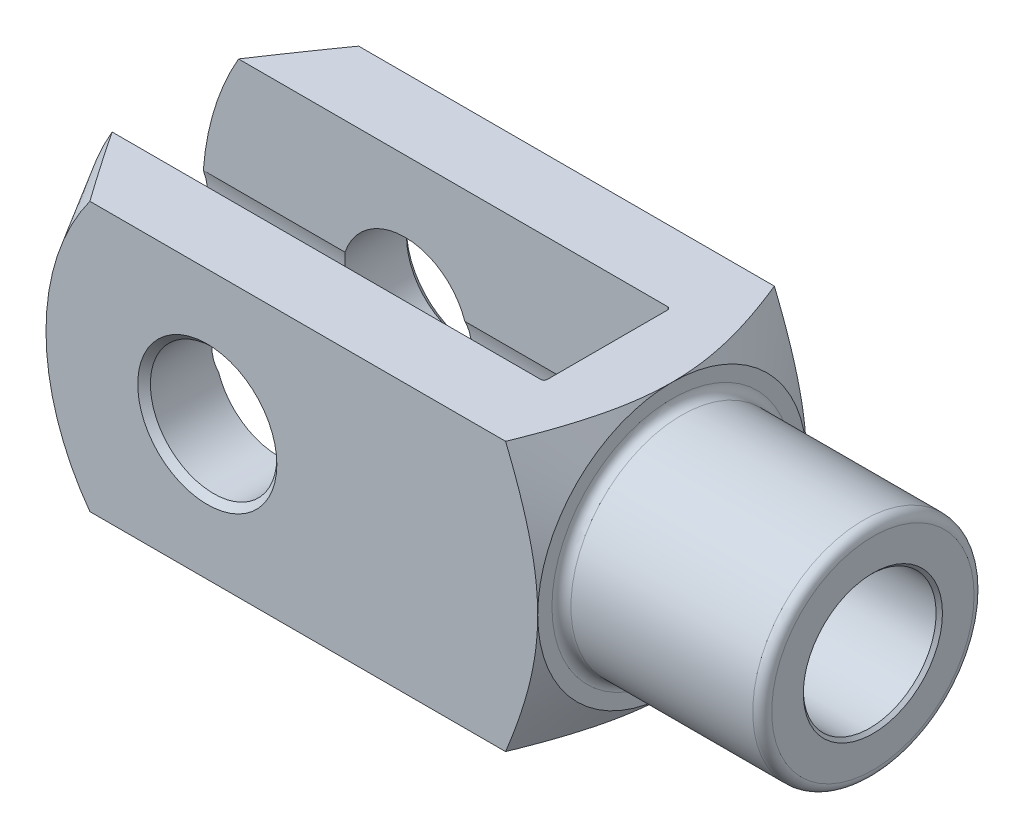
ISO-10303-21;
HEADER;
FILE_DESCRIPTION(('STEP AP214'),'2;1');
FILE_NAME('part.step','',(''),(''),'','','');
FILE_SCHEMA(('AUTOMOTIVE_DESIGN { 1 0 10303 214 1 1 1 1 }'));
ENDSEC;
DATA;
#1=APPLICATION_CONTEXT('core data for automotive mechanical design processes');
#2=APPLICATION_PROTOCOL_DEFINITION('international standard','automotive_design',2000,#1);
#3=PRODUCT_CONTEXT('',#1,'mechanical');
#4=PRODUCT('Part','Part','',(#3));
#5=PRODUCT_RELATED_PRODUCT_CATEGORY('part','',(#4));
#6=PRODUCT_DEFINITION_FORMATION('','',#4);
#7=PRODUCT_DEFINITION_CONTEXT('part definition',#1,'design');
#8=PRODUCT_DEFINITION('design','',#6,#7);
#9=PRODUCT_DEFINITION_SHAPE('','',#8);
#10=(LENGTH_UNIT() NAMED_UNIT(*) SI_UNIT(.MILLI.,.METRE.));
#11=(NAMED_UNIT(*) PLANE_ANGLE_UNIT() SI_UNIT($,.RADIAN.));
#12=(NAMED_UNIT(*) SI_UNIT($,.STERADIAN.) SOLID_ANGLE_UNIT());
#13=UNCERTAINTY_MEASURE_WITH_UNIT(LENGTH_MEASURE(1.E-05),#10,'distance_accuracy_value','');
#14=(GEOMETRIC_REPRESENTATION_CONTEXT(3) GLOBAL_UNCERTAINTY_ASSIGNED_CONTEXT((#13)) GLOBAL_UNIT_ASSIGNED_CONTEXT((#10,
#11,#12)) REPRESENTATION_CONTEXT('',''));
#15=CARTESIAN_POINT('',(0.,0.,0.));
#16=DIRECTION('',(0.,0.,1.));
#17=DIRECTION('',(1.,0.,0.));
#18=AXIS2_PLACEMENT_3D('',#15,#16,#17);
#19=CARTESIAN_POINT('',(-232.,-42.5,-20.));
#20=DIRECTION('',(0.,0.,-1.));
#21=DIRECTION('',(-1.,0.,0.));
#22=AXIS2_PLACEMENT_3D('',#19,#20,#21);
#23=PLANE('',#22);
#24=CARTESIAN_POINT('',(-147.,0.,-20.));
#25=DIRECTION('',(0.,0.,1.));
#26=DIRECTION('',(1.,0.,0.));
#27=AXIS2_PLACEMENT_3D('',#24,#25,#26);
#28=CIRCLE('',#27,85.);
#29=CARTESIAN_POINT('',(-220.612159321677,42.5,-20.));
#30=VERTEX_POINT('',#29);
#31=CARTESIAN_POINT('',(-231.758480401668,6.40312423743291,-20.));
#32=VERTEX_POINT('',#31);
#33=EDGE_CURVE('E217',#30,#32,#28,.T.);
#34=ORIENTED_EDGE('',*,*,#33,.T.);
#35=DIRECTION('',(1.,0.,0.));
#36=VECTOR('',#35,1.);
#37=CARTESIAN_POINT('',(-232.,6.40312423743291,-20.));
#38=LINE('',#37,#36);
#39=CARTESIAN_POINT('',(-186.947295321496,6.40312423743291,-20.));
#40=VERTEX_POINT('',#39);
#41=EDGE_CURVE('E192',#32,#40,#38,.T.);
#42=ORIENTED_EDGE('',*,*,#41,.T.);
#43=CARTESIAN_POINT('',(-168.,0.,-20.));
#44=DIRECTION('',(0.,0.,-1.));
#45=DIRECTION('',(-1.,0.,0.));
#46=AXIS2_PLACEMENT_3D('',#43,#44,#45);
#47=CIRCLE('',#46,20.);
#48=CARTESIAN_POINT('',(-149.052704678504,6.40312423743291,-20.));
#49=VERTEX_POINT('',#48);
#50=EDGE_CURVE('E626',#49,#40,#47,.F.);
#51=ORIENTED_EDGE('',*,*,#50,.F.);
#52=CARTESIAN_POINT('',(-85.,6.40312423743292,-20.));
#53=VERTEX_POINT('',#52);
#54=EDGE_CURVE('E323',#49,#53,#38,.T.);
#55=ORIENTED_EDGE('',*,*,#54,.T.);
#56=DIRECTION('',(0.,1.,0.));
#57=VECTOR('',#56,1.);
#58=CARTESIAN_POINT('',(-85.,42.5,-20.));
#59=LINE('',#58,#57);
#60=CARTESIAN_POINT('',(-85.,42.5,-20.));
#61=VERTEX_POINT('',#60);
#62=EDGE_CURVE('E421',#53,#61,#59,.T.);
#63=ORIENTED_EDGE('',*,*,#62,.T.);
#64=DIRECTION('',(-1.,0.,0.));
#65=VECTOR('',#64,1.);
#66=CARTESIAN_POINT('',(-232.,42.5,-20.));
#67=LINE('',#66,#65);
#68=EDGE_CURVE('E654',#61,#30,#67,.T.);
#69=ORIENTED_EDGE('',*,*,#68,.T.);
#70=EDGE_LOOP('',(#34,#42,#51,#55,#63,#69));
#71=FACE_BOUND('',#70,.T.);
#72=ADVANCED_FACE('F37',(#71),#23,.F.);
#73=CARTESIAN_POINT('',(-232.,-42.5,20.));
#74=DIRECTION('',(0.,0.,1.));
#75=DIRECTION('',(1.,0.,0.));
#76=AXIS2_PLACEMENT_3D('',#73,#74,#75);
#77=PLANE('',#76);
#78=CARTESIAN_POINT('',(-147.,0.,20.));
#79=DIRECTION('',(0.,0.,1.));
#80=DIRECTION('',(1.,0.,0.));
#81=AXIS2_PLACEMENT_3D('',#78,#79,#80);
#82=CIRCLE('',#81,85.);
#83=CARTESIAN_POINT('',(-231.758480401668,-6.40312423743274,20.));
#84=VERTEX_POINT('',#83);
#85=CARTESIAN_POINT('',(-220.612159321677,-42.5,20.));
#86=VERTEX_POINT('',#85);
#87=EDGE_CURVE('E934',#84,#86,#82,.T.);
#88=ORIENTED_EDGE('',*,*,#87,.F.);
#89=DIRECTION('',(1.,0.,0.));
#90=VECTOR('',#89,1.);
#91=CARTESIAN_POINT('',(-232.,-6.40312423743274,20.));
#92=LINE('',#91,#90);
#93=CARTESIAN_POINT('',(-186.947295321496,-6.40312423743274,20.));
#94=VERTEX_POINT('',#93);
#95=EDGE_CURVE('E61',#84,#94,#92,.T.);
#96=ORIENTED_EDGE('',*,*,#95,.T.);
#97=CARTESIAN_POINT('',(-168.,0.,20.));
#98=DIRECTION('',(0.,0.,1.));
#99=DIRECTION('',(1.,0.,0.));
#100=AXIS2_PLACEMENT_3D('',#97,#98,#99);
#101=CIRCLE('',#100,20.);
#102=CARTESIAN_POINT('',(-149.052704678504,-6.4031242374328,20.));
#103=VERTEX_POINT('',#102);
#104=EDGE_CURVE('E622',#103,#94,#101,.F.);
#105=ORIENTED_EDGE('',*,*,#104,.F.);
#106=CARTESIAN_POINT('',(-85.,-6.40312423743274,20.));
#107=VERTEX_POINT('',#106);
#108=EDGE_CURVE('E286',#103,#107,#92,.T.);
#109=ORIENTED_EDGE('',*,*,#108,.T.);
#110=DIRECTION('',(0.,1.,0.));
#111=VECTOR('',#110,1.);
#112=CARTESIAN_POINT('',(-85.,-42.5,20.));
#113=LINE('',#112,#111);
#114=CARTESIAN_POINT('',(-85.,-42.5,20.));
#115=VERTEX_POINT('',#114);
#116=EDGE_CURVE('E406',#107,#115,#113,.F.);
#117=ORIENTED_EDGE('',*,*,#116,.T.);
#118=DIRECTION('',(1.,0.,0.));
#119=VECTOR('',#118,1.);
#120=CARTESIAN_POINT('',(-232.,-42.5,20.));
#121=LINE('',#120,#119);
#122=EDGE_CURVE('E647',#86,#115,#121,.T.);
#123=ORIENTED_EDGE('',*,*,#122,.F.);
#124=EDGE_LOOP('',(#88,#96,#105,#109,#117,#123));
#125=FACE_BOUND('',#124,.T.);
#126=ADVANCED_FACE('F383',(#125),#77,.F.);
#127=CARTESIAN_POINT('',(-85.,-42.5,-19.));
#128=DIRECTION('',(0.,-1.,0.));
#129=DIRECTION('',(0.,0.,-1.));
#130=AXIS2_PLACEMENT_3D('',#127,#128,#129);
#131=CYLINDRICAL_SURFACE('',#130,1.);
#132=DIRECTION('',(0.,1.,0.));
#133=VECTOR('',#132,1.);
#134=CARTESIAN_POINT('',(-84.,-42.5,-19.));
#135=LINE('',#134,#133);
#136=CARTESIAN_POINT('',(-84.,-8.94427190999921,-19.));
#137=VERTEX_POINT('',#136);
#138=CARTESIAN_POINT('',(-84.,-42.5,-19.));
#139=VERTEX_POINT('',#138);
#140=EDGE_CURVE('E615',#137,#139,#135,.F.);
#141=ORIENTED_EDGE('',*,*,#140,.F.);
#142=CARTESIAN_POINT('',(-84.,-8.9442719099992,-19.));
#143=CARTESIAN_POINT('',(-84.0000146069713,-8.87099326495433,-19.0344972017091));
#144=CARTESIAN_POINT('',(-84.0017850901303,-8.79752099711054,-19.0685653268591));
#145=CARTESIAN_POINT('',(-84.0086826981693,-8.65031968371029,-19.1357911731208));
#146=CARTESIAN_POINT('',(-84.0138097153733,-8.57659064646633,-19.1689489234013));
#147=CARTESIAN_POINT('',(-84.0272983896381,-8.42863861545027,-19.2344647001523));
#148=CARTESIAN_POINT('',(-84.0356758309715,-8.35441497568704,-19.2668179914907));
#149=CARTESIAN_POINT('',(-84.0556084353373,-8.20596076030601,-19.3305129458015));
#150=CARTESIAN_POINT('',(-84.0671635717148,-8.13173018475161,-19.3618546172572));
#151=CARTESIAN_POINT('',(-84.0934874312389,-7.98334368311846,-19.4235085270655));
#152=CARTESIAN_POINT('',(-84.108258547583,-7.90918785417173,-19.4538199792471));
#153=CARTESIAN_POINT('',(-84.1411419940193,-7.76117646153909,-19.5133416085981));
#154=CARTESIAN_POINT('',(-84.1592541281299,-7.68732088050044,-19.5425518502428));
#155=CARTESIAN_POINT('',(-84.1990583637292,-7.54028269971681,-19.5997537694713));
#156=CARTESIAN_POINT('',(-84.2207431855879,-7.46709904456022,-19.6277477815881));
#157=CARTESIAN_POINT('',(-84.2681982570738,-7.32160732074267,-19.6824819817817));
#158=CARTESIAN_POINT('',(-84.2939666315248,-7.24929886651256,-19.7092227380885));
#159=CARTESIAN_POINT('',(-84.3324780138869,-7.15169945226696,-19.7447198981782));
#160=CARTESIAN_POINT('',(-84.34307183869,-7.12577686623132,-19.7540896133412));
#161=CARTESIAN_POINT('',(-84.364981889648,-7.07416621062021,-19.7726306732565));
#162=CARTESIAN_POINT('',(-84.3762981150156,-7.04847814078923,-19.7818020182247));
#163=CARTESIAN_POINT('',(-84.4114974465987,-6.97171556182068,-19.8090417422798));
#164=CARTESIAN_POINT('',(-84.4365809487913,-6.92107236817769,-19.8267886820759));
#165=CARTESIAN_POINT('',(-84.4935830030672,-6.81642602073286,-19.8630231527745));
#166=CARTESIAN_POINT('',(-84.5259391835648,-6.76261292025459,-19.8813991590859));
#167=CARTESIAN_POINT('',(-84.57959446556,-6.68507188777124,-19.9075504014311));
#168=CARTESIAN_POINT('',(-84.5983005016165,-6.65979096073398,-19.9160201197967));
#169=CARTESIAN_POINT('',(-84.6378207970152,-6.61074133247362,-19.9323546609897));
#170=CARTESIAN_POINT('',(-84.6586325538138,-6.5869708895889,-19.940220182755));
#171=CARTESIAN_POINT('',(-84.6983575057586,-6.54630742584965,-19.9536016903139));
#172=CARTESIAN_POINT('',(-84.716791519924,-6.52900080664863,-19.9592695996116));
#173=CARTESIAN_POINT('',(-84.7556352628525,-6.49643630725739,-19.9698925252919));
#174=CARTESIAN_POINT('',(-84.7760457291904,-6.48117919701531,-19.9748472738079));
#175=CARTESIAN_POINT('',(-84.8159289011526,-6.45571009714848,-19.9830918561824));
#176=CARTESIAN_POINT('',(-84.8351057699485,-6.44508701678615,-19.9865190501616));
#177=CARTESIAN_POINT('',(-84.8749821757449,-6.42695467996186,-19.9923571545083));
#178=CARTESIAN_POINT('',(-84.8956747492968,-6.41943212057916,-19.9947724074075));
#179=CARTESIAN_POINT('',(-84.9304153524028,-6.41040624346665,-19.9976675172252));
#180=CARTESIAN_POINT('',(-84.944122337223,-6.4077075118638,-19.9985322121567));
#181=CARTESIAN_POINT('',(-84.9718776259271,-6.40405186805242,-19.999703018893));
#182=CARTESIAN_POINT('',(-84.9859275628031,-6.40310632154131,-20.00000548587));
#183=CARTESIAN_POINT('',(-85.,-6.40312423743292,-20.));
#184=B_SPLINE_CURVE_WITH_KNOTS('',3,(#142,#143,#144,#145,#146,#147,#148,#149,#150,#151,#152,
#153,#154,#155,#156,#157,#158,#159,#160,#161,#162,#163,#164,#165,#166,#167,#168,#169,#170,#171,
#172,#173,#174,#175,#176,#177,#178,#179,#180,#181,#182,#183),.UNSPECIFIED.,.F.,.F.,(4,2,2,2,2,2,
2,2,2,2,2,2,2,2,2,2,2,2,2,2,4),(0.,0.242946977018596,0.485886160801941,0.730020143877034,
0.974152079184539,1.21846631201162,1.46276621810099,1.70657436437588,1.95027087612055,
2.03885173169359,2.12743249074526,2.30503385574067,2.50089938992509,2.59853343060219,
2.6960527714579,2.773672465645,2.85132123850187,2.91766922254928,2.98372949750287,
3.02560352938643,3.06774808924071),.UNSPECIFIED.);
#185=CARTESIAN_POINT('',(-85.,-6.40312423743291,-20.));
#186=VERTEX_POINT('',#185);
#187=EDGE_CURVE('E343',#137,#186,#184,.T.);
#188=ORIENTED_EDGE('',*,*,#187,.T.);
#189=CARTESIAN_POINT('',(-85.,-42.5,-20.));
#190=VERTEX_POINT('',#189);
#191=EDGE_CURVE('E427',#190,#186,#59,.T.);
#192=ORIENTED_EDGE('',*,*,#191,.F.);
#193=CARTESIAN_POINT('',(-85.,-42.5,-19.));
#194=DIRECTION('',(0.,-1.,0.));
#195=DIRECTION('',(0.,0.,-1.));
#196=AXIS2_PLACEMENT_3D('',#193,#194,#195);
#197=CIRCLE('',#196,1.);
#198=EDGE_CURVE('E438',#139,#190,#197,.F.);
#199=ORIENTED_EDGE('',*,*,#198,.F.);
#200=EDGE_LOOP('',(#141,#188,#192,#199));
#201=FACE_BOUND('',#200,.T.);
#202=ADVANCED_FACE('F362',(#201),#131,.F.);
#203=CARTESIAN_POINT('',(-84.,-42.5,-20.));
#204=DIRECTION('',(1.,0.,0.));
#205=DIRECTION('',(0.,0.,-1.));
#206=AXIS2_PLACEMENT_3D('',#203,#204,#205);
#207=PLANE('',#206);
#208=CARTESIAN_POINT('',(-84.,42.5,-19.));
#209=VERTEX_POINT('',#208);
#210=CARTESIAN_POINT('',(-84.,8.94427190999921,-19.));
#211=VERTEX_POINT('',#210);
#212=EDGE_CURVE('E628',#209,#211,#135,.F.);
#213=ORIENTED_EDGE('',*,*,#212,.T.);
#214=CARTESIAN_POINT('',(-84.,0.,0.));
#215=DIRECTION('',(1.,0.,0.));
#216=DIRECTION('',(0.,0.,-1.));
#217=AXIS2_PLACEMENT_3D('',#214,#215,#216);
#218=CIRCLE('',#217,21.);
#219=CARTESIAN_POINT('',(-84.,8.94427190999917,19.));
#220=VERTEX_POINT('',#219);
#221=EDGE_CURVE('E929',#211,#220,#218,.T.);
#222=ORIENTED_EDGE('',*,*,#221,.T.);
#223=DIRECTION('',(0.,1.,0.));
#224=VECTOR('',#223,1.);
#225=CARTESIAN_POINT('',(-84.,42.5,19.));
#226=LINE('',#225,#224);
#227=CARTESIAN_POINT('',(-84.,42.5,19.));
#228=VERTEX_POINT('',#227);
#229=EDGE_CURVE('E423',#220,#228,#226,.T.);
#230=ORIENTED_EDGE('',*,*,#229,.T.);
#231=DIRECTION('',(0.,0.,-1.));
#232=VECTOR('',#231,1.);
#233=CARTESIAN_POINT('',(-84.,42.5,-20.));
#234=LINE('',#233,#232);
#235=EDGE_CURVE('E650',#228,#209,#234,.T.);
#236=ORIENTED_EDGE('',*,*,#235,.T.);
#237=EDGE_LOOP('',(#213,#222,#230,#236));
#238=FACE_BOUND('',#237,.T.);
#239=ADVANCED_FACE('F397',(#238),#207,.F.);
#240=CARTESIAN_POINT('',(-85.,-42.5,19.));
#241=DIRECTION('',(0.,-1.,0.));
#242=DIRECTION('',(0.,0.,-1.));
#243=AXIS2_PLACEMENT_3D('',#240,#241,#242);
#244=CYLINDRICAL_SURFACE('',#243,1.);
#245=ORIENTED_EDGE('',*,*,#116,.F.);
#246=CARTESIAN_POINT('',(-85.,-6.40312423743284,20.));
#247=CARTESIAN_POINT('',(-84.9796224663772,-6.40305683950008,20.000020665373));
#248=CARTESIAN_POINT('',(-84.959350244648,-6.40506661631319,19.9993782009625));
#249=CARTESIAN_POINT('',(-84.9198356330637,-6.41258393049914,19.9969695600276));
#250=CARTESIAN_POINT('',(-84.9005823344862,-6.41803835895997,19.9952204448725));
#251=CARTESIAN_POINT('',(-84.8583626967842,-6.43364018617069,19.9902063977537));
#252=CARTESIAN_POINT('',(-84.8357559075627,-6.44464579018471,19.9866633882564));
#253=CARTESIAN_POINT('',(-84.7925533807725,-6.46992523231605,19.9784946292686));
#254=CARTESIAN_POINT('',(-84.7719713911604,-6.48421947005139,19.9738621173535));
#255=CARTESIAN_POINT('',(-84.7170936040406,-6.5272893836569,19.9598428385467));
#256=CARTESIAN_POINT('',(-84.6849689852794,-6.55851508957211,19.9496132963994));
#257=CARTESIAN_POINT('',(-84.625456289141,-6.6246571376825,19.9277483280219));
#258=CARTESIAN_POINT('',(-84.5980795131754,-6.65958197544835,19.9161096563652));
#259=CARTESIAN_POINT('',(-84.5336867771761,-6.75008557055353,19.8856639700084));
#260=CARTESIAN_POINT('',(-84.498942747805,-6.80705868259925,19.8662456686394));
#261=CARTESIAN_POINT('',(-84.4349863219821,-6.92357815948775,19.8259401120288));
#262=CARTESIAN_POINT('',(-84.4057861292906,-6.98312985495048,19.8050497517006));
#263=CARTESIAN_POINT('',(-84.351416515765,-7.10421819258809,19.7619393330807));
#264=CARTESIAN_POINT('',(-84.3262825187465,-7.16576719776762,19.7397096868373));
#265=CARTESIAN_POINT('',(-84.2795429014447,-7.28974419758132,19.6942628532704));
#266=CARTESIAN_POINT('',(-84.2579341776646,-7.35217136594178,19.6710465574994));
#267=CARTESIAN_POINT('',(-84.2172549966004,-7.47907555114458,19.6231529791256));
#268=CARTESIAN_POINT('',(-84.1982541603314,-7.54356673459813,19.5984543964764));
#269=CARTESIAN_POINT('',(-84.1630620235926,-7.67296691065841,19.54815597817));
#270=CARTESIAN_POINT('',(-84.1468711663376,-7.7378759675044,19.5225560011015));
#271=CARTESIAN_POINT('',(-84.1021649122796,-7.93311023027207,19.4444184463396));
#272=CARTESIAN_POINT('',(-84.077551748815,-8.06382716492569,19.3905867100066));
#273=CARTESIAN_POINT('',(-84.0389415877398,-8.31997520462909,19.2820270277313));
#274=CARTESIAN_POINT('',(-84.0245483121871,-8.44540177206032,19.2274277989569));
#275=CARTESIAN_POINT('',(-84.0099522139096,-8.63302659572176,19.1435507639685));
#276=CARTESIAN_POINT('',(-84.006252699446,-8.69542042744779,19.1152912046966));
#277=CARTESIAN_POINT('',(-84.001279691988,-8.82001198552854,19.0581239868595));
#278=CARTESIAN_POINT('',(-84.0000063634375,-8.88220969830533,19.0292162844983));
#279=CARTESIAN_POINT('',(-84.,-8.94427190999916,19.));
#280=B_SPLINE_CURVE_WITH_KNOTS('',3,(#246,#247,#248,#249,#250,#251,#252,#253,#254,#255,#256,
#257,#258,#259,#260,#261,#262,#263,#264,#265,#266,#267,#268,#269,#270,#271,#272,#273,#274,#275,
#276,#277,#278,#279),.UNSPECIFIED.,.F.,.F.,(4,2,2,2,2,2,2,2,2,2,2,2,2,2,2,2,4),(0.,
0.0608550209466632,0.120793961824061,0.1965373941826,0.272763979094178,0.409851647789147,
0.547261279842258,0.755252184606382,0.963695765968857,1.17386743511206,1.38385306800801,
1.59865706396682,1.81349490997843,2.24355474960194,2.65586250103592,2.86160661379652,
3.06736467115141),.UNSPECIFIED.);
#281=CARTESIAN_POINT('',(-84.,-8.94427190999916,19.));
#282=VERTEX_POINT('',#281);
#283=EDGE_CURVE('E335',#107,#282,#280,.T.);
#284=ORIENTED_EDGE('',*,*,#283,.T.);
#285=CARTESIAN_POINT('',(-84.,-42.5,19.));
#286=VERTEX_POINT('',#285);
#287=EDGE_CURVE('E415',#286,#282,#226,.T.);
#288=ORIENTED_EDGE('',*,*,#287,.F.);
#289=CARTESIAN_POINT('',(-85.,-42.5,19.));
#290=DIRECTION('',(0.,-1.,0.));
#291=DIRECTION('',(0.,0.,-1.));
#292=AXIS2_PLACEMENT_3D('',#289,#290,#291);
#293=CIRCLE('',#292,1.);
#294=EDGE_CURVE('E409',#115,#286,#293,.F.);
#295=ORIENTED_EDGE('',*,*,#294,.F.);
#296=EDGE_LOOP('',(#245,#284,#288,#295));
#297=FACE_BOUND('',#296,.T.);
#298=ADVANCED_FACE('F353',(#297),#244,.F.);
#299=ORIENTED_EDGE('',*,*,#191,.T.);
#300=DIRECTION('',(1.,0.,0.));
#301=VECTOR('',#300,1.);
#302=CARTESIAN_POINT('',(-232.,-6.40312423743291,-20.));
#303=LINE('',#302,#301);
#304=CARTESIAN_POINT('',(-149.052704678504,-6.40312423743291,-20.));
#305=VERTEX_POINT('',#304);
#306=EDGE_CURVE('E211',#186,#305,#303,.F.);
#307=ORIENTED_EDGE('',*,*,#306,.T.);
#308=CARTESIAN_POINT('',(-186.947295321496,-6.40312423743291,-20.));
#309=VERTEX_POINT('',#308);
#310=EDGE_CURVE('E208',#309,#305,#47,.F.);
#311=ORIENTED_EDGE('',*,*,#310,.F.);
#312=CARTESIAN_POINT('',(-231.758480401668,-6.40312423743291,-20.));
#313=VERTEX_POINT('',#312);
#314=EDGE_CURVE('E189',#309,#313,#303,.F.);
#315=ORIENTED_EDGE('',*,*,#314,.T.);
#316=CARTESIAN_POINT('',(-220.612159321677,-42.5,-20.));
#317=VERTEX_POINT('',#316);
#318=EDGE_CURVE('E204',#313,#317,#28,.T.);
#319=ORIENTED_EDGE('',*,*,#318,.T.);
#320=DIRECTION('',(-1.,0.,0.));
#321=VECTOR('',#320,1.);
#322=CARTESIAN_POINT('',(-232.,-42.5,-20.));
#323=LINE('',#322,#321);
#324=EDGE_CURVE('E554',#190,#317,#323,.T.);
#325=ORIENTED_EDGE('',*,*,#324,.F.);
#326=EDGE_LOOP('',(#299,#307,#311,#315,#319,#325));
#327=FACE_BOUND('',#326,.T.);
#328=ADVANCED_FACE('F202',(#327),#23,.F.);
#329=CARTESIAN_POINT('',(-85.,42.5,20.));
#330=VERTEX_POINT('',#329);
#331=CARTESIAN_POINT('',(-85.,6.40312423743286,20.));
#332=VERTEX_POINT('',#331);
#333=EDGE_CURVE('E414',#330,#332,#113,.F.);
#334=ORIENTED_EDGE('',*,*,#333,.T.);
#335=DIRECTION('',(1.,0.,0.));
#336=VECTOR('',#335,1.);
#337=CARTESIAN_POINT('',(-232.,6.40312423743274,20.));
#338=LINE('',#337,#336);
#339=CARTESIAN_POINT('',(-149.052704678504,6.40312423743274,20.));
#340=VERTEX_POINT('',#339);
#341=EDGE_CURVE('E53',#332,#340,#338,.F.);
#342=ORIENTED_EDGE('',*,*,#341,.T.);
#343=CARTESIAN_POINT('',(-186.947295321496,6.40312423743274,20.));
#344=VERTEX_POINT('',#343);
#345=EDGE_CURVE('E627',#344,#340,#101,.F.);
#346=ORIENTED_EDGE('',*,*,#345,.F.);
#347=CARTESIAN_POINT('',(-231.758480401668,6.40312423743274,20.));
#348=VERTEX_POINT('',#347);
#349=EDGE_CURVE('E273',#344,#348,#338,.F.);
#350=ORIENTED_EDGE('',*,*,#349,.T.);
#351=CARTESIAN_POINT('',(-220.612159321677,42.5,20.));
#352=VERTEX_POINT('',#351);
#353=EDGE_CURVE('E935',#352,#348,#82,.T.);
#354=ORIENTED_EDGE('',*,*,#353,.F.);
#355=DIRECTION('',(1.,0.,0.));
#356=VECTOR('',#355,1.);
#357=CARTESIAN_POINT('',(-232.,42.5,20.));
#358=LINE('',#357,#356);
#359=EDGE_CURVE('E652',#352,#330,#358,.T.);
#360=ORIENTED_EDGE('',*,*,#359,.T.);
#361=EDGE_LOOP('',(#334,#342,#346,#350,#354,#360));
#362=FACE_BOUND('',#361,.T.);
#363=ADVANCED_FACE('F389',(#362),#77,.F.);
#364=CARTESIAN_POINT('',(-232.,-42.5,42.5));
#365=DIRECTION('',(0.,0.,1.));
#366=DIRECTION('',(1.,0.,0.));
#367=AXIS2_PLACEMENT_3D('',#364,#365,#366);
#368=PLANE('',#367);
#369=CARTESIAN_POINT('',(-168.,0.,42.5));
#370=DIRECTION('',(0.,0.,1.));
#371=DIRECTION('',(1.,0.,0.));
#372=AXIS2_PLACEMENT_3D('',#369,#370,#371);
#373=CIRCLE('',#372,21.9999999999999);
#374=CARTESIAN_POINT('',(-146.,0.,42.5));
#375=VERTEX_POINT('',#374);
#376=EDGE_CURVE('E469',#375,#375,#373,.F.);
#377=ORIENTED_EDGE('',*,*,#376,.T.);
#378=EDGE_LOOP('',(#377));
#379=FACE_BOUND('',#378,.T.);
#380=DIRECTION('',(1.,0.,0.));
#381=VECTOR('',#380,1.);
#382=CARTESIAN_POINT('',(-232.,42.5,42.5));
#383=LINE('',#382,#381);
#384=CARTESIAN_POINT('',(-205.130329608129,42.5,42.5));
#385=VERTEX_POINT('',#384);
#386=CARTESIAN_POINT('',(-73.6637182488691,42.5,42.5));
#387=VERTEX_POINT('',#386);
#388=EDGE_CURVE('E596',#385,#387,#383,.T.);
#389=ORIENTED_EDGE('',*,*,#388,.F.);
#390=CARTESIAN_POINT('',(-147.,0.,42.5));
#391=DIRECTION('',(0.,0.,1.));
#392=DIRECTION('',(1.,0.,0.));
#393=AXIS2_PLACEMENT_3D('',#390,#391,#392);
#394=CIRCLE('',#393,72.0096189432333);
#395=CARTESIAN_POINT('',(-205.130329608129,-42.5,42.5));
#396=VERTEX_POINT('',#395);
#397=EDGE_CURVE('E225',#385,#396,#394,.T.);
#398=ORIENTED_EDGE('',*,*,#397,.T.);
#399=DIRECTION('',(1.,0.,0.));
#400=VECTOR('',#399,1.);
#401=CARTESIAN_POINT('',(-232.,-42.5,42.5));
#402=LINE('',#401,#400);
#403=CARTESIAN_POINT('',(-73.6637182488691,-42.5,42.5));
#404=VERTEX_POINT('',#403);
#405=EDGE_CURVE('E603',#396,#404,#402,.T.);
#406=ORIENTED_EDGE('',*,*,#405,.T.);
#407=CARTESIAN_POINT('',(-94.7624622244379,-86.802185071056,42.5));
#408=CARTESIAN_POINT('',(-94.2194099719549,-85.7548832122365,42.5));
#409=CARTESIAN_POINT('',(-93.6778422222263,-84.706810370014,42.5));
#410=CARTESIAN_POINT('',(-92.5980017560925,-82.6089645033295,42.5));
#411=CARTESIAN_POINT('',(-92.0597290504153,-81.5591914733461,42.5));
#412=CARTESIAN_POINT('',(-90.9867800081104,-79.4577385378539,42.5));
#413=CARTESIAN_POINT('',(-90.4521038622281,-78.4060585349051,42.5));
#414=CARTESIAN_POINT('',(-89.3867656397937,-76.3006688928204,42.5));
#415=CARTESIAN_POINT('',(-88.8561035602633,-75.2469592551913,42.5));
#416=CARTESIAN_POINT('',(-87.2689305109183,-72.0788197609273,42.5));
#417=CARTESIAN_POINT('',(-86.2191025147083,-69.9610344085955,42.5));
#418=CARTESIAN_POINT('',(-84.1415102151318,-65.7146875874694,42.5));
#419=CARTESIAN_POINT('',(-83.1137455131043,-63.5861263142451,42.5));
#420=CARTESIAN_POINT('',(-81.5617563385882,-60.3176996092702,42.5));
#421=CARTESIAN_POINT('',(-81.0275478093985,-59.1825730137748,42.5));
#422=CARTESIAN_POINT('',(-79.9680476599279,-56.9081600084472,42.5));
#423=CARTESIAN_POINT('',(-79.442756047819,-55.7688735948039,42.5));
#424=CARTESIAN_POINT('',(-78.4023058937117,-53.4855999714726,42.5));
#425=CARTESIAN_POINT('',(-77.8871479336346,-52.3416124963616,42.5));
#426=CARTESIAN_POINT('',(-76.8684714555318,-50.0484628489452,42.5));
#427=CARTESIAN_POINT('',(-76.3649529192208,-48.8993006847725,42.5));
#428=CARTESIAN_POINT('',(-75.3715128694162,-46.5957089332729,42.5));
#429=CARTESIAN_POINT('',(-74.8815854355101,-45.4412819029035,42.5));
#430=CARTESIAN_POINT('',(-73.9171459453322,-43.125985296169,42.5));
#431=CARTESIAN_POINT('',(-73.4426340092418,-41.9651156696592,42.5));
#432=CARTESIAN_POINT('',(-72.5114996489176,-39.6363326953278,42.5));
#433=CARTESIAN_POINT('',(-72.0548755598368,-38.4684200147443,42.5));
#434=CARTESIAN_POINT('',(-71.1623541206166,-36.1247217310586,42.5));
#435=CARTESIAN_POINT('',(-70.7264562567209,-34.9489363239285,42.5));
#436=CARTESIAN_POINT('',(-69.7868235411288,-32.3328103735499,42.5));
#437=CARTESIAN_POINT('',(-69.2888706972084,-30.8903806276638,42.5));
#438=CARTESIAN_POINT('',(-68.3357729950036,-27.9913739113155,42.5));
#439=CARTESIAN_POINT('',(-67.8806281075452,-26.5347969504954,42.5));
#440=CARTESIAN_POINT('',(-67.021661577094,-23.606572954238,42.5));
#441=CARTESIAN_POINT('',(-66.6178366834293,-22.1349268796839,42.5));
#442=CARTESIAN_POINT('',(-65.8711311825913,-19.1761541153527,42.5));
#443=CARTESIAN_POINT('',(-65.5282498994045,-17.6890275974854,42.5));
#444=CARTESIAN_POINT('',(-64.9209851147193,-14.7349663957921,42.5));
#445=CARTESIAN_POINT('',(-64.6549478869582,-13.2683771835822,42.5));
#446=CARTESIAN_POINT('',(-64.3138855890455,-11.059612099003,42.5));
#447=CARTESIAN_POINT('',(-64.2098605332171,-10.3218450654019,42.5));
#448=CARTESIAN_POINT('',(-64.0221574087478,-8.84373890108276,42.5));
#449=CARTESIAN_POINT('',(-63.9384783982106,-8.1033998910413,42.5));
#450=CARTESIAN_POINT('',(-63.7924057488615,-6.62108367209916,42.5));
#451=CARTESIAN_POINT('',(-63.7299989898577,-5.87910775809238,42.5));
#452=CARTESIAN_POINT('',(-63.627097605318,-4.3936309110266,42.5));
#453=CARTESIAN_POINT('',(-63.5866029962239,-3.65012997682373,42.5));
#454=CARTESIAN_POINT('',(-63.527999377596,-2.16226315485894,42.5));
#455=CARTESIAN_POINT('',(-63.5098897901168,-1.41789728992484,42.5));
#456=CARTESIAN_POINT('',(-63.4962705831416,0.0710389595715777,42.5));
#457=CARTESIAN_POINT('',(-63.5007608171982,0.81560934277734,42.5));
#458=CARTESIAN_POINT('',(-63.5311360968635,2.25000394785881,42.5));
#459=CARTESIAN_POINT('',(-63.5554376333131,2.93986229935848,42.5));
#460=CARTESIAN_POINT('',(-63.6231690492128,4.31866339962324,42.5));
#461=CARTESIAN_POINT('',(-63.6665996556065,5.00760611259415,42.5));
#462=CARTESIAN_POINT('',(-63.7721581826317,6.38402120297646,42.5));
#463=CARTESIAN_POINT('',(-63.8342851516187,7.07149365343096,42.5));
#464=CARTESIAN_POINT('',(-63.976638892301,8.44457134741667,42.5));
#465=CARTESIAN_POINT('',(-64.0568664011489,9.13017651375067,42.5));
#466=CARTESIAN_POINT('',(-64.3237239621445,11.1842300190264,42.5));
#467=CARTESIAN_POINT('',(-64.5364846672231,12.5493513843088,42.5));
#468=CARTESIAN_POINT('',(-65.0246976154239,15.2681897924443,42.5));
#469=CARTESIAN_POINT('',(-65.30015160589,16.6219065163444,42.5));
#470=CARTESIAN_POINT('',(-65.9148507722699,19.3558887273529,42.5));
#471=CARTESIAN_POINT('',(-66.2557115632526,20.7357885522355,42.5));
#472=CARTESIAN_POINT('',(-66.987473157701,23.482186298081,42.5));
#473=CARTESIAN_POINT('',(-67.3783744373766,24.8486840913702,42.5));
#474=CARTESIAN_POINT('',(-67.9965846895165,26.8886415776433,42.5));
#475=CARTESIAN_POINT('',(-68.207962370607,27.566989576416,42.5));
#476=CARTESIAN_POINT('',(-68.6405021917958,28.9205642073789,42.5));
#477=CARTESIAN_POINT('',(-68.861664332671,29.5957908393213,42.5));
#478=CARTESIAN_POINT('',(-69.3129567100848,30.9431916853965,42.5));
#479=CARTESIAN_POINT('',(-69.5430864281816,31.6153660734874,42.5));
#480=CARTESIAN_POINT('',(-70.0115928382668,32.956826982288,42.5));
#481=CARTESIAN_POINT('',(-70.2499695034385,33.6261135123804,42.5));
#482=CARTESIAN_POINT('',(-71.0159037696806,35.7387134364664,42.5));
#483=CARTESIAN_POINT('',(-71.5573694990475,37.1769980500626,42.5));
#484=CARTESIAN_POINT('',(-72.6696994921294,40.0421880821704,42.5));
#485=CARTESIAN_POINT('',(-73.2405655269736,41.4690928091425,42.5));
#486=CARTESIAN_POINT('',(-74.406949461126,44.3131447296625,42.5));
#487=CARTESIAN_POINT('',(-75.0024728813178,45.7302896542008,42.5));
#488=CARTESIAN_POINT('',(-76.2140693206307,48.5557146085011,42.5));
#489=CARTESIAN_POINT('',(-76.8301419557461,49.9639948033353,42.5));
#490=CARTESIAN_POINT('',(-78.0801587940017,52.7740443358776,42.5));
#491=CARTESIAN_POINT('',(-78.7141179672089,54.175807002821,42.5));
#492=CARTESIAN_POINT('',(-79.9967583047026,56.9725772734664,42.5));
#493=CARTESIAN_POINT('',(-80.6454395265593,58.3675848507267,42.5));
#494=CARTESIAN_POINT('',(-81.9552829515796,61.1515288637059,42.5));
#495=CARTESIAN_POINT('',(-82.616443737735,62.5404659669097,42.5));
#496=CARTESIAN_POINT('',(-83.9495345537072,65.3131546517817,42.5));
#497=CARTESIAN_POINT('',(-84.6214645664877,66.6969062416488,42.5));
#498=CARTESIAN_POINT('',(-85.9766807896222,69.4640622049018,42.5));
#499=CARTESIAN_POINT('',(-86.6599953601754,70.8474526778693,42.5));
#500=CARTESIAN_POINT('',(-88.0347375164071,73.6101941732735,42.5));
#501=CARTESIAN_POINT('',(-88.7261651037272,74.9895451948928,42.5));
#502=CARTESIAN_POINT('',(-90.1161082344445,77.7447032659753,42.5));
#503=CARTESIAN_POINT('',(-90.8146239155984,79.1205102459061,42.5));
#504=CARTESIAN_POINT('',(-92.2178630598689,81.8689559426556,42.5));
#505=CARTESIAN_POINT('',(-92.9225865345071,83.2415946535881,42.5));
#506=CARTESIAN_POINT('',(-95.0442272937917,87.353933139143,42.5));
#507=CARTESIAN_POINT('',(-96.4693069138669,90.0894231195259,42.5));
#508=CARTESIAN_POINT('',(-99.3365319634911,95.5514018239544,42.5));
#509=CARTESIAN_POINT('',(-100.778677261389,98.2778906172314,42.5));
#510=CARTESIAN_POINT('',(-103.461460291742,103.319219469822,42.5));
#511=CARTESIAN_POINT('',(-104.700217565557,105.635061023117,42.5));
#512=CARTESIAN_POINT('',(-107.186029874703,110.262287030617,42.5));
#513=CARTESIAN_POINT('',(-108.433084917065,112.573671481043,42.5));
#514=CARTESIAN_POINT('',(-110.93436948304,117.192973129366,42.5));
#515=CARTESIAN_POINT('',(-112.188599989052,119.500889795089,42.5));
#516=CARTESIAN_POINT('',(-114.70302010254,124.113474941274,42.5));
#517=CARTESIAN_POINT('',(-115.96320971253,126.418143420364,42.5));
#518=CARTESIAN_POINT('',(-118.481465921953,131.011484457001,42.5));
#519=CARTESIAN_POINT('',(-119.739503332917,133.300173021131,42.5));
#520=CARTESIAN_POINT('',(-122.259947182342,137.875143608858,42.5));
#521=CARTESIAN_POINT('',(-123.522353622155,140.16142563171,42.5));
#522=CARTESIAN_POINT('',(-126.050763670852,144.731527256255,42.5));
#523=CARTESIAN_POINT('',(-127.316766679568,147.015347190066,42.5));
#524=CARTESIAN_POINT('',(-129.852109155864,151.581131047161,42.5));
#525=CARTESIAN_POINT('',(-131.121448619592,153.863094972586,42.5));
#526=CARTESIAN_POINT('',(-132.392228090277,156.14425578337,42.5));
#527=B_SPLINE_CURVE_WITH_KNOTS('',3,(#407,#408,#409,#410,#411,#412,#413,#414,#415,#416,#417,
#418,#419,#420,#421,#422,#423,#424,#425,#426,#427,#428,#429,#430,#431,#432,#433,#434,#435,#436,
#437,#438,#439,#440,#441,#442,#443,#444,#445,#446,#447,#448,#449,#450,#451,#452,#453,#454,#455,
#456,#457,#458,#459,#460,#461,#462,#463,#464,#465,#466,#467,#468,#469,#470,#471,#472,#473,#474,
#475,#476,#477,#478,#479,#480,#481,#482,#483,#484,#485,#486,#487,#488,#489,#490,#491,#492,#493,
#494,#495,#496,#497,#498,#499,#500,#501,#502,#503,#504,#505,#506,#507,#508,#509,#510,#511,#512,
#513,#514,#515,#516,#517,#518,#519,#520,#521,#522,#523,#524,#525,#526),.UNSPECIFIED.,.F.,.F.,(4,
2,2,2,2,2,2,2,2,2,2,2,2,2,2,2,2,2,2,2,2,2,2,2,2,2,2,2,2,2,2,2,2,2,2,2,2,2,2,2,2,2,2,2,2,2,2,2,2,
2,2,2,2,2,2,2,2,2,2,4),(0.,3.53917010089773,7.0783517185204,10.6177195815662,14.1570848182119,
21.2481316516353,28.3390502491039,32.1026634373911,35.8662800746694,39.6301122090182,
43.3939384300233,47.1560984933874,50.9182878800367,54.6801262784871,58.4418713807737,
63.0191904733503,67.5965064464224,72.1735323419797,76.7505074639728,81.2200421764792,
83.4550010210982,85.6898563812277,87.9233308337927,90.1568069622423,92.3902254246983,
94.623629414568,96.6942218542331,98.7648929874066,100.835458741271,102.906108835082,
107.049107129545,111.192220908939,115.455253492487,119.718326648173,121.849823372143,
123.981320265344,126.112694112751,128.244061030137,132.8541145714,137.464446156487,
142.075815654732,146.687099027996,151.302363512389,155.917646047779,160.53240765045,
165.147161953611,169.7759750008,174.404788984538,179.033693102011,183.662605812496,
192.915832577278,202.168988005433,210.047977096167,217.926972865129,225.807074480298,
233.68717942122,241.522145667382,249.357114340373,257.19084450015,265.024565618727),.UNSPECIFIED.);
#528=CARTESIAN_POINT('',(-63.5,0.,42.5));
#529=VERTEX_POINT('',#528);
#530=EDGE_CURVE('E565',#529,#404,#527,.F.);
#531=ORIENTED_EDGE('',*,*,#530,.F.);
#532=EDGE_CURVE('E575',#387,#529,#527,.F.);
#533=ORIENTED_EDGE('',*,*,#532,.F.);
#534=EDGE_LOOP('',(#389,#398,#406,#531,#533));
#535=FACE_BOUND('',#534,.T.);
#536=ADVANCED_FACE('F395',(#379,#535),#368,.T.);
#537=CARTESIAN_POINT('',(-232.,-42.5,42.5));
#538=DIRECTION('',(0.,-1.,0.));
#539=DIRECTION('',(0.,0.,-1.));
#540=AXIS2_PLACEMENT_3D('',#537,#538,#539);
#541=PLANE('',#540);
#542=ORIENTED_EDGE('',*,*,#324,.T.);
#543=CARTESIAN_POINT('',(-254.35247907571,-42.5,32.7567161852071));
#544=CARTESIAN_POINT('',(-253.31388487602,-42.5,31.0841351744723));
#545=CARTESIAN_POINT('',(-252.273827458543,-42.5,29.4124620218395));
#546=CARTESIAN_POINT('',(-250.190503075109,-42.5,26.0711144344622));
#547=CARTESIAN_POINT('',(-249.147236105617,-42.5,24.4014400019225));
#548=CARTESIAN_POINT('',(-247.057190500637,-42.5,21.0642425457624));
#549=CARTESIAN_POINT('',(-246.01041179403,-42.5,19.3967195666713));
#550=CARTESIAN_POINT('',(-243.913034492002,-42.5,16.0640785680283));
#551=CARTESIAN_POINT('',(-242.862435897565,-42.5,14.3989605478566));
#552=CARTESIAN_POINT('',(-239.701717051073,-42.5,9.40337065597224));
#553=CARTESIAN_POINT('',(-237.585308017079,-42.5,6.07687316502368));
#554=CARTESIAN_POINT('',(-233.332217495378,-42.5,-0.56311179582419));
#555=CARTESIAN_POINT('',(-231.195536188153,-42.5,-3.87659938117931));
#556=CARTESIAN_POINT('',(-227.923187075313,-42.5,-8.90931929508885));
#557=CARTESIAN_POINT('',(-226.796611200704,-42.5,-10.6344649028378));
#558=CARTESIAN_POINT('',(-224.535772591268,-42.5,-14.0797103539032));
#559=CARTESIAN_POINT('',(-223.401509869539,-42.5,-15.7998102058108));
#560=CARTESIAN_POINT('',(-221.124290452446,-42.5,-19.234315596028));
#561=CARTESIAN_POINT('',(-219.981333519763,-42.5,-20.9487209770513));
#562=CARTESIAN_POINT('',(-217.685598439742,-42.5,-24.3709450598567));
#563=CARTESIAN_POINT('',(-216.53282030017,-42.5,-26.0787637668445));
#564=CARTESIAN_POINT('',(-214.217007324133,-42.5,-29.485406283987));
#565=CARTESIAN_POINT('',(-213.053981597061,-42.5,-31.1842362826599));
#566=CARTESIAN_POINT('',(-210.71509506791,-42.5,-34.5730543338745));
#567=CARTESIAN_POINT('',(-209.539234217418,-42.5,-36.2630423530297));
#568=CARTESIAN_POINT('',(-207.172741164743,-42.5,-39.6325313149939));
#569=CARTESIAN_POINT('',(-205.98210968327,-42.5,-41.3120327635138));
#570=CARTESIAN_POINT('',(-203.583588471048,-42.5,-44.6586542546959));
#571=CARTESIAN_POINT('',(-202.375698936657,-42.5,-46.3257744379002));
#572=CARTESIAN_POINT('',(-199.951891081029,-42.5,-49.6284182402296));
#573=CARTESIAN_POINT('',(-198.736176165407,-42.5,-51.2640909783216));
#574=CARTESIAN_POINT('',(-196.281158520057,-42.5,-54.5177456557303));
#575=CARTESIAN_POINT('',(-195.041855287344,-42.5,-56.1357272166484));
#576=CARTESIAN_POINT('',(-193.160786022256,-42.5,-58.5474028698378));
#577=CARTESIAN_POINT('',(-192.52958928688,-42.5,-59.3493486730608));
#578=CARTESIAN_POINT('',(-191.259398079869,-42.5,-60.9470372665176));
#579=CARTESIAN_POINT('',(-190.620403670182,-42.5,-61.7427801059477));
#580=CARTESIAN_POINT('',(-189.333849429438,-42.5,-63.3272506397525));
#581=CARTESIAN_POINT('',(-188.68629002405,-42.5,-64.1159786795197));
#582=CARTESIAN_POINT('',(-187.381659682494,-42.5,-65.6855352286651));
#583=CARTESIAN_POINT('',(-186.724588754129,-42.5,-66.4663637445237));
#584=CARTESIAN_POINT('',(-185.407479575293,-42.5,-68.0101249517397));
#585=CARTESIAN_POINT('',(-184.747561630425,-42.5,-68.7731601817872));
#586=CARTESIAN_POINT('',(-183.416244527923,-42.5,-70.2891663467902));
#587=CARTESIAN_POINT('',(-182.744845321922,-42.5,-71.0421372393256));
#588=CARTESIAN_POINT('',(-181.389028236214,-42.5,-72.536699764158));
#589=CARTESIAN_POINT('',(-180.704606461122,-42.5,-73.2782878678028));
#590=CARTESIAN_POINT('',(-179.321411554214,-42.5,-74.7479656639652));
#591=CARTESIAN_POINT('',(-178.622638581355,-42.5,-75.4760555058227));
#592=CARTESIAN_POINT('',(-177.210696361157,-42.5,-76.9146681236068));
#593=CARTESIAN_POINT('',(-176.497566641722,-42.5,-77.6252296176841));
#594=CARTESIAN_POINT('',(-175.053192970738,-42.5,-79.0278233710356));
#595=CARTESIAN_POINT('',(-174.321948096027,-42.5,-79.7198546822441));
#596=CARTESIAN_POINT('',(-172.839533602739,-42.5,-81.0813541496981));
#597=CARTESIAN_POINT('',(-172.088376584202,-42.5,-81.750835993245));
#598=CARTESIAN_POINT('',(-170.563189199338,-42.5,-83.0631215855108));
#599=CARTESIAN_POINT('',(-169.789162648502,-42.5,-83.705929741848));
#600=CARTESIAN_POINT('',(-168.610357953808,-42.5,-84.6445990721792));
#601=CARTESIAN_POINT('',(-168.215258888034,-42.5,-84.9526491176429));
#602=CARTESIAN_POINT('',(-167.418275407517,-42.5,-85.5598617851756));
#603=CARTESIAN_POINT('',(-167.016390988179,-42.5,-85.8590244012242));
#604=CARTESIAN_POINT('',(-166.205374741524,-42.5,-86.4475741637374));
#605=CARTESIAN_POINT('',(-165.796241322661,-42.5,-86.7369591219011));
#606=CARTESIAN_POINT('',(-164.970462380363,-42.5,-87.3047845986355));
#607=CARTESIAN_POINT('',(-164.553816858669,-42.5,-87.5832251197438));
#608=CARTESIAN_POINT('',(-163.292623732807,-42.5,-88.3999971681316));
#609=CARTESIAN_POINT('',(-162.436195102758,-42.5,-88.9202367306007));
#610=CARTESIAN_POINT('',(-160.689643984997,-42.5,-89.9008210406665));
#611=CARTESIAN_POINT('',(-159.799529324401,-42.5,-90.3611795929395));
#612=CARTESIAN_POINT('',(-158.172336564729,-42.5,-91.1206222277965));
#613=CARTESIAN_POINT('',(-157.441660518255,-42.5,-91.4333723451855));
#614=CARTESIAN_POINT('',(-155.959299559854,-42.5,-92.004696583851));
#615=CARTESIAN_POINT('',(-155.207616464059,-42.5,-92.2632753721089));
#616=CARTESIAN_POINT('',(-153.686531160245,-42.5,-92.7179511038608));
#617=CARTESIAN_POINT('',(-152.917154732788,-42.5,-92.9141334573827));
#618=CARTESIAN_POINT('',(-151.363858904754,-42.5,-93.237175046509));
#619=CARTESIAN_POINT('',(-150.579940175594,-42.5,-93.3640374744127));
#620=CARTESIAN_POINT('',(-148.996146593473,-42.5,-93.5438322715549));
#621=CARTESIAN_POINT('',(-148.196191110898,-42.5,-93.5960639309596));
#622=CARTESIAN_POINT('',(-146.595026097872,-42.5,-93.6218765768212));
#623=CARTESIAN_POINT('',(-145.793816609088,-42.5,-93.5954601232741));
#624=CARTESIAN_POINT('',(-144.197550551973,-42.5,-93.4652284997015));
#625=CARTESIAN_POINT('',(-143.402495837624,-42.5,-93.3613908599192));
#626=CARTESIAN_POINT('',(-141.825376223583,-42.5,-93.0809942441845));
#627=CARTESIAN_POINT('',(-141.043313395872,-42.5,-92.9044237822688));
#628=CARTESIAN_POINT('',(-139.337649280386,-42.5,-92.4423682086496));
#629=CARTESIAN_POINT('',(-138.418111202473,-42.5,-92.1419331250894));
#630=CARTESIAN_POINT('',(-136.609889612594,-42.5,-91.459727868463));
#631=CARTESIAN_POINT('',(-135.721216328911,-42.5,-91.0779310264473));
#632=CARTESIAN_POINT('',(-133.973451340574,-42.5,-90.2457653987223));
#633=CARTESIAN_POINT('',(-133.114459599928,-42.5,-89.795188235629));
#634=CARTESIAN_POINT('',(-131.849870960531,-42.5,-89.0779575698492));
#635=CARTESIAN_POINT('',(-131.432329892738,-42.5,-88.8319900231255));
#636=CARTESIAN_POINT('',(-130.604851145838,-42.5,-88.3275332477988));
#637=CARTESIAN_POINT('',(-130.19491367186,-42.5,-88.0690436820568));
#638=CARTESIAN_POINT('',(-129.239074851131,-42.5,-87.4476131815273));
#639=CARTESIAN_POINT('',(-128.696218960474,-42.5,-87.0799900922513));
#640=CARTESIAN_POINT('',(-127.623107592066,-42.5,-86.3267288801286));
#641=CARTESIAN_POINT('',(-127.092853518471,-42.5,-85.9410887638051));
#642=CARTESIAN_POINT('',(-126.043951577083,-42.5,-85.1539379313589));
#643=CARTESIAN_POINT('',(-125.525308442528,-42.5,-84.752420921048));
#644=CARTESIAN_POINT('',(-124.498982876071,-42.5,-83.935579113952));
#645=CARTESIAN_POINT('',(-123.991301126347,-42.5,-83.5202534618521));
#646=CARTESIAN_POINT('',(-122.98517708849,-42.5,-82.6766830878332));
#647=CARTESIAN_POINT('',(-122.486753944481,-42.5,-82.2484155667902));
#648=CARTESIAN_POINT('',(-121.499354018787,-42.5,-81.3811121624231));
#649=CARTESIAN_POINT('',(-121.010377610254,-42.5,-80.9420758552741));
#650=CARTESIAN_POINT('',(-119.556767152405,-42.5,-79.6109038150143));
#651=CARTESIAN_POINT('',(-118.605188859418,-42.5,-78.7044824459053));
#652=CARTESIAN_POINT('',(-116.725837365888,-42.5,-76.8555151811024));
#653=CARTESIAN_POINT('',(-115.798258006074,-42.5,-75.9127735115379));
#654=CARTESIAN_POINT('',(-113.968952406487,-42.5,-74.0025232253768));
#655=CARTESIAN_POINT('',(-113.067227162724,-42.5,-73.0350136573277));
#656=CARTESIAN_POINT('',(-111.287019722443,-42.5,-71.0807762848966));
#657=CARTESIAN_POINT('',(-110.40851386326,-42.5,-70.0940699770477));
#658=CARTESIAN_POINT('',(-108.670795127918,-42.5,-68.1038862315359));
#659=CARTESIAN_POINT('',(-107.811581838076,-42.5,-67.1004091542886));
#660=CARTESIAN_POINT('',(-105.847155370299,-42.5,-64.7672693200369));
#661=CARTESIAN_POINT('',(-104.747918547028,-42.5,-63.4325784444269));
#662=CARTESIAN_POINT('',(-102.57342223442,-42.5,-60.7434503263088));
#663=CARTESIAN_POINT('',(-101.498167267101,-42.5,-59.3890094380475));
#664=CARTESIAN_POINT('',(-99.3832528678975,-42.5,-56.6833254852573));
#665=CARTESIAN_POINT('',(-98.3433051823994,-42.5,-55.3323074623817));
#666=CARTESIAN_POINT('',(-96.7964058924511,-42.5,-53.2961990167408));
#667=CARTESIAN_POINT('',(-96.2830101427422,-42.5,-52.6159898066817));
#668=CARTESIAN_POINT('',(-95.2602204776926,-42.5,-51.2525772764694));
#669=CARTESIAN_POINT('',(-94.7508265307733,-42.5,-50.5693739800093));
#670=CARTESIAN_POINT('',(-94.2432838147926,-42.5,-49.8847971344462));
#671=B_SPLINE_CURVE_WITH_KNOTS('',3,(#543,#544,#545,#546,#547,#548,#549,#550,#551,#552,#553,
#554,#555,#556,#557,#558,#559,#560,#561,#562,#563,#564,#565,#566,#567,#568,#569,#570,#571,#572,
#573,#574,#575,#576,#577,#578,#579,#580,#581,#582,#583,#584,#585,#586,#587,#588,#589,#590,#591,
#592,#593,#594,#595,#596,#597,#598,#599,#600,#601,#602,#603,#604,#605,#606,#607,#608,#609,#610,
#611,#612,#613,#614,#615,#616,#617,#618,#619,#620,#621,#622,#623,#624,#625,#626,#627,#628,#629,
#630,#631,#632,#633,#634,#635,#636,#637,#638,#639,#640,#641,#642,#643,#644,#645,#646,#647,#648,
#649,#650,#651,#652,#653,#654,#655,#656,#657,#658,#659,#660,#661,#662,#663,#664,#665,#666,#667,
#668,#669,#670),.UNSPECIFIED.,.F.,.F.,(4,2,2,2,2,2,2,2,2,2,2,2,2,2,2,2,2,2,2,2,2,2,2,2,2,2,2,2,
2,2,2,2,2,2,2,2,2,2,2,2,2,2,2,2,2,2,2,2,2,2,2,2,2,2,2,2,2,2,2,2,2,2,2,4),(0.,5.90642428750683,
11.8128550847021,17.7194062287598,23.6259558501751,35.4539541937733,47.2818473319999,
53.463068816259,59.6442797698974,65.8256600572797,72.0070354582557,78.1833809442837,
84.3597497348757,90.5358183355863,96.7118167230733,102.825609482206,108.939532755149,
112.001149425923,115.062741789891,118.124182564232,121.185620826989,124.211974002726,
127.238339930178,130.265625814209,133.292878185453,136.312703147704,139.332682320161,
142.35079409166,145.368405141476,146.871293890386,148.374183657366,149.877407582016,
151.380631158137,154.384759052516,157.388193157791,159.770752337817,162.15310617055,
164.532184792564,166.911153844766,169.312315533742,171.713399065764,174.115179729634,
176.517339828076,179.414776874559,182.313165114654,185.220515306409,186.674152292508,
188.127828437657,190.094261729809,192.060913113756,194.028352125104,195.995913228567,
197.967169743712,199.938503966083,203.880139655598,207.847276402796,211.814565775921,
215.777642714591,219.740634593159,224.927520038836,230.115375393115,235.229955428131,
237.786569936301,240.343164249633),.UNSPECIFIED.);
#672=CARTESIAN_POINT('',(-205.130329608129,-42.5,-42.5));
#673=VERTEX_POINT('',#672);
#674=EDGE_CURVE('E214',#317,#673,#671,.T.);
#675=ORIENTED_EDGE('',*,*,#674,.T.);
#676=DIRECTION('',(1.,0.,0.));
#677=VECTOR('',#676,1.);
#678=CARTESIAN_POINT('',(-232.,-42.5,-42.5));
#679=LINE('',#678,#677);
#680=CARTESIAN_POINT('',(-73.6637182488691,-42.5,-42.5));
#681=VERTEX_POINT('',#680);
#682=EDGE_CURVE('E609',#673,#681,#679,.T.);
#683=ORIENTED_EDGE('',*,*,#682,.T.);
#684=CARTESIAN_POINT('',(-94.7624622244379,-42.5,-86.8021850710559));
#685=CARTESIAN_POINT('',(-94.2194099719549,-42.5,-85.7548832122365));
#686=CARTESIAN_POINT('',(-93.6778422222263,-42.5,-84.706810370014));
#687=CARTESIAN_POINT('',(-92.5980017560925,-42.5,-82.6089645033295));
#688=CARTESIAN_POINT('',(-92.0597290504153,-42.5,-81.5591914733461));
#689=CARTESIAN_POINT('',(-90.9867800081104,-42.5,-79.4577385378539));
#690=CARTESIAN_POINT('',(-90.4521038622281,-42.5,-78.406058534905));
#691=CARTESIAN_POINT('',(-89.3867656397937,-42.5,-76.3006688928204));
#692=CARTESIAN_POINT('',(-88.8561035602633,-42.5,-75.2469592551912));
#693=CARTESIAN_POINT('',(-87.2689305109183,-42.5,-72.0788197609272));
#694=CARTESIAN_POINT('',(-86.2191025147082,-42.5,-69.9610344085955));
#695=CARTESIAN_POINT('',(-84.1415102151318,-42.5,-65.7146875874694));
#696=CARTESIAN_POINT('',(-83.1137455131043,-42.5,-63.5861263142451));
#697=CARTESIAN_POINT('',(-81.5617563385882,-42.5,-60.3176996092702));
#698=CARTESIAN_POINT('',(-81.0275478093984,-42.5,-59.1825730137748));
#699=CARTESIAN_POINT('',(-79.9680476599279,-42.5,-56.9081600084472));
#700=CARTESIAN_POINT('',(-79.442756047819,-42.5,-55.7688735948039));
#701=CARTESIAN_POINT('',(-78.4023058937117,-42.5,-53.4855999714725));
#702=CARTESIAN_POINT('',(-77.8871479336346,-42.5,-52.3416124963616));
#703=CARTESIAN_POINT('',(-76.8684714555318,-42.5,-50.0484628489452));
#704=CARTESIAN_POINT('',(-76.3649529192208,-42.5,-48.8993006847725));
#705=CARTESIAN_POINT('',(-75.3715128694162,-42.5,-46.5957089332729));
#706=CARTESIAN_POINT('',(-74.8815854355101,-42.5,-45.4412819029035));
#707=CARTESIAN_POINT('',(-73.9171459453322,-42.5,-43.125985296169));
#708=CARTESIAN_POINT('',(-73.4426340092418,-42.5,-41.9651156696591));
#709=CARTESIAN_POINT('',(-72.5114996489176,-42.5,-39.6363326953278));
#710=CARTESIAN_POINT('',(-72.0548755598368,-42.5,-38.4684200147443));
#711=CARTESIAN_POINT('',(-71.1623541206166,-42.5,-36.1247217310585));
#712=CARTESIAN_POINT('',(-70.7264562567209,-42.5,-34.9489363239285));
#713=CARTESIAN_POINT('',(-69.7868235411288,-42.5,-32.3328103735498));
#714=CARTESIAN_POINT('',(-69.2888706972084,-42.5,-30.8903806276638));
#715=CARTESIAN_POINT('',(-68.3357729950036,-42.5,-27.9913739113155));
#716=CARTESIAN_POINT('',(-67.8806281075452,-42.5,-26.5347969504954));
#717=CARTESIAN_POINT('',(-67.021661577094,-42.5,-23.606572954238));
#718=CARTESIAN_POINT('',(-66.6178366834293,-42.5,-22.1349268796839));
#719=CARTESIAN_POINT('',(-65.8711311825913,-42.5,-19.1761541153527));
#720=CARTESIAN_POINT('',(-65.5282498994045,-42.5,-17.6890275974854));
#721=CARTESIAN_POINT('',(-64.9209851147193,-42.5,-14.7349663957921));
#722=CARTESIAN_POINT('',(-64.6549478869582,-42.5,-13.2683771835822));
#723=CARTESIAN_POINT('',(-64.3138855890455,-42.5,-11.0596120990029));
#724=CARTESIAN_POINT('',(-64.2098605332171,-42.5,-10.3218450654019));
#725=CARTESIAN_POINT('',(-64.0221574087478,-42.5,-8.84373890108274));
#726=CARTESIAN_POINT('',(-63.9384783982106,-42.5,-8.10339989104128));
#727=CARTESIAN_POINT('',(-63.7924057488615,-42.5,-6.62108367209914));
#728=CARTESIAN_POINT('',(-63.7299989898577,-42.5,-5.87910775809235));
#729=CARTESIAN_POINT('',(-63.627097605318,-42.5,-4.39363091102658));
#730=CARTESIAN_POINT('',(-63.5866029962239,-42.5,-3.65012997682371));
#731=CARTESIAN_POINT('',(-63.527999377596,-42.5,-2.16226315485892));
#732=CARTESIAN_POINT('',(-63.5098897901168,-42.5,-1.41789728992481));
#733=CARTESIAN_POINT('',(-63.4962705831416,-42.5,0.0710389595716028));
#734=CARTESIAN_POINT('',(-63.5007608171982,-42.5,0.815609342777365));
#735=CARTESIAN_POINT('',(-63.5311360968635,-42.5,2.25000394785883));
#736=CARTESIAN_POINT('',(-63.5554376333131,-42.5,2.93986229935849));
#737=CARTESIAN_POINT('',(-63.6231690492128,-42.5,4.31866339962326));
#738=CARTESIAN_POINT('',(-63.6665996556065,-42.5,5.00760611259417));
#739=CARTESIAN_POINT('',(-63.7721581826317,-42.5,6.38402120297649));
#740=CARTESIAN_POINT('',(-63.8342851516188,-42.5,7.071493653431));
#741=CARTESIAN_POINT('',(-63.976638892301,-42.5,8.4445713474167));
#742=CARTESIAN_POINT('',(-64.0568664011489,-42.5,9.1301765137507));
#743=CARTESIAN_POINT('',(-64.3237239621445,-42.5,11.1842300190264));
#744=CARTESIAN_POINT('',(-64.5364846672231,-42.5,12.5493513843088));
#745=CARTESIAN_POINT('',(-65.0246976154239,-42.5,15.2681897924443));
#746=CARTESIAN_POINT('',(-65.30015160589,-42.5,16.6219065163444));
#747=CARTESIAN_POINT('',(-65.9148507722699,-42.5,19.3558887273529));
#748=CARTESIAN_POINT('',(-66.2557115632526,-42.5,20.7357885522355));
#749=CARTESIAN_POINT('',(-66.987473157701,-42.5,23.482186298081));
#750=CARTESIAN_POINT('',(-67.3783744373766,-42.5,24.8486840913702));
#751=CARTESIAN_POINT('',(-67.9965846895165,-42.5,26.8886415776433));
#752=CARTESIAN_POINT('',(-68.207962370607,-42.5,27.566989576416));
#753=CARTESIAN_POINT('',(-68.6405021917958,-42.5,28.9205642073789));
#754=CARTESIAN_POINT('',(-68.861664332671,-42.5,29.5957908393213));
#755=CARTESIAN_POINT('',(-69.3129567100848,-42.5,30.9431916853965));
#756=CARTESIAN_POINT('',(-69.5430864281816,-42.5,31.6153660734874));
#757=CARTESIAN_POINT('',(-70.0115928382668,-42.5,32.956826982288));
#758=CARTESIAN_POINT('',(-70.2499695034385,-42.5,33.6261135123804));
#759=CARTESIAN_POINT('',(-71.0159037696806,-42.5,35.7387134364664));
#760=CARTESIAN_POINT('',(-71.5573694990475,-42.5,37.1769980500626));
#761=CARTESIAN_POINT('',(-72.6696994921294,-42.5,40.0421880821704));
#762=CARTESIAN_POINT('',(-73.2405655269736,-42.5,41.4690928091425));
#763=CARTESIAN_POINT('',(-74.406949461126,-42.5,44.3131447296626));
#764=CARTESIAN_POINT('',(-75.0024728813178,-42.5,45.7302896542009));
#765=CARTESIAN_POINT('',(-76.2140693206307,-42.5,48.5557146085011));
#766=CARTESIAN_POINT('',(-76.8301419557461,-42.5,49.9639948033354));
#767=CARTESIAN_POINT('',(-78.0801587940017,-42.5,52.7740443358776));
#768=CARTESIAN_POINT('',(-78.714117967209,-42.5,54.1758070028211));
#769=CARTESIAN_POINT('',(-79.9967583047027,-42.5,56.9725772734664));
#770=CARTESIAN_POINT('',(-80.6454395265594,-42.5,58.3675848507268));
#771=CARTESIAN_POINT('',(-81.9552829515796,-42.5,61.1515288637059));
#772=CARTESIAN_POINT('',(-82.6164437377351,-42.5,62.5404659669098));
#773=CARTESIAN_POINT('',(-83.9495345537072,-42.5,65.3131546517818));
#774=CARTESIAN_POINT('',(-84.6214645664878,-42.5,66.6969062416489));
#775=CARTESIAN_POINT('',(-85.9766807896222,-42.5,69.4640622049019));
#776=CARTESIAN_POINT('',(-86.6599953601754,-42.5,70.8474526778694));
#777=CARTESIAN_POINT('',(-88.0347375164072,-42.5,73.6101941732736));
#778=CARTESIAN_POINT('',(-88.7261651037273,-42.5,74.989545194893));
#779=CARTESIAN_POINT('',(-90.1161082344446,-42.5,77.7447032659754));
#780=CARTESIAN_POINT('',(-90.8146239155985,-42.5,79.1205102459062));
#781=CARTESIAN_POINT('',(-92.217863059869,-42.5,81.8689559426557));
#782=CARTESIAN_POINT('',(-92.9225865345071,-42.5,83.2415946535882));
#783=CARTESIAN_POINT('',(-95.0442272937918,-42.5,87.3539331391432));
#784=CARTESIAN_POINT('',(-96.469306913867,-42.5,90.0894231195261));
#785=CARTESIAN_POINT('',(-99.3365319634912,-42.5,95.5514018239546));
#786=CARTESIAN_POINT('',(-100.778677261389,-42.5,98.2778906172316));
#787=CARTESIAN_POINT('',(-103.461460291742,-42.5,103.319219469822));
#788=CARTESIAN_POINT('',(-104.700217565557,-42.5,105.635061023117));
#789=CARTESIAN_POINT('',(-107.186029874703,-42.5,110.262287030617));
#790=CARTESIAN_POINT('',(-108.433084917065,-42.5,112.573671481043));
#791=CARTESIAN_POINT('',(-110.934369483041,-42.5,117.192973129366));
#792=CARTESIAN_POINT('',(-112.188599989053,-42.5,119.500889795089));
#793=CARTESIAN_POINT('',(-114.70302010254,-42.5,124.113474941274));
#794=CARTESIAN_POINT('',(-115.96320971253,-42.5,126.418143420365));
#795=CARTESIAN_POINT('',(-118.481465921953,-42.5,131.011484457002));
#796=CARTESIAN_POINT('',(-119.739503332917,-42.5,133.300173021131));
#797=CARTESIAN_POINT('',(-122.259947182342,-42.5,137.875143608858));
#798=CARTESIAN_POINT('',(-123.522353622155,-42.5,140.16142563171));
#799=CARTESIAN_POINT('',(-126.050763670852,-42.5,144.731527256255));
#800=CARTESIAN_POINT('',(-127.316766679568,-42.5,147.015347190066));
#801=CARTESIAN_POINT('',(-129.852109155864,-42.5,151.581131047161));
#802=CARTESIAN_POINT('',(-131.121448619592,-42.5,153.863094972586));
#803=CARTESIAN_POINT('',(-132.392228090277,-42.5,156.14425578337));
#804=B_SPLINE_CURVE_WITH_KNOTS('',3,(#684,#685,#686,#687,#688,#689,#690,#691,#692,#693,#694,
#695,#696,#697,#698,#699,#700,#701,#702,#703,#704,#705,#706,#707,#708,#709,#710,#711,#712,#713,
#714,#715,#716,#717,#718,#719,#720,#721,#722,#723,#724,#725,#726,#727,#728,#729,#730,#731,#732,
#733,#734,#735,#736,#737,#738,#739,#740,#741,#742,#743,#744,#745,#746,#747,#748,#749,#750,#751,
#752,#753,#754,#755,#756,#757,#758,#759,#760,#761,#762,#763,#764,#765,#766,#767,#768,#769,#770,
#771,#772,#773,#774,#775,#776,#777,#778,#779,#780,#781,#782,#783,#784,#785,#786,#787,#788,#789,
#790,#791,#792,#793,#794,#795,#796,#797,#798,#799,#800,#801,#802,#803),.UNSPECIFIED.,.F.,.F.,(4,
2,2,2,2,2,2,2,2,2,2,2,2,2,2,2,2,2,2,2,2,2,2,2,2,2,2,2,2,2,2,2,2,2,2,2,2,2,2,2,2,2,2,2,2,2,2,2,2,
2,2,2,2,2,2,2,2,2,2,4),(0.,3.53917010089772,7.07835171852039,10.6177195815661,14.1570848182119,
21.2481316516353,28.3390502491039,32.102663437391,35.8662800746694,39.6301122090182,
43.3939384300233,47.1560984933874,50.9182878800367,54.680126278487,58.4418713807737,
63.0191904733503,67.5965064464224,72.1735323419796,76.7505074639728,81.2200421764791,
83.4550010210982,85.6898563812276,87.9233308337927,90.1568069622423,92.3902254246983,
94.623629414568,96.6942218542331,98.7648929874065,100.835458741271,102.906108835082,
107.049107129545,111.192220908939,115.455253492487,119.718326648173,121.849823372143,
123.981320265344,126.112694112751,128.244061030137,132.8541145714,137.464446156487,
142.075815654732,146.687099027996,151.30236351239,155.917646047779,160.53240765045,
165.147161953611,169.7759750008,174.404788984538,179.033693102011,183.662605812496,
192.915832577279,202.168988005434,210.047977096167,217.926972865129,225.807074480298,
233.68717942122,241.522145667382,249.357114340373,257.19084450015,265.024565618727),.UNSPECIFIED.);
#805=CARTESIAN_POINT('',(-63.5,-42.5,0.));
#806=VERTEX_POINT('',#805);
#807=EDGE_CURVE('E548',#806,#681,#804,.F.);
#808=ORIENTED_EDGE('',*,*,#807,.F.);
#809=EDGE_CURVE('E570',#404,#806,#804,.F.);
#810=ORIENTED_EDGE('',*,*,#809,.F.);
#811=ORIENTED_EDGE('',*,*,#405,.F.);
#812=CARTESIAN_POINT('',(-94.2432838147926,-42.5,49.884797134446));
#813=CARTESIAN_POINT('',(-94.6706456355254,-42.5,50.4612281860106));
#814=CARTESIAN_POINT('',(-95.0993217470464,-42.5,51.0366841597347));
#815=CARTESIAN_POINT('',(-95.959477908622,-42.5,52.1855009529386));
#816=CARTESIAN_POINT('',(-96.3909579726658,-42.5,52.7588617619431));
#817=CARTESIAN_POINT('',(-97.6899130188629,-42.5,54.4756444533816));
#818=CARTESIAN_POINT('',(-98.561851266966,-42.5,55.6156969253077));
#819=CARTESIAN_POINT('',(-100.320654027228,-42.5,57.887215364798));
#820=CARTESIAN_POINT('',(-101.20754057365,-42.5,59.0186642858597));
#821=CARTESIAN_POINT('',(-102.996751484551,-42.5,61.2692681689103));
#822=CARTESIAN_POINT('',(-103.899075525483,-42.5,62.3884233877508));
#823=CARTESIAN_POINT('',(-105.730807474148,-42.5,64.6235975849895));
#824=CARTESIAN_POINT('',(-106.660398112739,-42.5,65.7394670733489));
#825=CARTESIAN_POINT('',(-108.540590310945,-42.5,67.953466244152));
#826=CARTESIAN_POINT('',(-109.491192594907,-42.5,69.0515953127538));
#827=CARTESIAN_POINT('',(-111.416249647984,-42.5,71.2255559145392));
#828=CARTESIAN_POINT('',(-112.390688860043,-42.5,72.3014011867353));
#829=CARTESIAN_POINT('',(-114.368161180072,-42.5,74.4263881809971));
#830=CARTESIAN_POINT('',(-115.371191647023,-42.5,75.4755323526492));
#831=CARTESIAN_POINT('',(-117.290976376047,-42.5,77.4188143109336));
#832=CARTESIAN_POINT('',(-118.203970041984,-42.5,78.316649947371));
#833=CARTESIAN_POINT('',(-119.596525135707,-42.5,79.6392149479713));
#834=CARTESIAN_POINT('',(-120.064589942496,-42.5,80.076070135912));
#835=CARTESIAN_POINT('',(-121.009030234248,-42.5,80.940721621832));
#836=CARTESIAN_POINT('',(-121.485405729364,-42.5,81.3685179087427));
#837=CARTESIAN_POINT('',(-122.447255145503,-42.5,82.2140450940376));
#838=CARTESIAN_POINT('',(-122.932731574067,-42.5,82.6317731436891));
#839=CARTESIAN_POINT('',(-123.913352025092,-42.5,83.4557181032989));
#840=CARTESIAN_POINT('',(-124.408495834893,-42.5,83.861935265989));
#841=CARTESIAN_POINT('',(-125.409167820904,-42.5,84.661307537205));
#842=CARTESIAN_POINT('',(-125.914695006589,-42.5,85.054463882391));
#843=CARTESIAN_POINT('',(-126.936921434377,-42.5,85.8259356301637));
#844=CARTESIAN_POINT('',(-127.453620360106,-42.5,86.2042514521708));
#845=CARTESIAN_POINT('',(-128.834751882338,-42.5,87.1816114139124));
#846=CARTESIAN_POINT('',(-129.70940244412,-42.5,87.7663826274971));
#847=CARTESIAN_POINT('',(-131.494439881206,-42.5,88.8793273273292));
#848=CARTESIAN_POINT('',(-132.404831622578,-42.5,89.4074930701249));
#849=CARTESIAN_POINT('',(-134.260728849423,-42.5,90.3914926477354));
#850=CARTESIAN_POINT('',(-135.2061194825,-42.5,90.8475409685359));
#851=CARTESIAN_POINT('',(-137.134353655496,-42.5,91.6721481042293));
#852=CARTESIAN_POINT('',(-138.117175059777,-42.5,92.0407577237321));
#853=CARTESIAN_POINT('',(-139.808397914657,-42.5,92.5750135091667));
#854=CARTESIAN_POINT('',(-140.508121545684,-42.5,92.7682071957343));
#855=CARTESIAN_POINT('',(-141.920800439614,-42.5,93.0982321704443));
#856=CARTESIAN_POINT('',(-142.633753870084,-42.5,93.2350712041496));
#857=CARTESIAN_POINT('',(-144.068290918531,-42.5,93.447600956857));
#858=CARTESIAN_POINT('',(-144.789868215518,-42.5,93.523333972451));
#859=CARTESIAN_POINT('',(-146.236937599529,-42.5,93.6109467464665));
#860=CARTESIAN_POINT('',(-146.96242971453,-42.5,93.6228260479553));
#861=CARTESIAN_POINT('',(-148.412275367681,-42.5,93.5822394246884));
#862=CARTESIAN_POINT('',(-149.136627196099,-42.5,93.5297130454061));
#863=CARTESIAN_POINT('',(-150.578007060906,-42.5,93.3622533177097));
#864=CARTESIAN_POINT('',(-151.29503505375,-42.5,93.2473195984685));
#865=CARTESIAN_POINT('',(-152.717518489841,-42.5,92.9591047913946));
#866=CARTESIAN_POINT('',(-153.422968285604,-42.5,92.7857960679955));
#867=CARTESIAN_POINT('',(-154.818677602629,-42.5,92.3863412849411));
#868=CARTESIAN_POINT('',(-155.508934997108,-42.5,92.1601878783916));
#869=CARTESIAN_POINT('',(-157.242111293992,-42.5,91.5256764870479));
#870=CARTESIAN_POINT('',(-158.273233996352,-42.5,91.0850257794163));
#871=CARTESIAN_POINT('',(-160.292451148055,-42.5,90.1140808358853));
#872=CARTESIAN_POINT('',(-161.280516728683,-42.5,89.5837275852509));
#873=CARTESIAN_POINT('',(-162.733122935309,-42.5,88.734076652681));
#874=CARTESIAN_POINT('',(-163.213387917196,-42.5,88.4411664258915));
#875=CARTESIAN_POINT('',(-164.163875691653,-42.5,87.8394425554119));
#876=CARTESIAN_POINT('',(-164.634098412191,-42.5,87.5306287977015));
#877=CARTESIAN_POINT('',(-165.564754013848,-42.5,86.899038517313));
#878=CARTESIAN_POINT('',(-166.025190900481,-42.5,86.5762678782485));
#879=CARTESIAN_POINT('',(-166.936987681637,-42.5,85.9181966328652));
#880=CARTESIAN_POINT('',(-167.388347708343,-42.5,85.5828962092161));
#881=CARTESIAN_POINT('',(-168.721703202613,-42.5,84.566318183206));
#882=CARTESIAN_POINT('',(-169.591256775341,-42.5,83.8686762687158));
#883=CARTESIAN_POINT('',(-171.301025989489,-42.5,82.4381799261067));
#884=CARTESIAN_POINT('',(-172.141234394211,-42.5,81.7053169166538));
#885=CARTESIAN_POINT('',(-173.796574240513,-42.5,80.210402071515));
#886=CARTESIAN_POINT('',(-174.611682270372,-42.5,79.4483243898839));
#887=CARTESIAN_POINT('',(-176.219187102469,-42.5,77.9007839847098));
#888=CARTESIAN_POINT('',(-177.011585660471,-42.5,77.1153230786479));
#889=CARTESIAN_POINT('',(-178.579267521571,-42.5,75.5221496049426));
#890=CARTESIAN_POINT('',(-179.35448150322,-42.5,74.7143689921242));
#891=CARTESIAN_POINT('',(-180.887359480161,-42.5,73.0823342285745));
#892=CARTESIAN_POINT('',(-181.645023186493,-42.5,72.2580798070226));
#893=CARTESIAN_POINT('',(-183.144512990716,-42.5,70.5959978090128));
#894=CARTESIAN_POINT('',(-183.886346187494,-42.5,69.7581766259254));
#895=CARTESIAN_POINT('',(-185.356294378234,-42.5,68.0706120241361));
#896=CARTESIAN_POINT('',(-186.084409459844,-42.5,67.2208686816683));
#897=CARTESIAN_POINT('',(-187.537590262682,-42.5,65.5002583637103));
#898=CARTESIAN_POINT('',(-188.262500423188,-42.5,64.6292601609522));
#899=CARTESIAN_POINT('',(-189.701162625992,-42.5,62.8781049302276));
#900=CARTESIAN_POINT('',(-190.414914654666,-42.5,61.9979478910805));
#901=CARTESIAN_POINT('',(-191.832481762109,-42.5,60.22955726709));
#902=CARTESIAN_POINT('',(-192.536296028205,-42.5,59.3413230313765));
#903=CARTESIAN_POINT('',(-193.934942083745,-42.5,57.5578034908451));
#904=CARTESIAN_POINT('',(-194.629773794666,-42.5,56.6625181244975));
#905=CARTESIAN_POINT('',(-196.009852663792,-42.5,54.867631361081));
#906=CARTESIAN_POINT('',(-196.69511710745,-42.5,53.9680432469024));
#907=CARTESIAN_POINT('',(-198.058327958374,-42.5,52.1633365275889));
#908=CARTESIAN_POINT('',(-198.73627432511,-42.5,51.258217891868));
#909=CARTESIAN_POINT('',(-200.760106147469,-42.5,48.5355378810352));
#910=CARTESIAN_POINT('',(-202.096043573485,-42.5,46.7105750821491));
#911=CARTESIAN_POINT('',(-204.579392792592,-42.5,43.2749137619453));
#912=CARTESIAN_POINT('',(-205.729408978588,-42.5,41.6660923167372));
#913=CARTESIAN_POINT('',(-208.014878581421,-42.5,38.4381264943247));
#914=CARTESIAN_POINT('',(-209.150331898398,-42.5,36.8189820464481));
#915=CARTESIAN_POINT('',(-211.408642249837,-42.5,33.5718551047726));
#916=CARTESIAN_POINT('',(-212.531498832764,-42.5,31.9438722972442));
#917=CARTESIAN_POINT('',(-214.766172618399,-42.5,28.6803547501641));
#918=CARTESIAN_POINT('',(-215.877989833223,-42.5,27.0448200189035));
#919=CARTESIAN_POINT('',(-218.092953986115,-42.5,23.7656757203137));
#920=CARTESIAN_POINT('',(-219.196091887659,-42.5,22.1220600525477));
#921=CARTESIAN_POINT('',(-221.393780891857,-42.5,18.8290944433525));
#922=CARTESIAN_POINT('',(-222.488331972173,-42.5,17.1797444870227));
#923=CARTESIAN_POINT('',(-224.669809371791,-42.5,13.8759977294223));
#924=CARTESIAN_POINT('',(-225.756735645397,-42.5,12.2216008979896));
#925=CARTESIAN_POINT('',(-227.923776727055,-42.5,8.90835182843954));
#926=CARTESIAN_POINT('',(-229.003891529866,-42.5,7.24949958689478));
#927=CARTESIAN_POINT('',(-231.110481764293,-42.5,4.00112776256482));
#928=CARTESIAN_POINT('',(-232.137220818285,-42.5,2.41177908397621));
#929=CARTESIAN_POINT('',(-234.185644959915,-42.5,-0.770158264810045));
#930=CARTESIAN_POINT('',(-235.207330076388,-42.5,-2.36274691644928));
#931=CARTESIAN_POINT('',(-237.246128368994,-42.5,-5.55086618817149));
#932=CARTESIAN_POINT('',(-238.263241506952,-42.5,-7.14639683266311));
#933=CARTESIAN_POINT('',(-240.293296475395,-42.5,-10.34011208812));
#934=CARTESIAN_POINT('',(-241.306238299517,-42.5,-11.9382967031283));
#935=CARTESIAN_POINT('',(-244.336758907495,-42.5,-16.7323384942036));
#936=CARTESIAN_POINT('',(-246.348655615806,-42.5,-19.9317893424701));
#937=CARTESIAN_POINT('',(-249.356919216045,-42.5,-24.7369201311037));
#938=CARTESIAN_POINT('',(-250.358068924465,-42.5,-26.3396100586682));
#939=CARTESIAN_POINT('',(-252.357422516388,-42.5,-29.5468255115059));
#940=CARTESIAN_POINT('',(-253.355626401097,-42.5,-31.1513510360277));
#941=CARTESIAN_POINT('',(-254.35247907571,-42.5,-32.756716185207));
#942=B_SPLINE_CURVE_WITH_KNOTS('',3,(#812,#813,#814,#815,#816,#817,#818,#819,#820,#821,#822,
#823,#824,#825,#826,#827,#828,#829,#830,#831,#832,#833,#834,#835,#836,#837,#838,#839,#840,#841,
#842,#843,#844,#845,#846,#847,#848,#849,#850,#851,#852,#853,#854,#855,#856,#857,#858,#859,#860,
#861,#862,#863,#864,#865,#866,#867,#868,#869,#870,#871,#872,#873,#874,#875,#876,#877,#878,#879,
#880,#881,#882,#883,#884,#885,#886,#887,#888,#889,#890,#891,#892,#893,#894,#895,#896,#897,#898,
#899,#900,#901,#902,#903,#904,#905,#906,#907,#908,#909,#910,#911,#912,#913,#914,#915,#916,#917,
#918,#919,#920,#921,#922,#923,#924,#925,#926,#927,#928,#929,#930,#931,#932,#933,#934,#935,#936,
#937,#938,#939,#940,#941),.UNSPECIFIED.,.F.,.F.,(4,2,2,2,2,2,2,2,2,2,2,2,2,2,2,2,2,2,2,2,2,2,2,
2,2,2,2,2,2,2,2,2,2,2,2,2,2,2,2,2,2,2,2,2,2,2,2,2,2,2,2,2,2,2,2,2,2,2,2,2,2,2,2,2,4),(0.,
2.15271516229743,4.30544107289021,8.61115296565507,12.923890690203,17.2365381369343,
21.5933509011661,25.9503140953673,30.3045058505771,34.6582966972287,38.4990647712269,
40.4197345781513,42.340406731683,44.2616160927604,46.1827832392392,48.1037679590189,
50.0246983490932,53.1792453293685,56.3342232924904,59.479633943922,62.6232125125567,
64.7989033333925,66.9742950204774,69.1481796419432,71.3220798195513,73.4980220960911,
75.673977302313,77.8509640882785,80.0282537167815,83.3865471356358,86.7470586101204,
88.4344232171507,90.1217999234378,91.8084721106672,93.4951197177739,96.8383090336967,
100.182317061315,103.529355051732,106.876133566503,110.234583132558,113.593087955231,
116.950053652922,120.3069978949,123.706481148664,127.105968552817,130.505732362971,
133.905525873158,137.298066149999,140.690625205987,147.4754511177,153.408124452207,
159.340838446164,165.273764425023,171.206683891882,177.145127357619,183.083586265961,
189.022080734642,194.960579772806,200.637011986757,206.313411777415,211.989858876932,
217.666314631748,229.004610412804,234.673668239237,240.342723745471),.UNSPECIFIED.);
#943=EDGE_CURVE('E223',#396,#86,#942,.T.);
#944=ORIENTED_EDGE('',*,*,#943,.T.);
#945=ORIENTED_EDGE('',*,*,#122,.T.);
#946=ORIENTED_EDGE('',*,*,#294,.T.);
#947=DIRECTION('',(0.,0.,-1.));
#948=VECTOR('',#947,1.);
#949=CARTESIAN_POINT('',(-84.,-42.5,-20.));
#950=LINE('',#949,#948);
#951=EDGE_CURVE('E643',#286,#139,#950,.T.);
#952=ORIENTED_EDGE('',*,*,#951,.T.);
#953=ORIENTED_EDGE('',*,*,#198,.T.);
#954=EDGE_LOOP('',(#542,#675,#683,#808,#810,#811,#944,#945,#946,#952,#953));
#955=FACE_BOUND('',#954,.T.);
#956=ADVANCED_FACE('F242',(#955),#541,.T.);
#957=CARTESIAN_POINT('',(-232.,-42.5,-42.5));
#958=DIRECTION('',(0.,0.,-1.));
#959=DIRECTION('',(-1.,0.,0.));
#960=AXIS2_PLACEMENT_3D('',#957,#958,#959);
#961=PLANE('',#960);
#962=CARTESIAN_POINT('',(-168.,0.,-42.5));
#963=DIRECTION('',(0.,0.,-1.));
#964=DIRECTION('',(-1.,0.,0.));
#965=AXIS2_PLACEMENT_3D('',#962,#963,#964);
#966=CIRCLE('',#965,22.);
#967=CARTESIAN_POINT('',(-190.,0.,-42.5));
#968=VERTEX_POINT('',#967);
#969=EDGE_CURVE('E457',#968,#968,#966,.F.);
#970=ORIENTED_EDGE('',*,*,#969,.T.);
#971=EDGE_LOOP('',(#970));
#972=FACE_BOUND('',#971,.T.);
#973=ORIENTED_EDGE('',*,*,#682,.F.);
#974=CARTESIAN_POINT('',(-147.,0.,-42.5));
#975=DIRECTION('',(0.,0.,1.));
#976=DIRECTION('',(1.,0.,0.));
#977=AXIS2_PLACEMENT_3D('',#974,#975,#976);
#978=CIRCLE('',#977,72.0096189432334);
#979=CARTESIAN_POINT('',(-205.130329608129,42.5,-42.5));
#980=VERTEX_POINT('',#979);
#981=EDGE_CURVE('E218',#980,#673,#978,.T.);
#982=ORIENTED_EDGE('',*,*,#981,.F.);
#983=DIRECTION('',(1.,0.,0.));
#984=VECTOR('',#983,1.);
#985=CARTESIAN_POINT('',(-232.,42.5,-42.5));
#986=LINE('',#985,#984);
#987=CARTESIAN_POINT('',(-73.6637182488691,42.5,-42.5));
#988=VERTEX_POINT('',#987);
#989=EDGE_CURVE('E613',#980,#988,#986,.T.);
#990=ORIENTED_EDGE('',*,*,#989,.T.);
#991=CARTESIAN_POINT('',(-94.7624622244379,-86.802185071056,-42.5));
#992=CARTESIAN_POINT('',(-94.2194099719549,-85.7548832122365,-42.5));
#993=CARTESIAN_POINT('',(-93.6778422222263,-84.706810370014,-42.5));
#994=CARTESIAN_POINT('',(-92.5980017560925,-82.6089645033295,-42.5));
#995=CARTESIAN_POINT('',(-92.0597290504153,-81.5591914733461,-42.5));
#996=CARTESIAN_POINT('',(-90.9867800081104,-79.4577385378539,-42.5));
#997=CARTESIAN_POINT('',(-90.4521038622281,-78.4060585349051,-42.5));
#998=CARTESIAN_POINT('',(-89.3867656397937,-76.3006688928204,-42.5));
#999=CARTESIAN_POINT('',(-88.8561035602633,-75.2469592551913,-42.5));
#1000=CARTESIAN_POINT('',(-87.2689305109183,-72.0788197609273,-42.5));
#1001=CARTESIAN_POINT('',(-86.2191025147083,-69.9610344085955,-42.5));
#1002=CARTESIAN_POINT('',(-84.1415102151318,-65.7146875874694,-42.5));
#1003=CARTESIAN_POINT('',(-83.1137455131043,-63.5861263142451,-42.5));
#1004=CARTESIAN_POINT('',(-81.5617563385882,-60.3176996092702,-42.5));
#1005=CARTESIAN_POINT('',(-81.0275478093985,-59.1825730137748,-42.5));
#1006=CARTESIAN_POINT('',(-79.9680476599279,-56.9081600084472,-42.5));
#1007=CARTESIAN_POINT('',(-79.442756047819,-55.7688735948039,-42.5));
#1008=CARTESIAN_POINT('',(-78.4023058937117,-53.4855999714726,-42.5));
#1009=CARTESIAN_POINT('',(-77.8871479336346,-52.3416124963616,-42.5));
#1010=CARTESIAN_POINT('',(-76.8684714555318,-50.0484628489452,-42.5));
#1011=CARTESIAN_POINT('',(-76.3649529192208,-48.8993006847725,-42.5));
#1012=CARTESIAN_POINT('',(-75.3715128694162,-46.5957089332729,-42.5));
#1013=CARTESIAN_POINT('',(-74.8815854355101,-45.4412819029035,-42.5));
#1014=CARTESIAN_POINT('',(-73.9171459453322,-43.125985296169,-42.5));
#1015=CARTESIAN_POINT('',(-73.4426340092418,-41.9651156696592,-42.5));
#1016=CARTESIAN_POINT('',(-72.5114996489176,-39.6363326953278,-42.5));
#1017=CARTESIAN_POINT('',(-72.0548755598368,-38.4684200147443,-42.5));
#1018=CARTESIAN_POINT('',(-71.1623541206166,-36.1247217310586,-42.5));
#1019=CARTESIAN_POINT('',(-70.7264562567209,-34.9489363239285,-42.5));
#1020=CARTESIAN_POINT('',(-69.7868235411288,-32.3328103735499,-42.5));
#1021=CARTESIAN_POINT('',(-69.2888706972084,-30.8903806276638,-42.5));
#1022=CARTESIAN_POINT('',(-68.3357729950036,-27.9913739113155,-42.5));
#1023=CARTESIAN_POINT('',(-67.8806281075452,-26.5347969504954,-42.5));
#1024=CARTESIAN_POINT('',(-67.021661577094,-23.606572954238,-42.5));
#1025=CARTESIAN_POINT('',(-66.6178366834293,-22.1349268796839,-42.5));
#1026=CARTESIAN_POINT('',(-65.8711311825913,-19.1761541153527,-42.5));
#1027=CARTESIAN_POINT('',(-65.5282498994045,-17.6890275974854,-42.5));
#1028=CARTESIAN_POINT('',(-64.9209851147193,-14.7349663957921,-42.5));
#1029=CARTESIAN_POINT('',(-64.6549478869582,-13.2683771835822,-42.5));
#1030=CARTESIAN_POINT('',(-64.3138855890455,-11.059612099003,-42.5));
#1031=CARTESIAN_POINT('',(-64.2098605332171,-10.3218450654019,-42.5));
#1032=CARTESIAN_POINT('',(-64.0221574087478,-8.84373890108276,-42.5));
#1033=CARTESIAN_POINT('',(-63.9384783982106,-8.1033998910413,-42.5));
#1034=CARTESIAN_POINT('',(-63.7924057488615,-6.62108367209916,-42.5));
#1035=CARTESIAN_POINT('',(-63.7299989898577,-5.87910775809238,-42.5));
#1036=CARTESIAN_POINT('',(-63.627097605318,-4.3936309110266,-42.5));
#1037=CARTESIAN_POINT('',(-63.5866029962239,-3.65012997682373,-42.5));
#1038=CARTESIAN_POINT('',(-63.527999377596,-2.16226315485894,-42.5));
#1039=CARTESIAN_POINT('',(-63.5098897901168,-1.41789728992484,-42.5));
#1040=CARTESIAN_POINT('',(-63.4962705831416,0.0710389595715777,-42.5));
#1041=CARTESIAN_POINT('',(-63.5007608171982,0.81560934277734,-42.5));
#1042=CARTESIAN_POINT('',(-63.5311360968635,2.25000394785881,-42.5));
#1043=CARTESIAN_POINT('',(-63.5554376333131,2.93986229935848,-42.5));
#1044=CARTESIAN_POINT('',(-63.6231690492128,4.31866339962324,-42.5));
#1045=CARTESIAN_POINT('',(-63.6665996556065,5.00760611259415,-42.5));
#1046=CARTESIAN_POINT('',(-63.7721581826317,6.38402120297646,-42.5));
#1047=CARTESIAN_POINT('',(-63.8342851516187,7.07149365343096,-42.5));
#1048=CARTESIAN_POINT('',(-63.976638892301,8.44457134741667,-42.5));
#1049=CARTESIAN_POINT('',(-64.0568664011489,9.13017651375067,-42.5));
#1050=CARTESIAN_POINT('',(-64.3237239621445,11.1842300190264,-42.5));
#1051=CARTESIAN_POINT('',(-64.5364846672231,12.5493513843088,-42.5));
#1052=CARTESIAN_POINT('',(-65.0246976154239,15.2681897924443,-42.5));
#1053=CARTESIAN_POINT('',(-65.30015160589,16.6219065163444,-42.5));
#1054=CARTESIAN_POINT('',(-65.9148507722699,19.3558887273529,-42.5));
#1055=CARTESIAN_POINT('',(-66.2557115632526,20.7357885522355,-42.5));
#1056=CARTESIAN_POINT('',(-66.987473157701,23.482186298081,-42.5));
#1057=CARTESIAN_POINT('',(-67.3783744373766,24.8486840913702,-42.5));
#1058=CARTESIAN_POINT('',(-67.9965846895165,26.8886415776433,-42.5));
#1059=CARTESIAN_POINT('',(-68.207962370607,27.566989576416,-42.5));
#1060=CARTESIAN_POINT('',(-68.6405021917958,28.9205642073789,-42.5));
#1061=CARTESIAN_POINT('',(-68.861664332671,29.5957908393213,-42.5));
#1062=CARTESIAN_POINT('',(-69.3129567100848,30.9431916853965,-42.5));
#1063=CARTESIAN_POINT('',(-69.5430864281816,31.6153660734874,-42.5));
#1064=CARTESIAN_POINT('',(-70.0115928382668,32.956826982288,-42.5));
#1065=CARTESIAN_POINT('',(-70.2499695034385,33.6261135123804,-42.5));
#1066=CARTESIAN_POINT('',(-71.0159037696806,35.7387134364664,-42.5));
#1067=CARTESIAN_POINT('',(-71.5573694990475,37.1769980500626,-42.5));
#1068=CARTESIAN_POINT('',(-72.6696994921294,40.0421880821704,-42.5));
#1069=CARTESIAN_POINT('',(-73.2405655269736,41.4690928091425,-42.5));
#1070=CARTESIAN_POINT('',(-74.406949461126,44.3131447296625,-42.5));
#1071=CARTESIAN_POINT('',(-75.0024728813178,45.7302896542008,-42.5));
#1072=CARTESIAN_POINT('',(-76.2140693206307,48.5557146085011,-42.5));
#1073=CARTESIAN_POINT('',(-76.8301419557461,49.9639948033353,-42.5));
#1074=CARTESIAN_POINT('',(-78.0801587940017,52.7740443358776,-42.5));
#1075=CARTESIAN_POINT('',(-78.7141179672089,54.175807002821,-42.5));
#1076=CARTESIAN_POINT('',(-79.9967583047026,56.9725772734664,-42.5));
#1077=CARTESIAN_POINT('',(-80.6454395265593,58.3675848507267,-42.5));
#1078=CARTESIAN_POINT('',(-81.9552829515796,61.1515288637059,-42.5));
#1079=CARTESIAN_POINT('',(-82.616443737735,62.5404659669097,-42.5));
#1080=CARTESIAN_POINT('',(-83.9495345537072,65.3131546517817,-42.5));
#1081=CARTESIAN_POINT('',(-84.6214645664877,66.6969062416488,-42.5));
#1082=CARTESIAN_POINT('',(-85.9766807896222,69.4640622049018,-42.5));
#1083=CARTESIAN_POINT('',(-86.6599953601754,70.8474526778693,-42.5));
#1084=CARTESIAN_POINT('',(-88.0347375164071,73.6101941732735,-42.5));
#1085=CARTESIAN_POINT('',(-88.7261651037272,74.9895451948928,-42.5));
#1086=CARTESIAN_POINT('',(-90.1161082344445,77.7447032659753,-42.5));
#1087=CARTESIAN_POINT('',(-90.8146239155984,79.1205102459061,-42.5));
#1088=CARTESIAN_POINT('',(-92.2178630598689,81.8689559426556,-42.5));
#1089=CARTESIAN_POINT('',(-92.9225865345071,83.2415946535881,-42.5));
#1090=CARTESIAN_POINT('',(-95.0442272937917,87.353933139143,-42.5));
#1091=CARTESIAN_POINT('',(-96.4693069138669,90.0894231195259,-42.5));
#1092=CARTESIAN_POINT('',(-99.3365319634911,95.5514018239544,-42.5));
#1093=CARTESIAN_POINT('',(-100.778677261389,98.2778906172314,-42.5));
#1094=CARTESIAN_POINT('',(-103.461460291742,103.319219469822,-42.5));
#1095=CARTESIAN_POINT('',(-104.700217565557,105.635061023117,-42.5));
#1096=CARTESIAN_POINT('',(-107.186029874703,110.262287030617,-42.5));
#1097=CARTESIAN_POINT('',(-108.433084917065,112.573671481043,-42.5));
#1098=CARTESIAN_POINT('',(-110.93436948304,117.192973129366,-42.5));
#1099=CARTESIAN_POINT('',(-112.188599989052,119.500889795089,-42.5));
#1100=CARTESIAN_POINT('',(-114.70302010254,124.113474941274,-42.5));
#1101=CARTESIAN_POINT('',(-115.96320971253,126.418143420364,-42.5));
#1102=CARTESIAN_POINT('',(-118.481465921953,131.011484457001,-42.5));
#1103=CARTESIAN_POINT('',(-119.739503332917,133.300173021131,-42.5));
#1104=CARTESIAN_POINT('',(-122.259947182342,137.875143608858,-42.5));
#1105=CARTESIAN_POINT('',(-123.522353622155,140.16142563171,-42.5));
#1106=CARTESIAN_POINT('',(-126.050763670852,144.731527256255,-42.5));
#1107=CARTESIAN_POINT('',(-127.316766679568,147.015347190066,-42.5));
#1108=CARTESIAN_POINT('',(-129.852109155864,151.581131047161,-42.5));
#1109=CARTESIAN_POINT('',(-131.121448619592,153.863094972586,-42.5));
#1110=CARTESIAN_POINT('',(-132.392228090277,156.14425578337,-42.5));
#1111=B_SPLINE_CURVE_WITH_KNOTS('',3,(#991,#992,#993,#994,#995,#996,#997,#998,#999,#1000,#1001,
#1002,#1003,#1004,#1005,#1006,#1007,#1008,#1009,#1010,#1011,#1012,#1013,#1014,#1015,#1016,#1017,
#1018,#1019,#1020,#1021,#1022,#1023,#1024,#1025,#1026,#1027,#1028,#1029,#1030,#1031,#1032,#1033,
#1034,#1035,#1036,#1037,#1038,#1039,#1040,#1041,#1042,#1043,#1044,#1045,#1046,#1047,#1048,#1049,
#1050,#1051,#1052,#1053,#1054,#1055,#1056,#1057,#1058,#1059,#1060,#1061,#1062,#1063,#1064,#1065,
#1066,#1067,#1068,#1069,#1070,#1071,#1072,#1073,#1074,#1075,#1076,#1077,#1078,#1079,#1080,#1081,
#1082,#1083,#1084,#1085,#1086,#1087,#1088,#1089,#1090,#1091,#1092,#1093,#1094,#1095,#1096,#1097,
#1098,#1099,#1100,#1101,#1102,#1103,#1104,#1105,#1106,#1107,#1108,#1109,#1110),.UNSPECIFIED.,
.F.,.F.,(4,2,2,2,2,2,2,2,2,2,2,2,2,2,2,2,2,2,2,2,2,2,2,2,2,2,2,2,2,2,2,2,2,2,2,2,2,2,2,2,2,2,2,
2,2,2,2,2,2,2,2,2,2,2,2,2,2,2,2,4),(0.,3.53917010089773,7.0783517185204,10.6177195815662,
14.1570848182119,21.2481316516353,28.3390502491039,32.1026634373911,35.8662800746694,
39.6301122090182,43.3939384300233,47.1560984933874,50.9182878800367,54.6801262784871,
58.4418713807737,63.0191904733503,67.5965064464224,72.1735323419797,76.7505074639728,
81.2200421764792,83.4550010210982,85.6898563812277,87.9233308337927,90.1568069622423,
92.3902254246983,94.623629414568,96.6942218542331,98.7648929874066,100.835458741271,
102.906108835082,107.049107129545,111.192220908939,115.455253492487,119.718326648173,
121.849823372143,123.981320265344,126.112694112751,128.244061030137,132.8541145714,
137.464446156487,142.075815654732,146.687099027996,151.302363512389,155.917646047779,
160.53240765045,165.147161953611,169.7759750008,174.404788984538,179.033693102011,
183.662605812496,192.915832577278,202.168988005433,210.047977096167,217.926972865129,
225.807074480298,233.68717942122,241.522145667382,249.357114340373,257.19084450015,
265.024565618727),.UNSPECIFIED.);
#1112=CARTESIAN_POINT('',(-63.5,0.,-42.5));
#1113=VERTEX_POINT('',#1112);
#1114=EDGE_CURVE('E540',#1113,#988,#1111,.T.);
#1115=ORIENTED_EDGE('',*,*,#1114,.F.);
#1116=EDGE_CURVE('E547',#681,#1113,#1111,.T.);
#1117=ORIENTED_EDGE('',*,*,#1116,.F.);
#1118=EDGE_LOOP('',(#973,#982,#990,#1115,#1117));
#1119=FACE_BOUND('',#1118,.T.);
#1120=ADVANCED_FACE('F535',(#972,#1119),#961,.T.);
#1121=CARTESIAN_POINT('',(-232.,42.5,42.5));
#1122=DIRECTION('',(0.,1.,0.));
#1123=DIRECTION('',(0.,0.,1.));
#1124=AXIS2_PLACEMENT_3D('',#1121,#1122,#1123);
#1125=PLANE('',#1124);
#1126=ORIENTED_EDGE('',*,*,#989,.F.);
#1127=CARTESIAN_POINT('',(-94.2432838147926,42.5,-49.8847971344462));
#1128=CARTESIAN_POINT('',(-94.6706456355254,42.5,-50.4612281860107));
#1129=CARTESIAN_POINT('',(-95.0993217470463,42.5,-51.0366841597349));
#1130=CARTESIAN_POINT('',(-95.959477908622,42.5,-52.1855009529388));
#1131=CARTESIAN_POINT('',(-96.3909579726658,42.5,-52.7588617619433));
#1132=CARTESIAN_POINT('',(-97.6899130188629,42.5,-54.4756444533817));
#1133=CARTESIAN_POINT('',(-98.561851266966,42.5,-55.6156969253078));
#1134=CARTESIAN_POINT('',(-100.320654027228,42.5,-57.8872153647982));
#1135=CARTESIAN_POINT('',(-101.20754057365,42.5,-59.0186642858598));
#1136=CARTESIAN_POINT('',(-102.996751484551,42.5,-61.2692681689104));
#1137=CARTESIAN_POINT('',(-103.899075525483,42.5,-62.3884233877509));
#1138=CARTESIAN_POINT('',(-105.730807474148,42.5,-64.6235975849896));
#1139=CARTESIAN_POINT('',(-106.660398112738,42.5,-65.739467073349));
#1140=CARTESIAN_POINT('',(-108.540590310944,42.5,-67.9534662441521));
#1141=CARTESIAN_POINT('',(-109.491192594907,42.5,-69.0515953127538));
#1142=CARTESIAN_POINT('',(-111.416249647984,42.5,-71.2255559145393));
#1143=CARTESIAN_POINT('',(-112.390688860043,42.5,-72.3014011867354));
#1144=CARTESIAN_POINT('',(-114.368161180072,42.5,-74.4263881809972));
#1145=CARTESIAN_POINT('',(-115.371191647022,42.5,-75.4755323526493));
#1146=CARTESIAN_POINT('',(-117.290976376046,42.5,-77.4188143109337));
#1147=CARTESIAN_POINT('',(-118.203970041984,42.5,-78.3166499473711));
#1148=CARTESIAN_POINT('',(-119.596525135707,42.5,-79.6392149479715));
#1149=CARTESIAN_POINT('',(-120.064589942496,42.5,-80.0760701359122));
#1150=CARTESIAN_POINT('',(-121.009030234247,42.5,-80.9407216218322));
#1151=CARTESIAN_POINT('',(-121.485405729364,42.5,-81.3685179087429));
#1152=CARTESIAN_POINT('',(-122.447255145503,42.5,-82.2140450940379));
#1153=CARTESIAN_POINT('',(-122.932731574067,42.5,-82.6317731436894));
#1154=CARTESIAN_POINT('',(-123.913352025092,42.5,-83.4557181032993));
#1155=CARTESIAN_POINT('',(-124.408495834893,42.5,-83.8619352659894));
#1156=CARTESIAN_POINT('',(-125.409167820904,42.5,-84.6613075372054));
#1157=CARTESIAN_POINT('',(-125.914695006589,42.5,-85.0544638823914));
#1158=CARTESIAN_POINT('',(-126.936921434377,42.5,-85.8259356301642));
#1159=CARTESIAN_POINT('',(-127.453620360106,42.5,-86.2042514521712));
#1160=CARTESIAN_POINT('',(-128.834751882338,42.5,-87.1816114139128));
#1161=CARTESIAN_POINT('',(-129.70940244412,42.5,-87.7663826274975));
#1162=CARTESIAN_POINT('',(-131.494439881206,42.5,-88.8793273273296));
#1163=CARTESIAN_POINT('',(-132.404831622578,42.5,-89.4074930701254));
#1164=CARTESIAN_POINT('',(-134.260728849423,42.5,-90.3914926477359));
#1165=CARTESIAN_POINT('',(-135.2061194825,42.5,-90.8475409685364));
#1166=CARTESIAN_POINT('',(-137.134353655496,42.5,-91.6721481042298));
#1167=CARTESIAN_POINT('',(-138.117175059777,42.5,-92.0407577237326));
#1168=CARTESIAN_POINT('',(-139.808397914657,42.5,-92.5750135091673));
#1169=CARTESIAN_POINT('',(-140.508121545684,42.5,-92.7682071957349));
#1170=CARTESIAN_POINT('',(-141.920800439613,42.5,-93.0982321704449));
#1171=CARTESIAN_POINT('',(-142.633753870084,42.5,-93.2350712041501));
#1172=CARTESIAN_POINT('',(-144.06829091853,42.5,-93.4476009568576));
#1173=CARTESIAN_POINT('',(-144.789868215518,42.5,-93.5233339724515));
#1174=CARTESIAN_POINT('',(-146.236937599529,42.5,-93.610946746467));
#1175=CARTESIAN_POINT('',(-146.96242971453,42.5,-93.6228260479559));
#1176=CARTESIAN_POINT('',(-148.412275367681,42.5,-93.582239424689));
#1177=CARTESIAN_POINT('',(-149.136627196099,42.5,-93.5297130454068));
#1178=CARTESIAN_POINT('',(-150.578007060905,42.5,-93.3622533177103));
#1179=CARTESIAN_POINT('',(-151.29503505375,42.5,-93.2473195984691));
#1180=CARTESIAN_POINT('',(-152.717518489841,42.5,-92.9591047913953));
#1181=CARTESIAN_POINT('',(-153.422968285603,42.5,-92.7857960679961));
#1182=CARTESIAN_POINT('',(-154.818677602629,42.5,-92.3863412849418));
#1183=CARTESIAN_POINT('',(-155.508934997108,42.5,-92.1601878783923));
#1184=CARTESIAN_POINT('',(-157.242111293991,42.5,-91.5256764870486));
#1185=CARTESIAN_POINT('',(-158.273233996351,42.5,-91.085025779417));
#1186=CARTESIAN_POINT('',(-160.292451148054,42.5,-90.1140808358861));
#1187=CARTESIAN_POINT('',(-161.280516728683,42.5,-89.5837275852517));
#1188=CARTESIAN_POINT('',(-162.733122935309,42.5,-88.7340766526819));
#1189=CARTESIAN_POINT('',(-163.213387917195,42.5,-88.4411664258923));
#1190=CARTESIAN_POINT('',(-164.163875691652,42.5,-87.8394425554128));
#1191=CARTESIAN_POINT('',(-164.63409841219,42.5,-87.5306287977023));
#1192=CARTESIAN_POINT('',(-165.564754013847,42.5,-86.8990385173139));
#1193=CARTESIAN_POINT('',(-166.02519090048,42.5,-86.5762678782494));
#1194=CARTESIAN_POINT('',(-166.936987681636,42.5,-85.9181966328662));
#1195=CARTESIAN_POINT('',(-167.388347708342,42.5,-85.5828962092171));
#1196=CARTESIAN_POINT('',(-168.721703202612,42.5,-84.566318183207));
#1197=CARTESIAN_POINT('',(-169.59125677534,42.5,-83.8686762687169));
#1198=CARTESIAN_POINT('',(-171.301025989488,42.5,-82.4381799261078));
#1199=CARTESIAN_POINT('',(-172.14123439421,42.5,-81.7053169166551));
#1200=CARTESIAN_POINT('',(-173.796574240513,42.5,-80.2104020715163));
#1201=CARTESIAN_POINT('',(-174.611682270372,42.5,-79.4483243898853));
#1202=CARTESIAN_POINT('',(-176.219187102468,42.5,-77.9007839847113));
#1203=CARTESIAN_POINT('',(-177.01158566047,42.5,-77.1153230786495));
#1204=CARTESIAN_POINT('',(-178.57926752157,42.5,-75.5221496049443));
#1205=CARTESIAN_POINT('',(-179.354481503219,42.5,-74.7143689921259));
#1206=CARTESIAN_POINT('',(-180.88735948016,42.5,-73.0823342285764));
#1207=CARTESIAN_POINT('',(-181.645023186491,42.5,-72.2580798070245));
#1208=CARTESIAN_POINT('',(-183.144512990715,42.5,-70.5959978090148));
#1209=CARTESIAN_POINT('',(-183.886346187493,42.5,-69.7581766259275));
#1210=CARTESIAN_POINT('',(-185.356294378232,42.5,-68.0706120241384));
#1211=CARTESIAN_POINT('',(-186.084409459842,42.5,-67.2208686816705));
#1212=CARTESIAN_POINT('',(-187.53759026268,42.5,-65.5002583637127));
#1213=CARTESIAN_POINT('',(-188.262500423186,42.5,-64.6292601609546));
#1214=CARTESIAN_POINT('',(-189.70116262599,42.5,-62.8781049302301));
#1215=CARTESIAN_POINT('',(-190.414914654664,42.5,-61.9979478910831));
#1216=CARTESIAN_POINT('',(-191.832481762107,42.5,-60.2295572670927));
#1217=CARTESIAN_POINT('',(-192.536296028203,42.5,-59.3413230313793));
#1218=CARTESIAN_POINT('',(-193.934942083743,42.5,-57.557803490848));
#1219=CARTESIAN_POINT('',(-194.629773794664,42.5,-56.6625181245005));
#1220=CARTESIAN_POINT('',(-196.00985266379,42.5,-54.8676313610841));
#1221=CARTESIAN_POINT('',(-196.695117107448,42.5,-53.9680432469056));
#1222=CARTESIAN_POINT('',(-198.058327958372,42.5,-52.1633365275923));
#1223=CARTESIAN_POINT('',(-198.736274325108,42.5,-51.2582178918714));
#1224=CARTESIAN_POINT('',(-200.760106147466,42.5,-48.5355378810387));
#1225=CARTESIAN_POINT('',(-202.096043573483,42.5,-46.7105750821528));
#1226=CARTESIAN_POINT('',(-204.579392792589,42.5,-43.2749137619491));
#1227=CARTESIAN_POINT('',(-205.729408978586,42.5,-41.6660923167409));
#1228=CARTESIAN_POINT('',(-208.014878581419,42.5,-38.4381264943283));
#1229=CARTESIAN_POINT('',(-209.150331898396,42.5,-36.8189820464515));
#1230=CARTESIAN_POINT('',(-211.408642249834,42.5,-33.5718551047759));
#1231=CARTESIAN_POINT('',(-212.531498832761,42.5,-31.9438722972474));
#1232=CARTESIAN_POINT('',(-214.766172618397,42.5,-28.6803547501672));
#1233=CARTESIAN_POINT('',(-215.877989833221,42.5,-27.0448200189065));
#1234=CARTESIAN_POINT('',(-218.092953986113,42.5,-23.7656757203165));
#1235=CARTESIAN_POINT('',(-219.196091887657,42.5,-22.1220600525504));
#1236=CARTESIAN_POINT('',(-221.393780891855,42.5,-18.829094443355));
#1237=CARTESIAN_POINT('',(-222.488331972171,42.5,-17.1797444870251));
#1238=CARTESIAN_POINT('',(-224.66980937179,42.5,-13.8759977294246));
#1239=CARTESIAN_POINT('',(-225.756735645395,42.5,-12.2216008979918));
#1240=CARTESIAN_POINT('',(-227.923776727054,42.5,-8.90835182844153));
#1241=CARTESIAN_POINT('',(-229.003891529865,42.5,-7.2494995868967));
#1242=CARTESIAN_POINT('',(-231.110481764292,42.5,-4.00112776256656));
#1243=CARTESIAN_POINT('',(-232.137220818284,42.5,-2.41177908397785));
#1244=CARTESIAN_POINT('',(-234.185644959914,42.5,0.770158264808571));
#1245=CARTESIAN_POINT('',(-235.207330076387,42.5,2.36274691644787));
#1246=CARTESIAN_POINT('',(-237.246128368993,42.5,5.55086618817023));
#1247=CARTESIAN_POINT('',(-238.263241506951,42.5,7.14639683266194));
#1248=CARTESIAN_POINT('',(-240.293296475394,42.5,10.340112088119));
#1249=CARTESIAN_POINT('',(-241.306238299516,42.5,11.9382967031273));
#1250=CARTESIAN_POINT('',(-244.336758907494,42.5,16.7323384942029));
#1251=CARTESIAN_POINT('',(-246.348655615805,42.5,19.9317893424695));
#1252=CARTESIAN_POINT('',(-249.356919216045,42.5,24.7369201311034));
#1253=CARTESIAN_POINT('',(-250.358068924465,42.5,26.339610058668));
#1254=CARTESIAN_POINT('',(-252.357422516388,42.5,29.5468255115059));
#1255=CARTESIAN_POINT('',(-253.355626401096,42.5,31.1513510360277));
#1256=CARTESIAN_POINT('',(-254.35247907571,42.5,32.7567161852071));
#1257=B_SPLINE_CURVE_WITH_KNOTS('',3,(#1127,#1128,#1129,#1130,#1131,#1132,#1133,#1134,#1135,
#1136,#1137,#1138,#1139,#1140,#1141,#1142,#1143,#1144,#1145,#1146,#1147,#1148,#1149,#1150,#1151,
#1152,#1153,#1154,#1155,#1156,#1157,#1158,#1159,#1160,#1161,#1162,#1163,#1164,#1165,#1166,#1167,
#1168,#1169,#1170,#1171,#1172,#1173,#1174,#1175,#1176,#1177,#1178,#1179,#1180,#1181,#1182,#1183,
#1184,#1185,#1186,#1187,#1188,#1189,#1190,#1191,#1192,#1193,#1194,#1195,#1196,#1197,#1198,#1199,
#1200,#1201,#1202,#1203,#1204,#1205,#1206,#1207,#1208,#1209,#1210,#1211,#1212,#1213,#1214,#1215,
#1216,#1217,#1218,#1219,#1220,#1221,#1222,#1223,#1224,#1225,#1226,#1227,#1228,#1229,#1230,#1231,
#1232,#1233,#1234,#1235,#1236,#1237,#1238,#1239,#1240,#1241,#1242,#1243,#1244,#1245,#1246,#1247,
#1248,#1249,#1250,#1251,#1252,#1253,#1254,#1255,#1256),.UNSPECIFIED.,.F.,.F.,(4,2,2,2,2,2,2,2,2,
2,2,2,2,2,2,2,2,2,2,2,2,2,2,2,2,2,2,2,2,2,2,2,2,2,2,2,2,2,2,2,2,2,2,2,2,2,2,2,2,2,2,2,2,2,2,2,2,
2,2,2,2,2,2,2,4),(0.,2.15271516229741,4.30544107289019,8.61115296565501,12.9238906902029,
17.2365381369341,21.593350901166,25.9503140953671,30.3045058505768,34.6582966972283,
38.4990647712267,40.4197345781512,42.3404067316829,44.2616160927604,46.1827832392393,
48.103767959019,50.0246983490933,53.1792453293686,56.3342232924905,59.4796339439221,
62.6232125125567,64.7989033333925,66.9742950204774,69.1481796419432,71.3220798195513,
73.4980220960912,75.673977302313,77.8509640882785,80.0282537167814,83.3865471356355,
86.7470586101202,88.4344232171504,90.1217999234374,91.8084721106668,93.4951197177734,
96.8383090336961,100.182317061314,103.529355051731,106.876133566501,110.234583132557,
113.59308795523,116.95005365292,120.306997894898,123.706481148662,127.105968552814,
130.505732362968,133.905525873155,137.298066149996,140.690625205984,147.475451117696,
153.408124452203,159.340838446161,165.27376442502,171.206683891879,177.145127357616,
183.083586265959,189.02208073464,194.960579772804,200.637011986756,206.313411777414,
211.989858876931,217.666314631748,229.004610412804,234.673668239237,240.342723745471),.UNSPECIFIED.);
#1258=EDGE_CURVE('E197',#980,#30,#1257,.T.);
#1259=ORIENTED_EDGE('',*,*,#1258,.T.);
#1260=ORIENTED_EDGE('',*,*,#68,.F.);
#1261=CARTESIAN_POINT('',(-85.,42.5,-19.));
#1262=DIRECTION('',(0.,1.,0.));
#1263=DIRECTION('',(0.,0.,1.));
#1264=AXIS2_PLACEMENT_3D('',#1261,#1262,#1263);
#1265=CIRCLE('',#1264,1.);
#1266=EDGE_CURVE('E435',#61,#209,#1265,.F.);
#1267=ORIENTED_EDGE('',*,*,#1266,.T.);
#1268=ORIENTED_EDGE('',*,*,#235,.F.);
#1269=CARTESIAN_POINT('',(-85.,42.5,19.));
#1270=DIRECTION('',(0.,1.,0.));
#1271=DIRECTION('',(0.,0.,1.));
#1272=AXIS2_PLACEMENT_3D('',#1269,#1270,#1271);
#1273=CIRCLE('',#1272,1.);
#1274=EDGE_CURVE('E429',#228,#330,#1273,.F.);
#1275=ORIENTED_EDGE('',*,*,#1274,.T.);
#1276=ORIENTED_EDGE('',*,*,#359,.F.);
#1277=CARTESIAN_POINT('',(-254.35247907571,42.5,-32.756716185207));
#1278=CARTESIAN_POINT('',(-253.31388487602,42.5,-31.0841351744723));
#1279=CARTESIAN_POINT('',(-252.273827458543,42.5,-29.4124620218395));
#1280=CARTESIAN_POINT('',(-250.19050307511,42.5,-26.0711144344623));
#1281=CARTESIAN_POINT('',(-249.147236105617,42.5,-24.4014400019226));
#1282=CARTESIAN_POINT('',(-247.057190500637,42.5,-21.0642425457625));
#1283=CARTESIAN_POINT('',(-246.01041179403,42.5,-19.3967195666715));
#1284=CARTESIAN_POINT('',(-243.913034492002,42.5,-16.0640785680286));
#1285=CARTESIAN_POINT('',(-242.862435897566,42.5,-14.3989605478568));
#1286=CARTESIAN_POINT('',(-239.701717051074,42.5,-9.40337065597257));
#1287=CARTESIAN_POINT('',(-237.585308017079,42.5,-6.07687316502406));
#1288=CARTESIAN_POINT('',(-233.332217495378,42.5,0.563111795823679));
#1289=CARTESIAN_POINT('',(-231.195536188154,42.5,3.87659938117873));
#1290=CARTESIAN_POINT('',(-227.923187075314,42.5,8.90931929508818));
#1291=CARTESIAN_POINT('',(-226.796611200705,42.5,10.6344649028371));
#1292=CARTESIAN_POINT('',(-224.535772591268,42.5,14.0797103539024));
#1293=CARTESIAN_POINT('',(-223.40150986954,42.5,15.79981020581));
#1294=CARTESIAN_POINT('',(-221.124290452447,42.5,19.234315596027));
#1295=CARTESIAN_POINT('',(-219.981333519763,42.5,20.9487209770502));
#1296=CARTESIAN_POINT('',(-217.685598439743,42.5,24.3709450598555));
#1297=CARTESIAN_POINT('',(-216.532820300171,42.5,26.0787637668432));
#1298=CARTESIAN_POINT('',(-214.217007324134,42.5,29.4854062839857));
#1299=CARTESIAN_POINT('',(-213.053981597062,42.5,31.1842362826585));
#1300=CARTESIAN_POINT('',(-210.715095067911,42.5,34.573054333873));
#1301=CARTESIAN_POINT('',(-209.539234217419,42.5,36.2630423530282));
#1302=CARTESIAN_POINT('',(-207.172741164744,42.5,39.6325313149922));
#1303=CARTESIAN_POINT('',(-205.982109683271,42.5,41.3120327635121));
#1304=CARTESIAN_POINT('',(-203.58358847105,42.5,44.6586542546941));
#1305=CARTESIAN_POINT('',(-202.375698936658,42.5,46.3257744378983));
#1306=CARTESIAN_POINT('',(-199.95189108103,42.5,49.6284182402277));
#1307=CARTESIAN_POINT('',(-198.736176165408,42.5,51.2640909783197));
#1308=CARTESIAN_POINT('',(-196.281158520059,42.5,54.5177456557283));
#1309=CARTESIAN_POINT('',(-195.041855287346,42.5,56.1357272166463));
#1310=CARTESIAN_POINT('',(-193.160786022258,42.5,58.5474028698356));
#1311=CARTESIAN_POINT('',(-192.529589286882,42.5,59.3493486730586));
#1312=CARTESIAN_POINT('',(-191.259398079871,42.5,60.9470372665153));
#1313=CARTESIAN_POINT('',(-190.620403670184,42.5,61.7427801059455));
#1314=CARTESIAN_POINT('',(-189.33384942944,42.5,63.3272506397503));
#1315=CARTESIAN_POINT('',(-188.686290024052,42.5,64.1159786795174));
#1316=CARTESIAN_POINT('',(-187.381659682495,42.5,65.6855352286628));
#1317=CARTESIAN_POINT('',(-186.72458875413,42.5,66.4663637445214));
#1318=CARTESIAN_POINT('',(-185.407479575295,42.5,68.0101249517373));
#1319=CARTESIAN_POINT('',(-184.747561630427,42.5,68.7731601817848));
#1320=CARTESIAN_POINT('',(-183.416244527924,42.5,70.2891663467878));
#1321=CARTESIAN_POINT('',(-182.744845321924,42.5,71.0421372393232));
#1322=CARTESIAN_POINT('',(-181.389028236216,42.5,72.5366997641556));
#1323=CARTESIAN_POINT('',(-180.704606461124,42.5,73.2782878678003));
#1324=CARTESIAN_POINT('',(-179.321411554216,42.5,74.7479656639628));
#1325=CARTESIAN_POINT('',(-178.622638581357,42.5,75.4760555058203));
#1326=CARTESIAN_POINT('',(-177.210696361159,42.5,76.9146681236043));
#1327=CARTESIAN_POINT('',(-176.497566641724,42.5,77.6252296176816));
#1328=CARTESIAN_POINT('',(-175.05319297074,42.5,79.0278233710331));
#1329=CARTESIAN_POINT('',(-174.321948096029,42.5,79.7198546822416));
#1330=CARTESIAN_POINT('',(-172.839533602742,42.5,81.0813541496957));
#1331=CARTESIAN_POINT('',(-172.088376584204,42.5,81.7508359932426));
#1332=CARTESIAN_POINT('',(-170.56318919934,42.5,83.0631215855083));
#1333=CARTESIAN_POINT('',(-169.789162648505,42.5,83.7059297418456));
#1334=CARTESIAN_POINT('',(-168.61035795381,42.5,84.6445990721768));
#1335=CARTESIAN_POINT('',(-168.215258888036,42.5,84.9526491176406));
#1336=CARTESIAN_POINT('',(-167.41827540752,42.5,85.5598617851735));
#1337=CARTESIAN_POINT('',(-167.016390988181,42.5,85.8590244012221));
#1338=CARTESIAN_POINT('',(-166.205374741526,42.5,86.4475741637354));
#1339=CARTESIAN_POINT('',(-165.796241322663,42.5,86.7369591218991));
#1340=CARTESIAN_POINT('',(-164.970462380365,42.5,87.3047845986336));
#1341=CARTESIAN_POINT('',(-164.553816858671,42.5,87.583225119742));
#1342=CARTESIAN_POINT('',(-163.292623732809,42.5,88.3999971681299));
#1343=CARTESIAN_POINT('',(-162.43619510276,42.5,88.9202367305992));
#1344=CARTESIAN_POINT('',(-160.689643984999,42.5,89.9008210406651));
#1345=CARTESIAN_POINT('',(-159.799529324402,42.5,90.3611795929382));
#1346=CARTESIAN_POINT('',(-158.17233656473,42.5,91.1206222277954));
#1347=CARTESIAN_POINT('',(-157.441660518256,42.5,91.4333723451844));
#1348=CARTESIAN_POINT('',(-155.959299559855,42.5,92.00469658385));
#1349=CARTESIAN_POINT('',(-155.20761646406,42.5,92.2632753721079));
#1350=CARTESIAN_POINT('',(-153.686531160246,42.5,92.7179511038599));
#1351=CARTESIAN_POINT('',(-152.917154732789,42.5,92.9141334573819));
#1352=CARTESIAN_POINT('',(-151.363858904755,42.5,93.2371750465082));
#1353=CARTESIAN_POINT('',(-150.579940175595,42.5,93.364037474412));
#1354=CARTESIAN_POINT('',(-148.996146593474,42.5,93.5438322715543));
#1355=CARTESIAN_POINT('',(-148.196191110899,42.5,93.596063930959));
#1356=CARTESIAN_POINT('',(-146.595026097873,42.5,93.6218765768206));
#1357=CARTESIAN_POINT('',(-145.793816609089,42.5,93.5954601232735));
#1358=CARTESIAN_POINT('',(-144.197550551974,42.5,93.465228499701));
#1359=CARTESIAN_POINT('',(-143.402495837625,42.5,93.3613908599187));
#1360=CARTESIAN_POINT('',(-141.825376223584,42.5,93.0809942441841));
#1361=CARTESIAN_POINT('',(-141.043313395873,42.5,92.9044237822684));
#1362=CARTESIAN_POINT('',(-139.337649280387,42.5,92.4423682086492));
#1363=CARTESIAN_POINT('',(-138.418111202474,42.5,92.1419331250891));
#1364=CARTESIAN_POINT('',(-136.609889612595,42.5,91.4597278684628));
#1365=CARTESIAN_POINT('',(-135.721216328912,42.5,91.0779310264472));
#1366=CARTESIAN_POINT('',(-133.973451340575,42.5,90.2457653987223));
#1367=CARTESIAN_POINT('',(-133.114459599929,42.5,89.795188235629));
#1368=CARTESIAN_POINT('',(-131.849870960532,42.5,89.0779575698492));
#1369=CARTESIAN_POINT('',(-131.432329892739,42.5,88.8319900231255));
#1370=CARTESIAN_POINT('',(-130.604851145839,42.5,88.3275332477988));
#1371=CARTESIAN_POINT('',(-130.194913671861,42.5,88.0690436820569));
#1372=CARTESIAN_POINT('',(-129.239074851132,42.5,87.4476131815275));
#1373=CARTESIAN_POINT('',(-128.696218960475,42.5,87.0799900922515));
#1374=CARTESIAN_POINT('',(-127.623107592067,42.5,86.3267288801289));
#1375=CARTESIAN_POINT('',(-127.092853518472,42.5,85.9410887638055));
#1376=CARTESIAN_POINT('',(-126.043951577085,42.5,85.1539379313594));
#1377=CARTESIAN_POINT('',(-125.525308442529,42.5,84.7524209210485));
#1378=CARTESIAN_POINT('',(-124.498982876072,42.5,83.9355791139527));
#1379=CARTESIAN_POINT('',(-123.991301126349,42.5,83.5202534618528));
#1380=CARTESIAN_POINT('',(-122.985177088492,42.5,82.6766830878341));
#1381=CARTESIAN_POINT('',(-122.486753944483,42.5,82.2484155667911));
#1382=CARTESIAN_POINT('',(-121.499354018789,42.5,81.3811121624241));
#1383=CARTESIAN_POINT('',(-121.010377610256,42.5,80.9420758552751));
#1384=CARTESIAN_POINT('',(-119.556767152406,42.5,79.6109038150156));
#1385=CARTESIAN_POINT('',(-118.60518885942,42.5,78.7044824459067));
#1386=CARTESIAN_POINT('',(-116.72583736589,42.5,76.855515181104));
#1387=CARTESIAN_POINT('',(-115.798258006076,42.5,75.9127735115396));
#1388=CARTESIAN_POINT('',(-113.968952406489,42.5,74.0025232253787));
#1389=CARTESIAN_POINT('',(-113.067227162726,42.5,73.0350136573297));
#1390=CARTESIAN_POINT('',(-111.287019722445,42.5,71.0807762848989));
#1391=CARTESIAN_POINT('',(-110.408513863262,42.5,70.0940699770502));
#1392=CARTESIAN_POINT('',(-108.670795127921,42.5,68.1038862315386));
#1393=CARTESIAN_POINT('',(-107.811581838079,42.5,67.1004091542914));
#1394=CARTESIAN_POINT('',(-105.847155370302,42.5,64.7672693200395));
#1395=CARTESIAN_POINT('',(-104.74791854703,42.5,63.4325784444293));
#1396=CARTESIAN_POINT('',(-102.573422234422,42.5,60.7434503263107));
#1397=CARTESIAN_POINT('',(-101.498167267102,42.5,59.3890094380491));
#1398=CARTESIAN_POINT('',(-99.3832528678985,42.5,56.6833254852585));
#1399=CARTESIAN_POINT('',(-98.3433051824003,42.5,55.3323074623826));
#1400=CARTESIAN_POINT('',(-96.7964058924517,42.5,53.2961990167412));
#1401=CARTESIAN_POINT('',(-96.2830101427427,42.5,52.615989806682));
#1402=CARTESIAN_POINT('',(-95.2602204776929,42.5,51.2525772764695));
#1403=CARTESIAN_POINT('',(-94.7508265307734,42.5,50.5693739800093));
#1404=CARTESIAN_POINT('',(-94.2432838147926,42.5,49.884797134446));
#1405=B_SPLINE_CURVE_WITH_KNOTS('',3,(#1277,#1278,#1279,#1280,#1281,#1282,#1283,#1284,#1285,
#1286,#1287,#1288,#1289,#1290,#1291,#1292,#1293,#1294,#1295,#1296,#1297,#1298,#1299,#1300,#1301,
#1302,#1303,#1304,#1305,#1306,#1307,#1308,#1309,#1310,#1311,#1312,#1313,#1314,#1315,#1316,#1317,
#1318,#1319,#1320,#1321,#1322,#1323,#1324,#1325,#1326,#1327,#1328,#1329,#1330,#1331,#1332,#1333,
#1334,#1335,#1336,#1337,#1338,#1339,#1340,#1341,#1342,#1343,#1344,#1345,#1346,#1347,#1348,#1349,
#1350,#1351,#1352,#1353,#1354,#1355,#1356,#1357,#1358,#1359,#1360,#1361,#1362,#1363,#1364,#1365,
#1366,#1367,#1368,#1369,#1370,#1371,#1372,#1373,#1374,#1375,#1376,#1377,#1378,#1379,#1380,#1381,
#1382,#1383,#1384,#1385,#1386,#1387,#1388,#1389,#1390,#1391,#1392,#1393,#1394,#1395,#1396,#1397,
#1398,#1399,#1400,#1401,#1402,#1403,#1404),.UNSPECIFIED.,.F.,.F.,(4,2,2,2,2,2,2,2,2,2,2,2,2,2,2,
2,2,2,2,2,2,2,2,2,2,2,2,2,2,2,2,2,2,2,2,2,2,2,2,2,2,2,2,2,2,2,2,2,2,2,2,2,2,2,2,2,2,2,2,2,2,2,2,
4),(0.,5.90642428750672,11.8128550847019,17.7194062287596,23.6259558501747,35.4539541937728,
47.2818473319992,53.4630688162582,59.6442797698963,65.8256600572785,72.0070354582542,
78.1833809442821,84.3597497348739,90.5358183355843,96.7118167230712,102.825609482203,
108.939532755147,112.00114942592,115.062741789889,118.12418256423,121.185620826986,
124.211974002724,127.238339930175,130.265625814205,133.29287818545,136.312703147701,
139.332682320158,142.350794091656,145.368405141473,146.871293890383,148.374183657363,
149.877407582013,151.380631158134,154.384759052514,157.388193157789,159.770752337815,
162.153106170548,164.532184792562,166.911153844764,169.312315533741,171.713399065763,
174.115179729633,176.517339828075,179.414776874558,182.313165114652,185.220515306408,
186.674152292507,188.127828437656,190.094261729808,192.060913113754,194.028352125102,
195.995913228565,197.967169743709,199.93850396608,203.880139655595,207.847276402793,
211.814565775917,215.777642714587,219.740634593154,224.927520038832,230.115375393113,
235.229955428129,237.7865699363,240.343164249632),.UNSPECIFIED.);
#1406=EDGE_CURVE('E259',#352,#385,#1405,.T.);
#1407=ORIENTED_EDGE('',*,*,#1406,.T.);
#1408=ORIENTED_EDGE('',*,*,#388,.T.);
#1409=CARTESIAN_POINT('',(-94.7624622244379,42.5,-86.8021850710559));
#1410=CARTESIAN_POINT('',(-94.2194099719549,42.5,-85.7548832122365));
#1411=CARTESIAN_POINT('',(-93.6778422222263,42.5,-84.706810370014));
#1412=CARTESIAN_POINT('',(-92.5980017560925,42.5,-82.6089645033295));
#1413=CARTESIAN_POINT('',(-92.0597290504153,42.5,-81.5591914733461));
#1414=CARTESIAN_POINT('',(-90.9867800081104,42.5,-79.4577385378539));
#1415=CARTESIAN_POINT('',(-90.4521038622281,42.5,-78.406058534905));
#1416=CARTESIAN_POINT('',(-89.3867656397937,42.5,-76.3006688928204));
#1417=CARTESIAN_POINT('',(-88.8561035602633,42.5,-75.2469592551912));
#1418=CARTESIAN_POINT('',(-87.2689305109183,42.5,-72.0788197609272));
#1419=CARTESIAN_POINT('',(-86.2191025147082,42.5,-69.9610344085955));
#1420=CARTESIAN_POINT('',(-84.1415102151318,42.5,-65.7146875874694));
#1421=CARTESIAN_POINT('',(-83.1137455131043,42.5,-63.5861263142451));
#1422=CARTESIAN_POINT('',(-81.5617563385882,42.5,-60.3176996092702));
#1423=CARTESIAN_POINT('',(-81.0275478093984,42.5,-59.1825730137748));
#1424=CARTESIAN_POINT('',(-79.9680476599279,42.5,-56.9081600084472));
#1425=CARTESIAN_POINT('',(-79.442756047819,42.5,-55.7688735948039));
#1426=CARTESIAN_POINT('',(-78.4023058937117,42.5,-53.4855999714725));
#1427=CARTESIAN_POINT('',(-77.8871479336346,42.5,-52.3416124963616));
#1428=CARTESIAN_POINT('',(-76.8684714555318,42.5,-50.0484628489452));
#1429=CARTESIAN_POINT('',(-76.3649529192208,42.5,-48.8993006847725));
#1430=CARTESIAN_POINT('',(-75.3715128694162,42.5,-46.5957089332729));
#1431=CARTESIAN_POINT('',(-74.8815854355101,42.5,-45.4412819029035));
#1432=CARTESIAN_POINT('',(-73.9171459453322,42.5,-43.125985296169));
#1433=CARTESIAN_POINT('',(-73.4426340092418,42.5,-41.9651156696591));
#1434=CARTESIAN_POINT('',(-72.5114996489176,42.5,-39.6363326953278));
#1435=CARTESIAN_POINT('',(-72.0548755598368,42.5,-38.4684200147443));
#1436=CARTESIAN_POINT('',(-71.1623541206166,42.5,-36.1247217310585));
#1437=CARTESIAN_POINT('',(-70.7264562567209,42.5,-34.9489363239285));
#1438=CARTESIAN_POINT('',(-69.7868235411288,42.5,-32.3328103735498));
#1439=CARTESIAN_POINT('',(-69.2888706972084,42.5,-30.8903806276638));
#1440=CARTESIAN_POINT('',(-68.3357729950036,42.5,-27.9913739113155));
#1441=CARTESIAN_POINT('',(-67.8806281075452,42.5,-26.5347969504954));
#1442=CARTESIAN_POINT('',(-67.021661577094,42.5,-23.606572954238));
#1443=CARTESIAN_POINT('',(-66.6178366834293,42.5,-22.1349268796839));
#1444=CARTESIAN_POINT('',(-65.8711311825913,42.5,-19.1761541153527));
#1445=CARTESIAN_POINT('',(-65.5282498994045,42.5,-17.6890275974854));
#1446=CARTESIAN_POINT('',(-64.9209851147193,42.5,-14.7349663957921));
#1447=CARTESIAN_POINT('',(-64.6549478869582,42.5,-13.2683771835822));
#1448=CARTESIAN_POINT('',(-64.3138855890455,42.5,-11.0596120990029));
#1449=CARTESIAN_POINT('',(-64.2098605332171,42.5,-10.3218450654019));
#1450=CARTESIAN_POINT('',(-64.0221574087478,42.5,-8.84373890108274));
#1451=CARTESIAN_POINT('',(-63.9384783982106,42.5,-8.10339989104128));
#1452=CARTESIAN_POINT('',(-63.7924057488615,42.5,-6.62108367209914));
#1453=CARTESIAN_POINT('',(-63.7299989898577,42.5,-5.87910775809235));
#1454=CARTESIAN_POINT('',(-63.627097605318,42.5,-4.39363091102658));
#1455=CARTESIAN_POINT('',(-63.5866029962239,42.5,-3.65012997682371));
#1456=CARTESIAN_POINT('',(-63.527999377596,42.5,-2.16226315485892));
#1457=CARTESIAN_POINT('',(-63.5098897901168,42.5,-1.41789728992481));
#1458=CARTESIAN_POINT('',(-63.4962705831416,42.5,0.0710389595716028));
#1459=CARTESIAN_POINT('',(-63.5007608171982,42.5,0.815609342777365));
#1460=CARTESIAN_POINT('',(-63.5311360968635,42.5,2.25000394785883));
#1461=CARTESIAN_POINT('',(-63.5554376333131,42.5,2.93986229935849));
#1462=CARTESIAN_POINT('',(-63.6231690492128,42.5,4.31866339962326));
#1463=CARTESIAN_POINT('',(-63.6665996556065,42.5,5.00760611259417));
#1464=CARTESIAN_POINT('',(-63.7721581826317,42.5,6.38402120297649));
#1465=CARTESIAN_POINT('',(-63.8342851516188,42.5,7.071493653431));
#1466=CARTESIAN_POINT('',(-63.976638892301,42.5,8.4445713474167));
#1467=CARTESIAN_POINT('',(-64.0568664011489,42.5,9.1301765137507));
#1468=CARTESIAN_POINT('',(-64.3237239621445,42.5,11.1842300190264));
#1469=CARTESIAN_POINT('',(-64.5364846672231,42.5,12.5493513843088));
#1470=CARTESIAN_POINT('',(-65.0246976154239,42.5,15.2681897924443));
#1471=CARTESIAN_POINT('',(-65.30015160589,42.5,16.6219065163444));
#1472=CARTESIAN_POINT('',(-65.9148507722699,42.5,19.3558887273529));
#1473=CARTESIAN_POINT('',(-66.2557115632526,42.5,20.7357885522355));
#1474=CARTESIAN_POINT('',(-66.987473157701,42.5,23.482186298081));
#1475=CARTESIAN_POINT('',(-67.3783744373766,42.5,24.8486840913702));
#1476=CARTESIAN_POINT('',(-67.9965846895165,42.5,26.8886415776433));
#1477=CARTESIAN_POINT('',(-68.207962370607,42.5,27.566989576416));
#1478=CARTESIAN_POINT('',(-68.6405021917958,42.5,28.9205642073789));
#1479=CARTESIAN_POINT('',(-68.861664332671,42.5,29.5957908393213));
#1480=CARTESIAN_POINT('',(-69.3129567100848,42.5,30.9431916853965));
#1481=CARTESIAN_POINT('',(-69.5430864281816,42.5,31.6153660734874));
#1482=CARTESIAN_POINT('',(-70.0115928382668,42.5,32.956826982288));
#1483=CARTESIAN_POINT('',(-70.2499695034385,42.5,33.6261135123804));
#1484=CARTESIAN_POINT('',(-71.0159037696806,42.5,35.7387134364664));
#1485=CARTESIAN_POINT('',(-71.5573694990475,42.5,37.1769980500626));
#1486=CARTESIAN_POINT('',(-72.6696994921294,42.5,40.0421880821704));
#1487=CARTESIAN_POINT('',(-73.2405655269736,42.5,41.4690928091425));
#1488=CARTESIAN_POINT('',(-74.406949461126,42.5,44.3131447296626));
#1489=CARTESIAN_POINT('',(-75.0024728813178,42.5,45.7302896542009));
#1490=CARTESIAN_POINT('',(-76.2140693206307,42.5,48.5557146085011));
#1491=CARTESIAN_POINT('',(-76.8301419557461,42.5,49.9639948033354));
#1492=CARTESIAN_POINT('',(-78.0801587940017,42.5,52.7740443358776));
#1493=CARTESIAN_POINT('',(-78.714117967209,42.5,54.1758070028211));
#1494=CARTESIAN_POINT('',(-79.9967583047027,42.5,56.9725772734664));
#1495=CARTESIAN_POINT('',(-80.6454395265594,42.5,58.3675848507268));
#1496=CARTESIAN_POINT('',(-81.9552829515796,42.5,61.1515288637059));
#1497=CARTESIAN_POINT('',(-82.6164437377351,42.5,62.5404659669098));
#1498=CARTESIAN_POINT('',(-83.9495345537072,42.5,65.3131546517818));
#1499=CARTESIAN_POINT('',(-84.6214645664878,42.5,66.6969062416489));
#1500=CARTESIAN_POINT('',(-85.9766807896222,42.5,69.4640622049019));
#1501=CARTESIAN_POINT('',(-86.6599953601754,42.5,70.8474526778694));
#1502=CARTESIAN_POINT('',(-88.0347375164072,42.5,73.6101941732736));
#1503=CARTESIAN_POINT('',(-88.7261651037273,42.5,74.989545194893));
#1504=CARTESIAN_POINT('',(-90.1161082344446,42.5,77.7447032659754));
#1505=CARTESIAN_POINT('',(-90.8146239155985,42.5,79.1205102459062));
#1506=CARTESIAN_POINT('',(-92.217863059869,42.5,81.8689559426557));
#1507=CARTESIAN_POINT('',(-92.9225865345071,42.5,83.2415946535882));
#1508=CARTESIAN_POINT('',(-95.0442272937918,42.5,87.3539331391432));
#1509=CARTESIAN_POINT('',(-96.469306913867,42.5,90.0894231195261));
#1510=CARTESIAN_POINT('',(-99.3365319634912,42.5,95.5514018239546));
#1511=CARTESIAN_POINT('',(-100.778677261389,42.5,98.2778906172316));
#1512=CARTESIAN_POINT('',(-103.461460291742,42.5,103.319219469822));
#1513=CARTESIAN_POINT('',(-104.700217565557,42.5,105.635061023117));
#1514=CARTESIAN_POINT('',(-107.186029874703,42.5,110.262287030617));
#1515=CARTESIAN_POINT('',(-108.433084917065,42.5,112.573671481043));
#1516=CARTESIAN_POINT('',(-110.934369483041,42.5,117.192973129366));
#1517=CARTESIAN_POINT('',(-112.188599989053,42.5,119.500889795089));
#1518=CARTESIAN_POINT('',(-114.70302010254,42.5,124.113474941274));
#1519=CARTESIAN_POINT('',(-115.96320971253,42.5,126.418143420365));
#1520=CARTESIAN_POINT('',(-118.481465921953,42.5,131.011484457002));
#1521=CARTESIAN_POINT('',(-119.739503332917,42.5,133.300173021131));
#1522=CARTESIAN_POINT('',(-122.259947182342,42.5,137.875143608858));
#1523=CARTESIAN_POINT('',(-123.522353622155,42.5,140.16142563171));
#1524=CARTESIAN_POINT('',(-126.050763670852,42.5,144.731527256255));
#1525=CARTESIAN_POINT('',(-127.316766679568,42.5,147.015347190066));
#1526=CARTESIAN_POINT('',(-129.852109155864,42.5,151.581131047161));
#1527=CARTESIAN_POINT('',(-131.121448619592,42.5,153.863094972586));
#1528=CARTESIAN_POINT('',(-132.392228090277,42.5,156.14425578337));
#1529=B_SPLINE_CURVE_WITH_KNOTS('',3,(#1409,#1410,#1411,#1412,#1413,#1414,#1415,#1416,#1417,
#1418,#1419,#1420,#1421,#1422,#1423,#1424,#1425,#1426,#1427,#1428,#1429,#1430,#1431,#1432,#1433,
#1434,#1435,#1436,#1437,#1438,#1439,#1440,#1441,#1442,#1443,#1444,#1445,#1446,#1447,#1448,#1449,
#1450,#1451,#1452,#1453,#1454,#1455,#1456,#1457,#1458,#1459,#1460,#1461,#1462,#1463,#1464,#1465,
#1466,#1467,#1468,#1469,#1470,#1471,#1472,#1473,#1474,#1475,#1476,#1477,#1478,#1479,#1480,#1481,
#1482,#1483,#1484,#1485,#1486,#1487,#1488,#1489,#1490,#1491,#1492,#1493,#1494,#1495,#1496,#1497,
#1498,#1499,#1500,#1501,#1502,#1503,#1504,#1505,#1506,#1507,#1508,#1509,#1510,#1511,#1512,#1513,
#1514,#1515,#1516,#1517,#1518,#1519,#1520,#1521,#1522,#1523,#1524,#1525,#1526,#1527,#1528),
.UNSPECIFIED.,.F.,.F.,(4,2,2,2,2,2,2,2,2,2,2,2,2,2,2,2,2,2,2,2,2,2,2,2,2,2,2,2,2,2,2,2,2,2,2,2,
2,2,2,2,2,2,2,2,2,2,2,2,2,2,2,2,2,2,2,2,2,2,2,4),(0.,3.53917010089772,7.07835171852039,
10.6177195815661,14.1570848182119,21.2481316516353,28.3390502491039,32.102663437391,
35.8662800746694,39.6301122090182,43.3939384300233,47.1560984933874,50.9182878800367,
54.680126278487,58.4418713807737,63.0191904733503,67.5965064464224,72.1735323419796,
76.7505074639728,81.2200421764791,83.4550010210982,85.6898563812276,87.9233308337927,
90.1568069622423,92.3902254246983,94.623629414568,96.6942218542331,98.7648929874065,
100.835458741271,102.906108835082,107.049107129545,111.192220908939,115.455253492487,
119.718326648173,121.849823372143,123.981320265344,126.112694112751,128.244061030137,
132.8541145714,137.464446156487,142.075815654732,146.687099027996,151.30236351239,
155.917646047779,160.53240765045,165.147161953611,169.7759750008,174.404788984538,
179.033693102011,183.662605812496,192.915832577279,202.168988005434,210.047977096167,
217.926972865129,225.807074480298,233.68717942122,241.522145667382,249.357114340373,
257.19084450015,265.024565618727),.UNSPECIFIED.);
#1530=CARTESIAN_POINT('',(-63.5,42.5,0.));
#1531=VERTEX_POINT('',#1530);
#1532=EDGE_CURVE('E549',#1531,#387,#1529,.T.);
#1533=ORIENTED_EDGE('',*,*,#1532,.F.);
#1534=EDGE_CURVE('E581',#988,#1531,#1529,.T.);
#1535=ORIENTED_EDGE('',*,*,#1534,.F.);
#1536=EDGE_LOOP('',(#1126,#1259,#1260,#1267,#1268,#1275,#1276,#1407,#1408,#1533,#1535));
#1537=FACE_BOUND('',#1536,.T.);
#1538=ADVANCED_FACE('F354',(#1537),#1125,.T.);
#1539=CARTESIAN_POINT('',(-63.5,0.,0.));
#1540=DIRECTION('',(1.,0.,0.));
#1541=DIRECTION('',(0.,0.,-1.));
#1542=AXIS2_PLACEMENT_3D('',#1539,#1540,#1541);
#1543=PLANE('',#1542);
#1544=CARTESIAN_POINT('',(-63.5,0.,0.));
#1545=DIRECTION('',(1.,0.,0.));
#1546=DIRECTION('',(0.,0.,-1.));
#1547=AXIS2_PLACEMENT_3D('',#1544,#1545,#1546);
#1548=CIRCLE('',#1547,42.5);
#1549=EDGE_CURVE('E476',#1113,#806,#1548,.F.);
#1550=ORIENTED_EDGE('',*,*,#1549,.F.);
#1551=EDGE_CURVE('E472',#1531,#1113,#1548,.F.);
#1552=ORIENTED_EDGE('',*,*,#1551,.F.);
#1553=CARTESIAN_POINT('',(-63.5,0.,0.));
#1554=DIRECTION('',(-1.,0.,0.));
#1555=DIRECTION('',(0.,0.,1.));
#1556=AXIS2_PLACEMENT_3D('',#1553,#1554,#1555);
#1557=CIRCLE('',#1556,42.5);
#1558=EDGE_CURVE('E595',#529,#1531,#1557,.T.);
#1559=ORIENTED_EDGE('',*,*,#1558,.F.);
#1560=EDGE_CURVE('E475',#806,#529,#1548,.F.);
#1561=ORIENTED_EDGE('',*,*,#1560,.F.);
#1562=EDGE_LOOP('',(#1550,#1552,#1559,#1561));
#1563=FACE_BOUND('',#1562,.T.);
#1564=CARTESIAN_POINT('',(-63.5,0.,0.));
#1565=DIRECTION('',(1.,0.,0.));
#1566=DIRECTION('',(0.,0.,-1.));
#1567=AXIS2_PLACEMENT_3D('',#1564,#1565,#1566);
#1568=CIRCLE('',#1567,38.);
#1569=CARTESIAN_POINT('',(-63.5,0.,-38.));
#1570=VERTEX_POINT('',#1569);
#1571=EDGE_CURVE('E453',#1570,#1570,#1568,.F.);
#1572=ORIENTED_EDGE('',*,*,#1571,.T.);
#1573=EDGE_LOOP('',(#1572));
#1574=FACE_BOUND('',#1573,.T.);
#1575=ADVANCED_FACE('F533',(#1563,#1574),#1543,.T.);
#1576=CARTESIAN_POINT('',(-63.5,0.,0.));
#1577=DIRECTION('',(1.,0.,0.));
#1578=DIRECTION('',(0.,0.,-1.));
#1579=AXIS2_PLACEMENT_3D('',#1576,#1577,#1578);
#1580=CYLINDRICAL_SURFACE('',#1579,35.);
#1581=CARTESIAN_POINT('',(-3.,0.,0.));
#1582=DIRECTION('',(1.,0.,0.));
#1583=DIRECTION('',(0.,0.,-1.));
#1584=AXIS2_PLACEMENT_3D('',#1581,#1582,#1583);
#1585=CIRCLE('',#1584,35.);
#1586=CARTESIAN_POINT('',(-3.,0.,-35.));
#1587=VERTEX_POINT('',#1586);
#1588=EDGE_CURVE('E449',#1587,#1587,#1585,.F.);
#1589=ORIENTED_EDGE('',*,*,#1588,.T.);
#1590=EDGE_LOOP('',(#1589));
#1591=FACE_BOUND('',#1590,.T.);
#1592=CARTESIAN_POINT('',(-60.5,0.,0.));
#1593=DIRECTION('',(1.,0.,0.));
#1594=DIRECTION('',(0.,0.,-1.));
#1595=AXIS2_PLACEMENT_3D('',#1592,#1593,#1594);
#1596=CIRCLE('',#1595,35.);
#1597=CARTESIAN_POINT('',(-60.5,0.,-35.));
#1598=VERTEX_POINT('',#1597);
#1599=EDGE_CURVE('E445',#1598,#1598,#1596,.T.);
#1600=ORIENTED_EDGE('',*,*,#1599,.T.);
#1601=EDGE_LOOP('',(#1600));
#1602=FACE_BOUND('',#1601,.T.);
#1603=ADVANCED_FACE('F308',(#1591,#1602),#1580,.T.);
#1604=CARTESIAN_POINT('',(0.,42.5,-42.5));
#1605=DIRECTION('',(1.,0.,0.));
#1606=DIRECTION('',(0.,0.,-1.));
#1607=AXIS2_PLACEMENT_3D('',#1604,#1605,#1606);
#1608=PLANE('',#1607);
#1609=CARTESIAN_POINT('',(0.,0.,0.));
#1610=DIRECTION('',(1.,0.,0.));
#1611=DIRECTION('',(0.,0.,-1.));
#1612=AXIS2_PLACEMENT_3D('',#1609,#1610,#1611);
#1613=CIRCLE('',#1612,22.0000000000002);
#1614=CARTESIAN_POINT('',(0.,0.,-22.0000000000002));
#1615=VERTEX_POINT('',#1614);
#1616=EDGE_CURVE('E11',#1615,#1615,#1613,.F.);
#1617=ORIENTED_EDGE('',*,*,#1616,.T.);
#1618=EDGE_LOOP('',(#1617));
#1619=FACE_BOUND('',#1618,.T.);
#1620=CARTESIAN_POINT('',(0.,0.,0.));
#1621=DIRECTION('',(1.,0.,0.));
#1622=DIRECTION('',(0.,0.,-1.));
#1623=AXIS2_PLACEMENT_3D('',#1620,#1621,#1622);
#1624=CIRCLE('',#1623,32.);
#1625=CARTESIAN_POINT('',(0.,0.,-32.));
#1626=VERTEX_POINT('',#1625);
#1627=EDGE_CURVE('E441',#1626,#1626,#1624,.T.);
#1628=ORIENTED_EDGE('',*,*,#1627,.T.);
#1629=EDGE_LOOP('',(#1628));
#1630=FACE_BOUND('',#1629,.T.);
#1631=ADVANCED_FACE('F368',(#1619,#1630),#1608,.T.);
#1632=CARTESIAN_POINT('',(-3.,0.,0.));
#1633=DIRECTION('',(1.,0.,0.));
#1634=DIRECTION('',(0.,0.,-1.));
#1635=AXIS2_PLACEMENT_3D('',#1632,#1633,#1634);
#1636=TOROIDAL_SURFACE('',#1635,32.,3.);
#1637=ORIENTED_EDGE('',*,*,#1588,.F.);
#1638=EDGE_LOOP('',(#1637));
#1639=FACE_BOUND('',#1638,.T.);
#1640=ORIENTED_EDGE('',*,*,#1627,.F.);
#1641=EDGE_LOOP('',(#1640));
#1642=FACE_BOUND('',#1641,.T.);
#1643=ADVANCED_FACE('F363',(#1639,#1642),#1636,.T.);
#1644=CARTESIAN_POINT('',(-60.5,0.,0.));
#1645=DIRECTION('',(1.,0.,0.));
#1646=DIRECTION('',(0.,0.,-1.));
#1647=AXIS2_PLACEMENT_3D('',#1644,#1645,#1646);
#1648=TOROIDAL_SURFACE('',#1647,38.,3.);
#1649=ORIENTED_EDGE('',*,*,#1571,.F.);
#1650=EDGE_LOOP('',(#1649));
#1651=FACE_BOUND('',#1650,.T.);
#1652=ORIENTED_EDGE('',*,*,#1599,.F.);
#1653=EDGE_LOOP('',(#1652));
#1654=FACE_BOUND('',#1653,.T.);
#1655=ADVANCED_FACE('F367',(#1651,#1654),#1648,.F.);
#1656=CARTESIAN_POINT('',(-63.5,0.,0.));
#1657=DIRECTION('',(-1.,0.,0.));
#1658=DIRECTION('',(0.,0.,1.));
#1659=AXIS2_PLACEMENT_3D('',#1656,#1657,#1658);
#1660=CONICAL_SURFACE('',#1659,42.5,1.0471975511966);
#1661=ORIENTED_EDGE('',*,*,#1114,.T.);
#1662=ORIENTED_EDGE('',*,*,#1534,.T.);
#1663=ORIENTED_EDGE('',*,*,#1551,.T.);
#1664=EDGE_LOOP('',(#1661,#1662,#1663));
#1665=FACE_BOUND('',#1664,.T.);
#1666=ADVANCED_FACE('F372',(#1665),#1660,.T.);
#1667=ORIENTED_EDGE('',*,*,#1532,.T.);
#1668=ORIENTED_EDGE('',*,*,#532,.T.);
#1669=ORIENTED_EDGE('',*,*,#1558,.T.);
#1670=EDGE_LOOP('',(#1667,#1668,#1669));
#1671=FACE_BOUND('',#1670,.T.);
#1672=ADVANCED_FACE('F560',(#1671),#1660,.T.);
#1673=ORIENTED_EDGE('',*,*,#809,.T.);
#1674=ORIENTED_EDGE('',*,*,#1560,.T.);
#1675=ORIENTED_EDGE('',*,*,#530,.T.);
#1676=EDGE_LOOP('',(#1673,#1674,#1675));
#1677=FACE_BOUND('',#1676,.T.);
#1678=ADVANCED_FACE('F556',(#1677),#1660,.T.);
#1679=ORIENTED_EDGE('',*,*,#1116,.T.);
#1680=ORIENTED_EDGE('',*,*,#1549,.T.);
#1681=ORIENTED_EDGE('',*,*,#807,.T.);
#1682=EDGE_LOOP('',(#1679,#1680,#1681));
#1683=FACE_BOUND('',#1682,.T.);
#1684=ADVANCED_FACE('F559',(#1683),#1660,.T.);
#1685=CARTESIAN_POINT('',(-168.,0.,-42.5));
#1686=DIRECTION('',(0.,0.,1.));
#1687=DIRECTION('',(1.,0.,0.));
#1688=AXIS2_PLACEMENT_3D('',#1685,#1686,#1687);
#1689=CYLINDRICAL_SURFACE('',#1688,20.);
#1690=CARTESIAN_POINT('',(-168.,0.,-40.5));
#1691=DIRECTION('',(0.,0.,-1.));
#1692=DIRECTION('',(-1.,0.,0.));
#1693=AXIS2_PLACEMENT_3D('',#1690,#1691,#1692);
#1694=CIRCLE('',#1693,20.);
#1695=CARTESIAN_POINT('',(-188.,0.,-40.5));
#1696=VERTEX_POINT('',#1695);
#1697=EDGE_CURVE('E461',#1696,#1696,#1694,.T.);
#1698=ORIENTED_EDGE('',*,*,#1697,.T.);
#1699=EDGE_LOOP('',(#1698));
#1700=FACE_BOUND('',#1699,.T.);
#1701=ORIENTED_EDGE('',*,*,#310,.T.);
#1702=CARTESIAN_POINT('',(-149.052704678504,-6.40312423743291,-20.));
#1703=CARTESIAN_POINT('',(-148.98796519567,-6.21155662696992,-20.0613320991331));
#1704=CARTESIAN_POINT('',(-148.925895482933,-6.01830599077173,-20.1201667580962));
#1705=CARTESIAN_POINT('',(-148.807285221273,-5.62860523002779,-20.2326455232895));
#1706=CARTESIAN_POINT('',(-148.750745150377,-5.43215483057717,-20.2862891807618));
#1707=CARTESIAN_POINT('',(-148.589685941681,-4.83817839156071,-20.4391571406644));
#1708=CARTESIAN_POINT('',(-148.493769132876,-4.43614889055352,-20.5302792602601));
#1709=CARTESIAN_POINT('',(-148.326531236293,-3.62307793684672,-20.6892411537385));
#1710=CARTESIAN_POINT('',(-148.255177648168,-3.2120491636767,-20.7571116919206));
#1711=CARTESIAN_POINT('',(-148.138085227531,-2.38316078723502,-20.8685249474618));
#1712=CARTESIAN_POINT('',(-148.092340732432,-1.96530271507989,-20.9120730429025));
#1713=CARTESIAN_POINT('',(-148.027139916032,-1.12406271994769,-20.9741517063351));
#1714=CARTESIAN_POINT('',(-148.007784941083,-0.700665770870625,-20.9925858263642));
#1715=CARTESIAN_POINT('',(-147.996048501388,0.146896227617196,-21.00376329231));
#1716=CARTESIAN_POINT('',(-148.003670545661,0.571061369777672,-20.9965032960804));
#1717=CARTESIAN_POINT('',(-148.045742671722,1.41655424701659,-20.9564392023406));
#1718=CARTESIAN_POINT('',(-148.0801743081,1.83788373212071,-20.9236526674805));
#1719=CARTESIAN_POINT('',(-148.175184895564,2.67471285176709,-20.8332206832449));
#1720=CARTESIAN_POINT('',(-148.235756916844,3.09021400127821,-20.7755818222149));
#1721=CARTESIAN_POINT('',(-148.397693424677,4.00081322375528,-20.6215823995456));
#1722=CARTESIAN_POINT('',(-148.505012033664,4.49392670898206,-20.5195764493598));
#1723=CARTESIAN_POINT('',(-148.691706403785,5.22037940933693,-20.3423161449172));
#1724=CARTESIAN_POINT('',(-148.758175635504,5.46018533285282,-20.2792332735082));
#1725=CARTESIAN_POINT('',(-148.899350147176,5.93519403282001,-20.1453301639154));
#1726=CARTESIAN_POINT('',(-148.974056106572,6.17039642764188,-20.0745092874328));
#1727=CARTESIAN_POINT('',(-149.052704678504,6.40312423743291,-20.));
#1728=B_SPLINE_CURVE_WITH_KNOTS('',3,(#1702,#1703,#1704,#1705,#1706,#1707,#1708,#1709,#1710,
#1711,#1712,#1713,#1714,#1715,#1716,#1717,#1718,#1719,#1720,#1721,#1722,#1723,#1724,#1725,#1726,
#1727),.UNSPECIFIED.,.F.,.F.,(4,2,2,2,2,2,2,2,2,2,2,2,4),(0.,0.633846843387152,1.26774843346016,
2.53595378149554,3.80247462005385,5.06871529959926,6.33980528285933,7.6110606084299,
8.88144206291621,10.1514869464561,11.6931925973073,12.4631080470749,13.233087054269),.UNSPECIFIED.);
#1729=EDGE_CURVE('E322',#305,#49,#1728,.T.);
#1730=ORIENTED_EDGE('',*,*,#1729,.T.);
#1731=ORIENTED_EDGE('',*,*,#50,.T.);
#1732=CARTESIAN_POINT('',(-186.947295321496,6.40312423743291,-20.));
#1733=CARTESIAN_POINT('',(-187.01203480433,6.21155662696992,-20.0613320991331));
#1734=CARTESIAN_POINT('',(-187.074104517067,6.01830599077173,-20.1201667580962));
#1735=CARTESIAN_POINT('',(-187.192714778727,5.62860523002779,-20.2326455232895));
#1736=CARTESIAN_POINT('',(-187.249254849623,5.43215483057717,-20.2862891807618));
#1737=CARTESIAN_POINT('',(-187.410314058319,4.83817839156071,-20.4391571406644));
#1738=CARTESIAN_POINT('',(-187.506230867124,4.43614889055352,-20.5302792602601));
#1739=CARTESIAN_POINT('',(-187.673468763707,3.62307793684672,-20.6892411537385));
#1740=CARTESIAN_POINT('',(-187.744822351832,3.2120491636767,-20.7571116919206));
#1741=CARTESIAN_POINT('',(-187.861914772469,2.38316078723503,-20.8685249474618));
#1742=CARTESIAN_POINT('',(-187.907659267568,1.96530271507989,-20.9120730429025));
#1743=CARTESIAN_POINT('',(-187.972860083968,1.12406271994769,-20.9741517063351));
#1744=CARTESIAN_POINT('',(-187.992215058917,0.700665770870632,-20.9925858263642));
#1745=CARTESIAN_POINT('',(-188.003951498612,-0.146896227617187,-21.00376329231));
#1746=CARTESIAN_POINT('',(-187.996329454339,-0.571061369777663,-20.9965032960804));
#1747=CARTESIAN_POINT('',(-187.954257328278,-1.41655424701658,-20.9564392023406));
#1748=CARTESIAN_POINT('',(-187.9198256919,-1.8378837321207,-20.9236526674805));
#1749=CARTESIAN_POINT('',(-187.824815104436,-2.67471285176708,-20.8332206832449));
#1750=CARTESIAN_POINT('',(-187.764243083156,-3.0902140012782,-20.7755818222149));
#1751=CARTESIAN_POINT('',(-187.602306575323,-4.00081322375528,-20.6215823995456));
#1752=CARTESIAN_POINT('',(-187.494987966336,-4.49392670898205,-20.5195764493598));
#1753=CARTESIAN_POINT('',(-187.308293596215,-5.22037940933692,-20.3423161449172));
#1754=CARTESIAN_POINT('',(-187.241824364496,-5.46018533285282,-20.2792332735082));
#1755=CARTESIAN_POINT('',(-187.100649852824,-5.93519403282,-20.1453301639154));
#1756=CARTESIAN_POINT('',(-187.025943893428,-6.17039642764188,-20.0745092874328));
#1757=CARTESIAN_POINT('',(-186.947295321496,-6.40312423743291,-20.));
#1758=B_SPLINE_CURVE_WITH_KNOTS('',3,(#1732,#1733,#1734,#1735,#1736,#1737,#1738,#1739,#1740,
#1741,#1742,#1743,#1744,#1745,#1746,#1747,#1748,#1749,#1750,#1751,#1752,#1753,#1754,#1755,#1756,
#1757),.UNSPECIFIED.,.F.,.F.,(4,2,2,2,2,2,2,2,2,2,2,2,4),(0.,0.633846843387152,1.26774843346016,
2.53595378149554,3.80247462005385,5.06871529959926,6.33980528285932,7.61106060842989,
8.8814420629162,10.1514869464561,11.6931925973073,12.4631080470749,13.233087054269),.UNSPECIFIED.);
#1759=EDGE_CURVE('E274',#40,#309,#1758,.T.);
#1760=ORIENTED_EDGE('',*,*,#1759,.T.);
#1761=EDGE_LOOP('',(#1701,#1730,#1731,#1760));
#1762=FACE_BOUND('',#1761,.T.);
#1763=ADVANCED_FACE('F305',(#1700,#1762),#1689,.F.);
#1764=CARTESIAN_POINT('',(-168.,0.,40.5000000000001));
#1765=DIRECTION('',(0.,0.,1.));
#1766=DIRECTION('',(1.,0.,0.));
#1767=AXIS2_PLACEMENT_3D('',#1764,#1765,#1766);
#1768=CIRCLE('',#1767,20.);
#1769=CARTESIAN_POINT('',(-148.,0.,40.5000000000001));
#1770=VERTEX_POINT('',#1769);
#1771=EDGE_CURVE('E465',#1770,#1770,#1768,.T.);
#1772=ORIENTED_EDGE('',*,*,#1771,.T.);
#1773=EDGE_LOOP('',(#1772));
#1774=FACE_BOUND('',#1773,.T.);
#1775=ORIENTED_EDGE('',*,*,#104,.T.);
#1776=CARTESIAN_POINT('',(-186.947295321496,-6.4031242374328,20.));
#1777=CARTESIAN_POINT('',(-187.01203480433,-6.21155662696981,20.0613320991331));
#1778=CARTESIAN_POINT('',(-187.074104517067,-6.01830599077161,20.1201667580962));
#1779=CARTESIAN_POINT('',(-187.192714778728,-5.62860523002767,20.2326455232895));
#1780=CARTESIAN_POINT('',(-187.249254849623,-5.43215483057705,20.2862891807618));
#1781=CARTESIAN_POINT('',(-187.410314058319,-4.83817839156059,20.4391571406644));
#1782=CARTESIAN_POINT('',(-187.506230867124,-4.4361488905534,20.5302792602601));
#1783=CARTESIAN_POINT('',(-187.673468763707,-3.62307793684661,20.6892411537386));
#1784=CARTESIAN_POINT('',(-187.744822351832,-3.21204916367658,20.7571116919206));
#1785=CARTESIAN_POINT('',(-187.861914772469,-2.38316078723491,20.8685249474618));
#1786=CARTESIAN_POINT('',(-187.907659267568,-1.96530271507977,20.9120730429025));
#1787=CARTESIAN_POINT('',(-187.972860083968,-1.12406271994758,20.9741517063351));
#1788=CARTESIAN_POINT('',(-187.992215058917,-0.700665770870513,20.9925858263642));
#1789=CARTESIAN_POINT('',(-188.003951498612,0.146896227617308,21.00376329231));
#1790=CARTESIAN_POINT('',(-187.996329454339,0.571061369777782,20.9965032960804));
#1791=CARTESIAN_POINT('',(-187.954257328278,1.4165542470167,20.9564392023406));
#1792=CARTESIAN_POINT('',(-187.9198256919,1.83788373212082,20.9236526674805));
#1793=CARTESIAN_POINT('',(-187.824815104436,2.6747128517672,20.8332206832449));
#1794=CARTESIAN_POINT('',(-187.764243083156,3.09021400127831,20.7755818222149));
#1795=CARTESIAN_POINT('',(-187.602306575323,4.00081322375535,20.6215823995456));
#1796=CARTESIAN_POINT('',(-187.494987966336,4.49392670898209,20.5195764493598));
#1797=CARTESIAN_POINT('',(-187.308293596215,5.22037940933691,20.3423161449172));
#1798=CARTESIAN_POINT('',(-187.241824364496,5.46018533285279,20.2792332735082));
#1799=CARTESIAN_POINT('',(-187.100649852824,5.93519403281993,20.1453301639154));
#1800=CARTESIAN_POINT('',(-187.025943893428,6.17039642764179,20.0745092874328));
#1801=CARTESIAN_POINT('',(-186.947295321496,6.4031242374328,20.));
#1802=B_SPLINE_CURVE_WITH_KNOTS('',3,(#1776,#1777,#1778,#1779,#1780,#1781,#1782,#1783,#1784,
#1785,#1786,#1787,#1788,#1789,#1790,#1791,#1792,#1793,#1794,#1795,#1796,#1797,#1798,#1799,#1800,
#1801),.UNSPECIFIED.,.F.,.F.,(4,2,2,2,2,2,2,2,2,2,2,2,4),(0.,0.633846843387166,1.26774843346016,
2.53595378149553,3.80247462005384,5.06871529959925,6.33980528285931,7.61106060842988,
8.88144206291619,10.1514869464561,11.6931925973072,12.4631080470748,13.2330870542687),.UNSPECIFIED.);
#1803=EDGE_CURVE('E285',#94,#344,#1802,.T.);
#1804=ORIENTED_EDGE('',*,*,#1803,.T.);
#1805=ORIENTED_EDGE('',*,*,#345,.T.);
#1806=CARTESIAN_POINT('',(-149.052704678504,6.4031242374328,20.));
#1807=CARTESIAN_POINT('',(-148.98796519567,6.21155662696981,20.0613320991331));
#1808=CARTESIAN_POINT('',(-148.925895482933,6.01830599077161,20.1201667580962));
#1809=CARTESIAN_POINT('',(-148.807285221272,5.62860523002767,20.2326455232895));
#1810=CARTESIAN_POINT('',(-148.750745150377,5.43215483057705,20.2862891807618));
#1811=CARTESIAN_POINT('',(-148.589685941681,4.83817839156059,20.4391571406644));
#1812=CARTESIAN_POINT('',(-148.493769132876,4.4361488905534,20.5302792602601));
#1813=CARTESIAN_POINT('',(-148.326531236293,3.6230779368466,20.6892411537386));
#1814=CARTESIAN_POINT('',(-148.255177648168,3.21204916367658,20.7571116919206));
#1815=CARTESIAN_POINT('',(-148.138085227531,2.3831607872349,20.8685249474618));
#1816=CARTESIAN_POINT('',(-148.092340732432,1.96530271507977,20.9120730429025));
#1817=CARTESIAN_POINT('',(-148.027139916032,1.12406271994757,20.9741517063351));
#1818=CARTESIAN_POINT('',(-148.007784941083,0.70066577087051,20.9925858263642));
#1819=CARTESIAN_POINT('',(-147.996048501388,-0.146896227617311,21.00376329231));
#1820=CARTESIAN_POINT('',(-148.003670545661,-0.571061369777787,20.9965032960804));
#1821=CARTESIAN_POINT('',(-148.045742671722,-1.4165542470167,20.9564392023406));
#1822=CARTESIAN_POINT('',(-148.0801743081,-1.83788373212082,20.9236526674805));
#1823=CARTESIAN_POINT('',(-148.175184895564,-2.6747128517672,20.8332206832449));
#1824=CARTESIAN_POINT('',(-148.235756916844,-3.09021400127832,20.7755818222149));
#1825=CARTESIAN_POINT('',(-148.397693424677,-4.00081322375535,20.6215823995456));
#1826=CARTESIAN_POINT('',(-148.505012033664,-4.49392670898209,20.5195764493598));
#1827=CARTESIAN_POINT('',(-148.691706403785,-5.2203794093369,20.3423161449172));
#1828=CARTESIAN_POINT('',(-148.758175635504,-5.46018533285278,20.2792332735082));
#1829=CARTESIAN_POINT('',(-148.899350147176,-5.93519403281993,20.1453301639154));
#1830=CARTESIAN_POINT('',(-148.974056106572,-6.17039642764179,20.0745092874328));
#1831=CARTESIAN_POINT('',(-149.052704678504,-6.4031242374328,20.));
#1832=B_SPLINE_CURVE_WITH_KNOTS('',3,(#1806,#1807,#1808,#1809,#1810,#1811,#1812,#1813,#1814,
#1815,#1816,#1817,#1818,#1819,#1820,#1821,#1822,#1823,#1824,#1825,#1826,#1827,#1828,#1829,#1830,
#1831),.UNSPECIFIED.,.F.,.F.,(4,2,2,2,2,2,2,2,2,2,2,2,4),(0.,0.633846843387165,1.26774843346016,
2.53595378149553,3.80247462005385,5.06871529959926,6.33980528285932,7.61106060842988,
8.8814420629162,10.1514869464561,11.6931925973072,12.4631080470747,13.2330870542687),.UNSPECIFIED.);
#1833=EDGE_CURVE('E315',#340,#103,#1832,.T.);
#1834=ORIENTED_EDGE('',*,*,#1833,.T.);
#1835=EDGE_LOOP('',(#1775,#1804,#1805,#1834));
#1836=FACE_BOUND('',#1835,.T.);
#1837=ADVANCED_FACE('F299',(#1774,#1836),#1689,.F.);
#1838=CARTESIAN_POINT('',(-168.,0.,-42.5));
#1839=DIRECTION('',(0.,0.,-1.));
#1840=DIRECTION('',(-1.,0.,0.));
#1841=AXIS2_PLACEMENT_3D('',#1838,#1839,#1840);
#1842=CONICAL_SURFACE('',#1841,22.,0.785398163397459);
#1843=ORIENTED_EDGE('',*,*,#1697,.F.);
#1844=EDGE_LOOP('',(#1843));
#1845=FACE_BOUND('',#1844,.T.);
#1846=ORIENTED_EDGE('',*,*,#969,.F.);
#1847=EDGE_LOOP('',(#1846));
#1848=FACE_BOUND('',#1847,.T.);
#1849=ADVANCED_FACE('F304',(#1845,#1848),#1842,.F.);
#1850=ORIENTED_EDGE('',*,*,#62,.F.);
#1851=CARTESIAN_POINT('',(-85.,6.40312423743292,-20.));
#1852=CARTESIAN_POINT('',(-84.9796224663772,6.40305683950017,-20.0000206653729));
#1853=CARTESIAN_POINT('',(-84.959350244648,6.40506661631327,-19.9993782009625));
#1854=CARTESIAN_POINT('',(-84.9198356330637,6.41258393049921,-19.9969695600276));
#1855=CARTESIAN_POINT('',(-84.9005823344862,6.41803835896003,-19.9952204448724));
#1856=CARTESIAN_POINT('',(-84.8583626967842,6.43364018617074,-19.9902063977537));
#1857=CARTESIAN_POINT('',(-84.8357559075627,6.44464579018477,-19.9866633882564));
#1858=CARTESIAN_POINT('',(-84.7925533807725,6.46992523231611,-19.9784946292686));
#1859=CARTESIAN_POINT('',(-84.7719713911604,6.48421947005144,-19.9738621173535));
#1860=CARTESIAN_POINT('',(-84.7170936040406,6.52728938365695,-19.9598428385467));
#1861=CARTESIAN_POINT('',(-84.6849689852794,6.55851508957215,-19.9496132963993));
#1862=CARTESIAN_POINT('',(-84.625456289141,6.62465713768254,-19.9277483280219));
#1863=CARTESIAN_POINT('',(-84.5980795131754,6.6595819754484,-19.9161096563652));
#1864=CARTESIAN_POINT('',(-84.5336867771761,6.75008557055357,-19.8856639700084));
#1865=CARTESIAN_POINT('',(-84.498942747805,6.80705868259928,-19.8662456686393));
#1866=CARTESIAN_POINT('',(-84.4349863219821,6.92357815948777,-19.8259401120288));
#1867=CARTESIAN_POINT('',(-84.4057861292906,6.98312985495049,-19.8050497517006));
#1868=CARTESIAN_POINT('',(-84.351416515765,7.10421819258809,-19.7619393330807));
#1869=CARTESIAN_POINT('',(-84.3262825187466,7.16576719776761,-19.7397096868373));
#1870=CARTESIAN_POINT('',(-84.2795429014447,7.2897441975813,-19.6942628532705));
#1871=CARTESIAN_POINT('',(-84.2579341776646,7.35217136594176,-19.6710465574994));
#1872=CARTESIAN_POINT('',(-84.2172549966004,7.47907555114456,-19.6231529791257));
#1873=CARTESIAN_POINT('',(-84.1982541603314,7.54356673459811,-19.5984543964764));
#1874=CARTESIAN_POINT('',(-84.1630620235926,7.6729669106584,-19.54815597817));
#1875=CARTESIAN_POINT('',(-84.1468711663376,7.7378759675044,-19.5225560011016));
#1876=CARTESIAN_POINT('',(-84.1021649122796,7.93311023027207,-19.4444184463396));
#1877=CARTESIAN_POINT('',(-84.077551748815,8.0638271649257,-19.3905867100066));
#1878=CARTESIAN_POINT('',(-84.0389415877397,8.31997520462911,-19.2820270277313));
#1879=CARTESIAN_POINT('',(-84.024548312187,8.44540177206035,-19.2274277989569));
#1880=CARTESIAN_POINT('',(-84.0099522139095,8.6330265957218,-19.1435507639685));
#1881=CARTESIAN_POINT('',(-84.006252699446,8.69542042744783,-19.1152912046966));
#1882=CARTESIAN_POINT('',(-84.001279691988,8.82001198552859,-19.0581239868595));
#1883=CARTESIAN_POINT('',(-84.0000063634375,8.88220969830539,-19.0292162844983));
#1884=CARTESIAN_POINT('',(-84.,8.94427190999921,-19.));
#1885=B_SPLINE_CURVE_WITH_KNOTS('',3,(#1851,#1852,#1853,#1854,#1855,#1856,#1857,#1858,#1859,
#1860,#1861,#1862,#1863,#1864,#1865,#1866,#1867,#1868,#1869,#1870,#1871,#1872,#1873,#1874,#1875,
#1876,#1877,#1878,#1879,#1880,#1881,#1882,#1883,#1884),.UNSPECIFIED.,.F.,.F.,(4,2,2,2,2,2,2,2,2,
2,2,2,2,2,2,2,4),(0.,0.0608550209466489,0.120793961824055,0.196537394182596,0.272763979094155,
0.409851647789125,0.547261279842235,0.755252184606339,0.963695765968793,1.17386743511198,
1.3838530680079,1.59865706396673,1.81349490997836,2.24355474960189,2.65586250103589,
2.8616066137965,3.06736467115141),.UNSPECIFIED.);
#1886=EDGE_CURVE('E324',#53,#211,#1885,.T.);
#1887=ORIENTED_EDGE('',*,*,#1886,.T.);
#1888=ORIENTED_EDGE('',*,*,#212,.F.);
#1889=ORIENTED_EDGE('',*,*,#1266,.F.);
#1890=EDGE_LOOP('',(#1850,#1887,#1888,#1889));
#1891=FACE_BOUND('',#1890,.T.);
#1892=ADVANCED_FACE('F356',(#1891),#131,.F.);
#1893=ORIENTED_EDGE('',*,*,#287,.T.);
#1894=EDGE_CURVE('E342',#282,#137,#218,.T.);
#1895=ORIENTED_EDGE('',*,*,#1894,.T.);
#1896=ORIENTED_EDGE('',*,*,#140,.T.);
#1897=ORIENTED_EDGE('',*,*,#951,.F.);
#1898=EDGE_LOOP('',(#1893,#1895,#1896,#1897));
#1899=FACE_BOUND('',#1898,.T.);
#1900=ADVANCED_FACE('F351',(#1899),#207,.F.);
#1901=ORIENTED_EDGE('',*,*,#229,.F.);
#1902=CARTESIAN_POINT('',(-84.,8.94427190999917,19.));
#1903=CARTESIAN_POINT('',(-84.0000146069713,8.8709932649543,19.0344972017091));
#1904=CARTESIAN_POINT('',(-84.0017850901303,8.7975209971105,19.0685653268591));
#1905=CARTESIAN_POINT('',(-84.0086826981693,8.65031968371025,19.1357911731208));
#1906=CARTESIAN_POINT('',(-84.0138097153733,8.57659064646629,19.1689489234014));
#1907=CARTESIAN_POINT('',(-84.0272983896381,8.42863861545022,19.2344647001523));
#1908=CARTESIAN_POINT('',(-84.0356758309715,8.354414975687,19.2668179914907));
#1909=CARTESIAN_POINT('',(-84.0556084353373,8.20596076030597,19.3305129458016));
#1910=CARTESIAN_POINT('',(-84.0671635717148,8.13173018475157,19.3618546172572));
#1911=CARTESIAN_POINT('',(-84.0934874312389,7.98334368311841,19.4235085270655));
#1912=CARTESIAN_POINT('',(-84.108258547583,7.90918785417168,19.4538199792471));
#1913=CARTESIAN_POINT('',(-84.1411419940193,7.76117646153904,19.5133416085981));
#1914=CARTESIAN_POINT('',(-84.1592541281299,7.68732088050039,19.5425518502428));
#1915=CARTESIAN_POINT('',(-84.1990583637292,7.54028269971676,19.5997537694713));
#1916=CARTESIAN_POINT('',(-84.220743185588,7.46709904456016,19.6277477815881));
#1917=CARTESIAN_POINT('',(-84.2681982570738,7.3216073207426,19.6824819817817));
#1918=CARTESIAN_POINT('',(-84.2939666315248,7.24929886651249,19.7092227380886));
#1919=CARTESIAN_POINT('',(-84.3324780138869,7.15169945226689,19.7447198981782));
#1920=CARTESIAN_POINT('',(-84.34307183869,7.12577686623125,19.7540896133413));
#1921=CARTESIAN_POINT('',(-84.364981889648,7.07416621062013,19.7726306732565));
#1922=CARTESIAN_POINT('',(-84.3762981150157,7.04847814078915,19.7818020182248));
#1923=CARTESIAN_POINT('',(-84.4114974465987,6.9717155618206,19.8090417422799));
#1924=CARTESIAN_POINT('',(-84.4365809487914,6.92107236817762,19.8267886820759));
#1925=CARTESIAN_POINT('',(-84.4935830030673,6.81642602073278,19.8630231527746));
#1926=CARTESIAN_POINT('',(-84.5259391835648,6.76261292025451,19.881399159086));
#1927=CARTESIAN_POINT('',(-84.5795944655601,6.68507188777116,19.9075504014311));
#1928=CARTESIAN_POINT('',(-84.5983005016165,6.6597909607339,19.9160201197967));
#1929=CARTESIAN_POINT('',(-84.6378207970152,6.61074133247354,19.9323546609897));
#1930=CARTESIAN_POINT('',(-84.6586325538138,6.58697088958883,19.940220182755));
#1931=CARTESIAN_POINT('',(-84.6983575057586,6.54630742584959,19.9536016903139));
#1932=CARTESIAN_POINT('',(-84.7167915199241,6.52900080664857,19.9592695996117));
#1933=CARTESIAN_POINT('',(-84.7556352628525,6.49643630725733,19.9698925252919));
#1934=CARTESIAN_POINT('',(-84.7760457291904,6.48117919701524,19.9748472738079));
#1935=CARTESIAN_POINT('',(-84.8159289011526,6.4557100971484,19.9830918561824));
#1936=CARTESIAN_POINT('',(-84.8351057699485,6.44508701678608,19.9865190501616));
#1937=CARTESIAN_POINT('',(-84.8749821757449,6.42695467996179,19.9923571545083));
#1938=CARTESIAN_POINT('',(-84.8956747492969,6.41943212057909,19.9947724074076));
#1939=CARTESIAN_POINT('',(-84.9304153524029,6.41040624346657,19.9976675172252));
#1940=CARTESIAN_POINT('',(-84.944122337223,6.40770751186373,19.9985322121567));
#1941=CARTESIAN_POINT('',(-84.9718776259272,6.40405186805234,19.999703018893));
#1942=CARTESIAN_POINT('',(-84.9859275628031,6.40310632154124,20.00000548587));
#1943=CARTESIAN_POINT('',(-85.,6.40312423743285,20.));
#1944=B_SPLINE_CURVE_WITH_KNOTS('',3,(#1902,#1903,#1904,#1905,#1906,#1907,#1908,#1909,#1910,
#1911,#1912,#1913,#1914,#1915,#1916,#1917,#1918,#1919,#1920,#1921,#1922,#1923,#1924,#1925,#1926,
#1927,#1928,#1929,#1930,#1931,#1932,#1933,#1934,#1935,#1936,#1937,#1938,#1939,#1940,#1941,#1942,
#1943),.UNSPECIFIED.,.F.,.F.,(4,2,2,2,2,2,2,2,2,2,2,2,2,2,2,2,2,2,2,2,4),(0.,0.242946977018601,
0.485886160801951,0.730020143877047,0.974152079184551,1.21846631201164,1.46276621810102,
1.70657436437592,1.95027087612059,2.03885173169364,2.12743249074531,2.30503385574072,
2.50089938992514,2.59853343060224,2.69605277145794,2.77367246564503,2.85132123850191,
2.91766922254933,2.98372949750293,3.02560352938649,3.06774808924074),.UNSPECIFIED.);
#1945=EDGE_CURVE('E293',#220,#332,#1944,.T.);
#1946=ORIENTED_EDGE('',*,*,#1945,.T.);
#1947=ORIENTED_EDGE('',*,*,#333,.F.);
#1948=ORIENTED_EDGE('',*,*,#1274,.F.);
#1949=EDGE_LOOP('',(#1901,#1946,#1947,#1948));
#1950=FACE_BOUND('',#1949,.T.);
#1951=ADVANCED_FACE('F348',(#1950),#244,.F.);
#1952=CARTESIAN_POINT('',(-168.,0.,40.5000000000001));
#1953=DIRECTION('',(0.,0.,1.));
#1954=DIRECTION('',(1.,0.,0.));
#1955=AXIS2_PLACEMENT_3D('',#1952,#1953,#1954);
#1956=CONICAL_SURFACE('',#1955,20.,0.785398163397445);
#1957=ORIENTED_EDGE('',*,*,#376,.F.);
#1958=EDGE_LOOP('',(#1957));
#1959=FACE_BOUND('',#1958,.T.);
#1960=ORIENTED_EDGE('',*,*,#1771,.F.);
#1961=EDGE_LOOP('',(#1960));
#1962=FACE_BOUND('',#1961,.T.);
#1963=ADVANCED_FACE('F250',(#1959,#1962),#1956,.F.);
#1964=CARTESIAN_POINT('',(-147.,0.,42.5));
#1965=DIRECTION('',(0.,0.,-1.));
#1966=DIRECTION('',(-1.,0.,0.));
#1967=AXIS2_PLACEMENT_3D('',#1964,#1965,#1966);
#1968=CONICAL_SURFACE('',#1967,72.0096189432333,0.523598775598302);
#1969=CARTESIAN_POINT('',(-231.792924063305,-6.70805187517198,19.8998));
#1970=CARTESIAN_POINT('',(-231.761782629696,-6.43985062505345,19.9902090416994));
#1971=CARTESIAN_POINT('',(-231.732661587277,-6.16964425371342,20.0752532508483));
#1972=CARTESIAN_POINT('',(-231.678409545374,-5.6256412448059,20.234438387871));
#1973=CARTESIAN_POINT('',(-231.653278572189,-5.3518445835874,20.3085792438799));
#1974=CARTESIAN_POINT('',(-231.58380981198,-4.52587796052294,20.5143414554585));
#1975=CARTESIAN_POINT('',(-231.545376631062,-3.96896187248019,20.6293596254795));
#1976=CARTESIAN_POINT('',(-231.484851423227,-2.86262357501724,20.8113170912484));
#1977=CARTESIAN_POINT('',(-231.46233144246,-2.31342905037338,20.8795139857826));
#1978=CARTESIAN_POINT('',(-231.431724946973,-1.21096700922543,20.9723513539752));
#1979=CARTESIAN_POINT('',(-231.423638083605,-0.657699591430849,20.9969928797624));
#1980=CARTESIAN_POINT('',(-231.421804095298,0.465953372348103,21.0025727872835));
#1981=CARTESIAN_POINT('',(-231.428501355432,1.03634690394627,20.9821568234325));
#1982=CARTESIAN_POINT('',(-231.457209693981,2.17321423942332,20.8950292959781));
#1983=CARTESIAN_POINT('',(-231.47922196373,2.73968773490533,20.8283141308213));
#1984=CARTESIAN_POINT('',(-231.53964696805,3.88135672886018,20.6465221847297));
#1985=CARTESIAN_POINT('',(-231.578527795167,4.45631090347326,20.5300666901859));
#1986=CARTESIAN_POINT('',(-231.649412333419,5.30881701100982,20.3199964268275));
#1987=CARTESIAN_POINT('',(-231.675139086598,5.59137219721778,20.2440614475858));
#1988=CARTESIAN_POINT('',(-231.730835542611,6.15267944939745,20.0805867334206));
#1989=CARTESIAN_POINT('',(-231.760805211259,6.43143154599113,19.9930470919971));
#1990=CARTESIAN_POINT('',(-231.792924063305,6.70805187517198,19.8998));
#1991=B_SPLINE_CURVE_WITH_KNOTS('',3,(#1969,#1970,#1971,#1972,#1973,#1974,#1975,#1976,#1977,
#1978,#1979,#1980,#1981,#1982,#1983,#1984,#1985,#1986,#1987,#1988,#1989,#1990),.UNSPECIFIED.,
.F.,.F.,(4,2,2,2,2,2,2,2,2,2,4),(0.,0.854076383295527,1.70815839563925,3.41578439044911,
5.07553268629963,6.73524088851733,8.44551427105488,10.1559207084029,11.9171733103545,
12.7980578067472,13.6789352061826),.UNSPECIFIED.);
#1992=EDGE_CURVE('E267',#84,#348,#1991,.T.);
#1993=ORIENTED_EDGE('',*,*,#1992,.F.);
#1994=ORIENTED_EDGE('',*,*,#87,.T.);
#1995=ORIENTED_EDGE('',*,*,#943,.F.);
#1996=ORIENTED_EDGE('',*,*,#397,.F.);
#1997=ORIENTED_EDGE('',*,*,#1406,.F.);
#1998=ORIENTED_EDGE('',*,*,#353,.T.);
#1999=EDGE_LOOP('',(#1993,#1994,#1995,#1996,#1997,#1998));
#2000=FACE_BOUND('',#1999,.T.);
#2001=ADVANCED_FACE('F246',(#2000),#1968,.T.);
#2002=CARTESIAN_POINT('',(-147.,0.,-20.));
#2003=DIRECTION('',(0.,0.,1.));
#2004=DIRECTION('',(1.,0.,0.));
#2005=AXIS2_PLACEMENT_3D('',#2002,#2003,#2004);
#2006=CONICAL_SURFACE('',#2005,85.,0.523598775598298);
#2007=CARTESIAN_POINT('',(-231.792924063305,6.70805187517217,-19.8998));
#2008=CARTESIAN_POINT('',(-231.761782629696,6.43985062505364,-19.9902090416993));
#2009=CARTESIAN_POINT('',(-231.732661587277,6.16964425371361,-20.0752532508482));
#2010=CARTESIAN_POINT('',(-231.678409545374,5.62564124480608,-20.234438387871));
#2011=CARTESIAN_POINT('',(-231.653278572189,5.35184458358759,-20.3085792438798));
#2012=CARTESIAN_POINT('',(-231.58380981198,4.52587796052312,-20.5143414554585));
#2013=CARTESIAN_POINT('',(-231.545376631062,3.96896187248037,-20.6293596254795));
#2014=CARTESIAN_POINT('',(-231.484851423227,2.86262357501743,-20.8113170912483));
#2015=CARTESIAN_POINT('',(-231.46233144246,2.31342905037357,-20.8795139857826));
#2016=CARTESIAN_POINT('',(-231.431724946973,1.21096700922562,-20.9723513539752));
#2017=CARTESIAN_POINT('',(-231.423638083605,0.657699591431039,-20.9969928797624));
#2018=CARTESIAN_POINT('',(-231.421804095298,-0.465953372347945,-21.0025727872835));
#2019=CARTESIAN_POINT('',(-231.428501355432,-1.03634690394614,-20.9821568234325));
#2020=CARTESIAN_POINT('',(-231.457209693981,-2.17321423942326,-20.8950292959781));
#2021=CARTESIAN_POINT('',(-231.47922196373,-2.7396877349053,-20.8283141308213));
#2022=CARTESIAN_POINT('',(-231.53964696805,-3.88135672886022,-20.6465221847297));
#2023=CARTESIAN_POINT('',(-231.578527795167,-4.45631090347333,-20.5300666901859));
#2024=CARTESIAN_POINT('',(-231.649412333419,-5.30881701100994,-20.3199964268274));
#2025=CARTESIAN_POINT('',(-231.675139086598,-5.59137219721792,-20.2440614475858));
#2026=CARTESIAN_POINT('',(-231.730835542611,-6.15267944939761,-20.0805867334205));
#2027=CARTESIAN_POINT('',(-231.760805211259,-6.43143154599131,-19.9930470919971));
#2028=CARTESIAN_POINT('',(-231.792924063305,-6.70805187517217,-19.8998));
#2029=B_SPLINE_CURVE_WITH_KNOTS('',3,(#2007,#2008,#2009,#2010,#2011,#2012,#2013,#2014,#2015,
#2016,#2017,#2018,#2019,#2020,#2021,#2022,#2023,#2024,#2025,#2026,#2027,#2028),.UNSPECIFIED.,
.F.,.F.,(4,2,2,2,2,2,2,2,2,2,4),(0.,0.854076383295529,1.70815839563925,3.41578439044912,
5.07553268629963,6.73524088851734,8.44551427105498,10.1559207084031,11.9171733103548,
12.7980578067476,13.678935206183),.UNSPECIFIED.);
#2030=EDGE_CURVE('E186',#32,#313,#2029,.T.);
#2031=ORIENTED_EDGE('',*,*,#2030,.F.);
#2032=ORIENTED_EDGE('',*,*,#33,.F.);
#2033=ORIENTED_EDGE('',*,*,#1258,.F.);
#2034=ORIENTED_EDGE('',*,*,#981,.T.);
#2035=ORIENTED_EDGE('',*,*,#674,.F.);
#2036=ORIENTED_EDGE('',*,*,#318,.F.);
#2037=EDGE_LOOP('',(#2031,#2032,#2033,#2034,#2035,#2036));
#2038=FACE_BOUND('',#2037,.T.);
#2039=ADVANCED_FACE('F212',(#2038),#2006,.T.);
#2040=CARTESIAN_POINT('',(-232.,0.,0.));
#2041=DIRECTION('',(1.,0.,0.));
#2042=DIRECTION('',(0.,0.,-1.));
#2043=AXIS2_PLACEMENT_3D('',#2040,#2041,#2042);
#2044=CYLINDRICAL_SURFACE('',#2043,21.);
#2045=ORIENTED_EDGE('',*,*,#41,.F.);
#2046=ORIENTED_EDGE('',*,*,#2030,.T.);
#2047=ORIENTED_EDGE('',*,*,#314,.F.);
#2048=ORIENTED_EDGE('',*,*,#1759,.F.);
#2049=EDGE_LOOP('',(#2045,#2046,#2047,#2048));
#2050=FACE_BOUND('',#2049,.T.);
#2051=ADVANCED_FACE('F188',(#2050),#2044,.F.);
#2052=ORIENTED_EDGE('',*,*,#95,.F.);
#2053=ORIENTED_EDGE('',*,*,#1992,.T.);
#2054=ORIENTED_EDGE('',*,*,#349,.F.);
#2055=ORIENTED_EDGE('',*,*,#1803,.F.);
#2056=EDGE_LOOP('',(#2052,#2053,#2054,#2055));
#2057=FACE_BOUND('',#2056,.T.);
#2058=ADVANCED_FACE('F522',(#2057),#2044,.F.);
#2059=CARTESIAN_POINT('',(-1.00000000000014,0.,0.));
#2060=DIRECTION('',(1.,0.,0.));
#2061=DIRECTION('',(0.,0.,-1.));
#2062=AXIS2_PLACEMENT_3D('',#2059,#2060,#2061);
#2063=CIRCLE('',#2062,21.);
#2064=CARTESIAN_POINT('',(-1.00000000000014,0.,-21.));
#2065=VERTEX_POINT('',#2064);
#2066=EDGE_CURVE('E46',#2065,#2065,#2063,.T.);
#2067=ORIENTED_EDGE('',*,*,#2066,.T.);
#2068=EDGE_LOOP('',(#2067));
#2069=FACE_BOUND('',#2068,.T.);
#2070=ORIENTED_EDGE('',*,*,#1894,.F.);
#2071=ORIENTED_EDGE('',*,*,#283,.F.);
#2072=ORIENTED_EDGE('',*,*,#108,.F.);
#2073=ORIENTED_EDGE('',*,*,#1833,.F.);
#2074=ORIENTED_EDGE('',*,*,#341,.F.);
#2075=ORIENTED_EDGE('',*,*,#1945,.F.);
#2076=ORIENTED_EDGE('',*,*,#221,.F.);
#2077=ORIENTED_EDGE('',*,*,#1886,.F.);
#2078=ORIENTED_EDGE('',*,*,#54,.F.);
#2079=ORIENTED_EDGE('',*,*,#1729,.F.);
#2080=ORIENTED_EDGE('',*,*,#306,.F.);
#2081=ORIENTED_EDGE('',*,*,#187,.F.);
#2082=EDGE_LOOP('',(#2070,#2071,#2072,#2073,#2074,#2075,#2076,#2077,#2078,#2079,#2080,#2081));
#2083=FACE_BOUND('',#2082,.T.);
#2084=ADVANCED_FACE('F252',(#2069,#2083),#2044,.F.);
#2085=CARTESIAN_POINT('',(-1.00000000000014,0.,0.));
#2086=DIRECTION('',(1.,0.,0.));
#2087=DIRECTION('',(0.,0.,-1.));
#2088=AXIS2_PLACEMENT_3D('',#2085,#2086,#2087);
#2089=CONICAL_SURFACE('',#2088,21.,0.785398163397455);
#2090=ORIENTED_EDGE('',*,*,#1616,.F.);
#2091=EDGE_LOOP('',(#2090));
#2092=FACE_BOUND('',#2091,.T.);
#2093=ORIENTED_EDGE('',*,*,#2066,.F.);
#2094=EDGE_LOOP('',(#2093));
#2095=FACE_BOUND('',#2094,.T.);
#2096=ADVANCED_FACE('F39',(#2092,#2095),#2089,.F.);
#2097=CLOSED_SHELL('',(#72,#126,#202,#239,#298,#328,#363,#536,#956,#1120,#1538,#1575,#1603,
#1631,#1643,#1655,#1666,#1672,#1678,#1684,#1763,#1837,#1849,#1892,#1900,#1951,#1963,#2001,#2039,
#2051,#2058,#2084,#2096));
#2098=MANIFOLD_SOLID_BREP('B2',#2097);
#2099=ADVANCED_BREP_SHAPE_REPRESENTATION('',(#18,#2098),#14);
#2100=SHAPE_DEFINITION_REPRESENTATION(#9,#2099);
ENDSEC;
END-ISO-10303-21;
